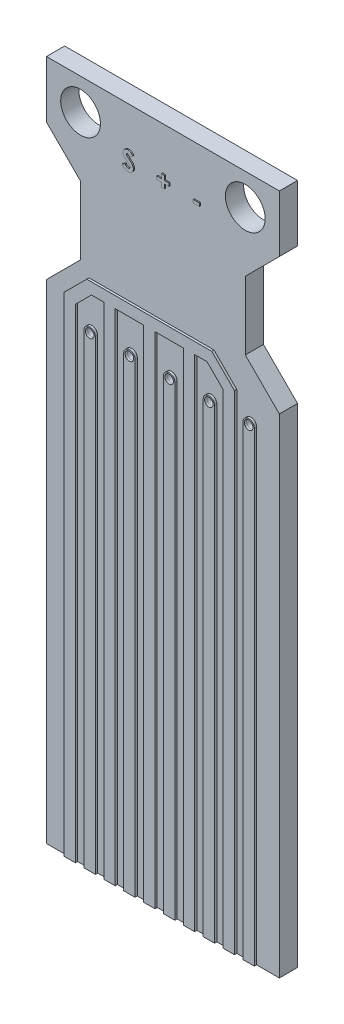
ISO-10303-21;
HEADER;
FILE_DESCRIPTION(('STEP AP214'),'2;1');
FILE_NAME('part.step','',(''),(''),'','','');
FILE_SCHEMA(('AUTOMOTIVE_DESIGN { 1 0 10303 214 1 1 1 1 }'));
ENDSEC;
DATA;
#1=APPLICATION_CONTEXT('core data for automotive mechanical design processes');
#2=APPLICATION_PROTOCOL_DEFINITION('international standard','automotive_design',2000,#1);
#3=PRODUCT_CONTEXT('',#1,'mechanical');
#4=PRODUCT('Part','Part','',(#3));
#5=PRODUCT_RELATED_PRODUCT_CATEGORY('part','',(#4));
#6=PRODUCT_DEFINITION_FORMATION('','',#4);
#7=PRODUCT_DEFINITION_CONTEXT('part definition',#1,'design');
#8=PRODUCT_DEFINITION('design','',#6,#7);
#9=PRODUCT_DEFINITION_SHAPE('','',#8);
#10=(LENGTH_UNIT() NAMED_UNIT(*) SI_UNIT(.MILLI.,.METRE.));
#11=(NAMED_UNIT(*) PLANE_ANGLE_UNIT() SI_UNIT($,.RADIAN.));
#12=(NAMED_UNIT(*) SI_UNIT($,.STERADIAN.) SOLID_ANGLE_UNIT());
#13=UNCERTAINTY_MEASURE_WITH_UNIT(LENGTH_MEASURE(1.E-05),#10,'distance_accuracy_value','');
#14=(GEOMETRIC_REPRESENTATION_CONTEXT(3) GLOBAL_UNCERTAINTY_ASSIGNED_CONTEXT((#13)) GLOBAL_UNIT_ASSIGNED_CONTEXT((#10,
#11,#12)) REPRESENTATION_CONTEXT('',''));
#15=CARTESIAN_POINT('',(0.,0.,0.));
#16=DIRECTION('',(0.,0.,1.));
#17=DIRECTION('',(1.,0.,0.));
#18=AXIS2_PLACEMENT_3D('',#15,#16,#17);
#19=CARTESIAN_POINT('',(0.,60.,1.6));
#20=DIRECTION('',(0.,0.,-1.));
#21=DIRECTION('',(-1.,0.,0.));
#22=AXIS2_PLACEMENT_3D('',#19,#20,#21);
#23=PLANE('',#22);
#24=DIRECTION('',(0.,1.,0.));
#25=VECTOR('',#24,1.);
#26=CARTESIAN_POINT('',(6.25,0.,1.6));
#27=LINE('',#26,#25);
#28=CARTESIAN_POINT('',(6.25,0.,1.6));
#29=VERTEX_POINT('',#28);
#30=CARTESIAN_POINT('',(6.25,44.,1.6));
#31=VERTEX_POINT('',#30);
#32=EDGE_CURVE('E1756',#29,#31,#27,.T.);
#33=ORIENTED_EDGE('',*,*,#32,.F.);
#34=DIRECTION('',(1.,0.,0.));
#35=VECTOR('',#34,1.);
#36=CARTESIAN_POINT('',(0.,0.,1.6));
#37=LINE('',#36,#35);
#38=CARTESIAN_POINT('',(7.00000000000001,0.,1.6));
#39=VERTEX_POINT('',#38);
#40=EDGE_CURVE('E1207',#29,#39,#37,.T.);
#41=ORIENTED_EDGE('',*,*,#40,.T.);
#42=DIRECTION('',(0.,-1.,0.));
#43=VECTOR('',#42,1.);
#44=CARTESIAN_POINT('',(7.,41.,1.6));
#45=LINE('',#44,#43);
#46=CARTESIAN_POINT('',(7.,41.,1.6));
#47=VERTEX_POINT('',#46);
#48=EDGE_CURVE('E1341',#47,#39,#45,.T.);
#49=ORIENTED_EDGE('',*,*,#48,.F.);
#50=CARTESIAN_POINT('',(7.5,41.,1.6));
#51=DIRECTION('',(0.,0.,1.));
#52=DIRECTION('',(-1.,0.,0.));
#53=AXIS2_PLACEMENT_3D('',#50,#51,#52);
#54=CIRCLE('',#53,0.5);
#55=CARTESIAN_POINT('',(8.,41.,1.6));
#56=VERTEX_POINT('',#55);
#57=EDGE_CURVE('E1338',#56,#47,#54,.T.);
#58=ORIENTED_EDGE('',*,*,#57,.F.);
#59=DIRECTION('',(0.,1.,0.));
#60=VECTOR('',#59,1.);
#61=CARTESIAN_POINT('',(8.,41.,1.6));
#62=LINE('',#61,#60);
#63=CARTESIAN_POINT('',(8.00000000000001,0.,1.6));
#64=VERTEX_POINT('',#63);
#65=EDGE_CURVE('E1343',#64,#56,#62,.T.);
#66=ORIENTED_EDGE('',*,*,#65,.F.);
#67=CARTESIAN_POINT('',(8.75,0.,1.6));
#68=VERTEX_POINT('',#67);
#69=EDGE_CURVE('E1189',#64,#68,#37,.T.);
#70=ORIENTED_EDGE('',*,*,#69,.T.);
#71=DIRECTION('',(0.,-1.,0.));
#72=VECTOR('',#71,1.);
#73=CARTESIAN_POINT('',(8.75,0.,1.6));
#74=LINE('',#73,#72);
#75=CARTESIAN_POINT('',(8.75,44.,1.6));
#76=VERTEX_POINT('',#75);
#77=EDGE_CURVE('E1764',#76,#68,#74,.T.);
#78=ORIENTED_EDGE('',*,*,#77,.F.);
#79=DIRECTION('',(1.,0.,0.));
#80=VECTOR('',#79,1.);
#81=CARTESIAN_POINT('',(8.75,44.,1.6));
#82=LINE('',#81,#80);
#83=EDGE_CURVE('E1759',#31,#76,#82,.T.);
#84=ORIENTED_EDGE('',*,*,#83,.F.);
#85=EDGE_LOOP('',(#33,#41,#49,#58,#66,#70,#78,#84));
#86=FACE_BOUND('',#85,.T.);
#87=ADVANCED_FACE('F27',(#86),#23,.F.);
#88=DIRECTION('',(0.,1.,0.));
#89=VECTOR('',#88,1.);
#90=CARTESIAN_POINT('',(9.75,0.,1.6));
#91=LINE('',#90,#89);
#92=CARTESIAN_POINT('',(9.75,0.,1.6));
#93=VERTEX_POINT('',#92);
#94=CARTESIAN_POINT('',(9.75,44.,1.6));
#95=VERTEX_POINT('',#94);
#96=EDGE_CURVE('E1723',#93,#95,#91,.T.);
#97=ORIENTED_EDGE('',*,*,#96,.F.);
#98=CARTESIAN_POINT('',(10.5,0.,1.6));
#99=VERTEX_POINT('',#98);
#100=EDGE_CURVE('E1206',#93,#99,#37,.T.);
#101=ORIENTED_EDGE('',*,*,#100,.T.);
#102=DIRECTION('',(0.,-1.,0.));
#103=VECTOR('',#102,1.);
#104=CARTESIAN_POINT('',(10.5,41.,1.6));
#105=LINE('',#104,#103);
#106=CARTESIAN_POINT('',(10.5,41.,1.6));
#107=VERTEX_POINT('',#106);
#108=EDGE_CURVE('E1303',#107,#99,#105,.T.);
#109=ORIENTED_EDGE('',*,*,#108,.F.);
#110=CARTESIAN_POINT('',(11.,41.,1.6));
#111=DIRECTION('',(0.,0.,1.));
#112=DIRECTION('',(-1.,0.,0.));
#113=AXIS2_PLACEMENT_3D('',#110,#111,#112);
#114=CIRCLE('',#113,0.5);
#115=CARTESIAN_POINT('',(11.5,41.,1.6));
#116=VERTEX_POINT('',#115);
#117=EDGE_CURVE('E1300',#116,#107,#114,.T.);
#118=ORIENTED_EDGE('',*,*,#117,.F.);
#119=DIRECTION('',(0.,1.,0.));
#120=VECTOR('',#119,1.);
#121=CARTESIAN_POINT('',(11.5,41.,1.6));
#122=LINE('',#121,#120);
#123=CARTESIAN_POINT('',(11.5,0.,1.6));
#124=VERTEX_POINT('',#123);
#125=EDGE_CURVE('E1305',#124,#116,#122,.T.);
#126=ORIENTED_EDGE('',*,*,#125,.F.);
#127=CARTESIAN_POINT('',(12.25,0.,1.6));
#128=VERTEX_POINT('',#127);
#129=EDGE_CURVE('E1193',#124,#128,#37,.T.);
#130=ORIENTED_EDGE('',*,*,#129,.T.);
#131=DIRECTION('',(0.,-1.,0.));
#132=VECTOR('',#131,1.);
#133=CARTESIAN_POINT('',(12.25,0.,1.6));
#134=LINE('',#133,#132);
#135=CARTESIAN_POINT('',(12.25,44.,1.6));
#136=VERTEX_POINT('',#135);
#137=EDGE_CURVE('E1716',#136,#128,#134,.T.);
#138=ORIENTED_EDGE('',*,*,#137,.F.);
#139=DIRECTION('',(1.,0.,0.));
#140=VECTOR('',#139,1.);
#141=CARTESIAN_POINT('',(12.25,44.,1.6));
#142=LINE('',#141,#140);
#143=EDGE_CURVE('E1719',#95,#136,#142,.T.);
#144=ORIENTED_EDGE('',*,*,#143,.F.);
#145=EDGE_LOOP('',(#97,#101,#109,#118,#126,#130,#138,#144));
#146=FACE_BOUND('',#145,.T.);
#147=ADVANCED_FACE('F1083',(#146),#23,.F.);
#148=DIRECTION('',(0.,1.,0.));
#149=VECTOR('',#148,1.);
#150=CARTESIAN_POINT('',(13.25,0.,1.6));
#151=LINE('',#150,#149);
#152=CARTESIAN_POINT('',(13.25,0.,1.6));
#153=VERTEX_POINT('',#152);
#154=CARTESIAN_POINT('',(13.25,44.,1.6));
#155=VERTEX_POINT('',#154);
#156=EDGE_CURVE('E1710',#153,#155,#151,.T.);
#157=ORIENTED_EDGE('',*,*,#156,.F.);
#158=CARTESIAN_POINT('',(14.,0.,1.6));
#159=VERTEX_POINT('',#158);
#160=EDGE_CURVE('E1204',#153,#159,#37,.T.);
#161=ORIENTED_EDGE('',*,*,#160,.T.);
#162=DIRECTION('',(0.,-1.,0.));
#163=VECTOR('',#162,1.);
#164=CARTESIAN_POINT('',(14.,41.,1.6));
#165=LINE('',#164,#163);
#166=CARTESIAN_POINT('',(14.,41.,1.6));
#167=VERTEX_POINT('',#166);
#168=EDGE_CURVE('E1265',#167,#159,#165,.T.);
#169=ORIENTED_EDGE('',*,*,#168,.F.);
#170=CARTESIAN_POINT('',(14.5,41.,1.6));
#171=DIRECTION('',(0.,0.,1.));
#172=DIRECTION('',(-1.,0.,0.));
#173=AXIS2_PLACEMENT_3D('',#170,#171,#172);
#174=CIRCLE('',#173,0.5);
#175=CARTESIAN_POINT('',(15.,41.,1.6));
#176=VERTEX_POINT('',#175);
#177=EDGE_CURVE('E1262',#176,#167,#174,.T.);
#178=ORIENTED_EDGE('',*,*,#177,.F.);
#179=DIRECTION('',(0.,1.,0.));
#180=VECTOR('',#179,1.);
#181=CARTESIAN_POINT('',(15.,41.,1.6));
#182=LINE('',#181,#180);
#183=CARTESIAN_POINT('',(15.,0.,1.6));
#184=VERTEX_POINT('',#183);
#185=EDGE_CURVE('E1267',#184,#176,#182,.T.);
#186=ORIENTED_EDGE('',*,*,#185,.F.);
#187=CARTESIAN_POINT('',(15.75,0.,1.6));
#188=VERTEX_POINT('',#187);
#189=EDGE_CURVE('E1196',#184,#188,#37,.T.);
#190=ORIENTED_EDGE('',*,*,#189,.T.);
#191=DIRECTION('',(0.,-1.,0.));
#192=VECTOR('',#191,1.);
#193=CARTESIAN_POINT('',(15.75,0.,1.6));
#194=LINE('',#193,#192);
#195=CARTESIAN_POINT('',(15.75,42.5857863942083,1.6));
#196=VERTEX_POINT('',#195);
#197=EDGE_CURVE('E1610',#196,#188,#194,.T.);
#198=ORIENTED_EDGE('',*,*,#197,.F.);
#199=DIRECTION('',(0.707106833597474,-0.707106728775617,0.));
#200=VECTOR('',#199,1.);
#201=CARTESIAN_POINT('',(15.75,42.5857863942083,1.6));
#202=LINE('',#201,#200);
#203=CARTESIAN_POINT('',(14.3357861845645,44.,1.6));
#204=VERTEX_POINT('',#203);
#205=EDGE_CURVE('E1729',#204,#196,#202,.T.);
#206=ORIENTED_EDGE('',*,*,#205,.F.);
#207=DIRECTION('',(1.,0.,0.));
#208=VECTOR('',#207,1.);
#209=CARTESIAN_POINT('',(14.3357861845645,44.,1.6));
#210=LINE('',#209,#208);
#211=EDGE_CURVE('E1721',#155,#204,#210,.T.);
#212=ORIENTED_EDGE('',*,*,#211,.F.);
#213=EDGE_LOOP('',(#157,#161,#169,#178,#186,#190,#198,#206,#212));
#214=FACE_BOUND('',#213,.T.);
#215=ADVANCED_FACE('F1699',(#214),#23,.F.);
#216=DIRECTION('',(-1.,0.,0.));
#217=VECTOR('',#216,1.);
#218=CARTESIAN_POINT('',(13.5641644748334,55.3895121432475,1.6));
#219=LINE('',#218,#217);
#220=CARTESIAN_POINT('',(13.5641644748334,55.3895121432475,1.6));
#221=VERTEX_POINT('',#220);
#222=CARTESIAN_POINT('',(13.0146452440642,55.3895121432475,1.6));
#223=VERTEX_POINT('',#222);
#224=EDGE_CURVE('E597',#221,#223,#219,.T.);
#225=ORIENTED_EDGE('',*,*,#224,.T.);
#226=DIRECTION('',(0.,1.,0.));
#227=VECTOR('',#226,1.);
#228=CARTESIAN_POINT('',(13.0146452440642,55.3895121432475,1.6));
#229=LINE('',#228,#227);
#230=CARTESIAN_POINT('',(13.0146452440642,55.6540954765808,1.6));
#231=VERTEX_POINT('',#230);
#232=EDGE_CURVE('E579',#223,#231,#229,.T.);
#233=ORIENTED_EDGE('',*,*,#232,.T.);
#234=DIRECTION('',(1.,0.,0.));
#235=VECTOR('',#234,1.);
#236=CARTESIAN_POINT('',(13.0146452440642,55.6540954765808,1.6));
#237=LINE('',#236,#235);
#238=CARTESIAN_POINT('',(13.5641644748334,55.6540954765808,1.6));
#239=VERTEX_POINT('',#238);
#240=EDGE_CURVE('E590',#231,#239,#237,.T.);
#241=ORIENTED_EDGE('',*,*,#240,.T.);
#242=DIRECTION('',(0.,-1.,0.));
#243=VECTOR('',#242,1.);
#244=CARTESIAN_POINT('',(13.5641644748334,55.6540954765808,1.6));
#245=LINE('',#244,#243);
#246=EDGE_CURVE('E45',#239,#221,#245,.T.);
#247=ORIENTED_EDGE('',*,*,#246,.T.);
#248=EDGE_LOOP('',(#225,#233,#241,#247));
#249=FACE_BOUND('',#248,.T.);
#250=DIRECTION('',(0.,1.,0.));
#251=VECTOR('',#250,1.);
#252=CARTESIAN_POINT('',(9.79894011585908,55.5726852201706,1.6));
#253=LINE('',#252,#251);
#254=CARTESIAN_POINT('',(9.79894011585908,55.5726852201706,1.6));
#255=VERTEX_POINT('',#254);
#256=CARTESIAN_POINT('',(9.79894011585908,55.8372685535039,1.6));
#257=VERTEX_POINT('',#256);
#258=EDGE_CURVE('E646',#255,#257,#253,.T.);
#259=ORIENTED_EDGE('',*,*,#258,.T.);
#260=DIRECTION('',(1.,0.,0.));
#261=VECTOR('',#260,1.);
#262=CARTESIAN_POINT('',(9.79894011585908,55.8372685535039,1.6));
#263=LINE('',#262,#261);
#264=CARTESIAN_POINT('',(10.2059913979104,55.8372685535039,1.6));
#265=VERTEX_POINT('',#264);
#266=EDGE_CURVE('E612',#257,#265,#263,.T.);
#267=ORIENTED_EDGE('',*,*,#266,.T.);
#268=DIRECTION('',(0.,1.,0.));
#269=VECTOR('',#268,1.);
#270=CARTESIAN_POINT('',(10.2059913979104,55.8372685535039,1.6));
#271=LINE('',#270,#269);
#272=CARTESIAN_POINT('',(10.2059913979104,56.2239672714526,1.6));
#273=VERTEX_POINT('',#272);
#274=EDGE_CURVE('E618',#265,#273,#271,.T.);
#275=ORIENTED_EDGE('',*,*,#274,.T.);
#276=DIRECTION('',(1.,0.,0.));
#277=VECTOR('',#276,1.);
#278=CARTESIAN_POINT('',(10.2059913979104,56.2239672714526,1.6));
#279=LINE('',#278,#277);
#280=CARTESIAN_POINT('',(10.4705747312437,56.2239672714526,1.6));
#281=VERTEX_POINT('',#280);
#282=EDGE_CURVE('E53',#273,#281,#279,.T.);
#283=ORIENTED_EDGE('',*,*,#282,.T.);
#284=DIRECTION('',(0.,-1.,0.));
#285=VECTOR('',#284,1.);
#286=CARTESIAN_POINT('',(10.4705747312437,56.2239672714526,1.6));
#287=LINE('',#286,#285);
#288=CARTESIAN_POINT('',(10.4705747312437,55.8372685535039,1.6));
#289=VERTEX_POINT('',#288);
#290=EDGE_CURVE('E622',#281,#289,#287,.T.);
#291=ORIENTED_EDGE('',*,*,#290,.T.);
#292=DIRECTION('',(1.,0.,0.));
#293=VECTOR('',#292,1.);
#294=CARTESIAN_POINT('',(10.4705747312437,55.8372685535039,1.6));
#295=LINE('',#294,#293);
#296=CARTESIAN_POINT('',(10.877626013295,55.8372685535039,1.6));
#297=VERTEX_POINT('',#296);
#298=EDGE_CURVE('E625',#289,#297,#295,.T.);
#299=ORIENTED_EDGE('',*,*,#298,.T.);
#300=DIRECTION('',(0.,-1.,0.));
#301=VECTOR('',#300,1.);
#302=CARTESIAN_POINT('',(10.877626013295,55.8372685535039,1.6));
#303=LINE('',#302,#301);
#304=CARTESIAN_POINT('',(10.877626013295,55.5726852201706,1.6));
#305=VERTEX_POINT('',#304);
#306=EDGE_CURVE('E628',#297,#305,#303,.T.);
#307=ORIENTED_EDGE('',*,*,#306,.T.);
#308=DIRECTION('',(-1.,0.,0.));
#309=VECTOR('',#308,1.);
#310=CARTESIAN_POINT('',(10.877626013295,55.5726852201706,1.6));
#311=LINE('',#310,#309);
#312=CARTESIAN_POINT('',(10.4705747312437,55.5726852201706,1.6));
#313=VERTEX_POINT('',#312);
#314=EDGE_CURVE('E631',#305,#313,#311,.T.);
#315=ORIENTED_EDGE('',*,*,#314,.T.);
#316=DIRECTION('',(0.,-1.,0.));
#317=VECTOR('',#316,1.);
#318=CARTESIAN_POINT('',(10.4705747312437,55.5726852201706,1.6));
#319=LINE('',#318,#317);
#320=CARTESIAN_POINT('',(10.4705747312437,55.1859865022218,1.6));
#321=VERTEX_POINT('',#320);
#322=EDGE_CURVE('E634',#313,#321,#319,.T.);
#323=ORIENTED_EDGE('',*,*,#322,.T.);
#324=DIRECTION('',(-1.,0.,0.));
#325=VECTOR('',#324,1.);
#326=CARTESIAN_POINT('',(10.4705747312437,55.1859865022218,1.6));
#327=LINE('',#326,#325);
#328=CARTESIAN_POINT('',(10.2059913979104,55.1859865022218,1.6));
#329=VERTEX_POINT('',#328);
#330=EDGE_CURVE('E637',#321,#329,#327,.T.);
#331=ORIENTED_EDGE('',*,*,#330,.T.);
#332=DIRECTION('',(0.,1.,0.));
#333=VECTOR('',#332,1.);
#334=CARTESIAN_POINT('',(10.2059913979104,55.1859865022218,1.6));
#335=LINE('',#334,#333);
#336=CARTESIAN_POINT('',(10.2059913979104,55.5726852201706,1.6));
#337=VERTEX_POINT('',#336);
#338=EDGE_CURVE('E640',#329,#337,#335,.T.);
#339=ORIENTED_EDGE('',*,*,#338,.T.);
#340=DIRECTION('',(-1.,0.,0.));
#341=VECTOR('',#340,1.);
#342=CARTESIAN_POINT('',(10.2059913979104,55.5726852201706,1.6));
#343=LINE('',#342,#341);
#344=EDGE_CURVE('E643',#337,#255,#343,.T.);
#345=ORIENTED_EDGE('',*,*,#344,.T.);
#346=EDGE_LOOP('',(#259,#267,#275,#283,#291,#299,#307,#315,#323,#331,#339,#345));
#347=FACE_BOUND('',#346,.T.);
#348=CARTESIAN_POINT('',(6.84781832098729,56.1673617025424,1.6));
#349=CARTESIAN_POINT('',(6.848162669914,56.1809530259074,1.6));
#350=CARTESIAN_POINT('',(6.84884107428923,56.2077293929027,1.6));
#351=CARTESIAN_POINT('',(6.8548925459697,56.2471001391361,1.6));
#352=CARTESIAN_POINT('',(6.86393670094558,56.2850896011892,1.6));
#353=CARTESIAN_POINT('',(6.8770714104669,56.3215591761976,1.6));
#354=CARTESIAN_POINT('',(6.89411867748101,56.3564631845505,1.6));
#355=CARTESIAN_POINT('',(6.91482192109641,56.3899724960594,1.6));
#356=CARTESIAN_POINT('',(6.93950262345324,56.4217786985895,1.6));
#357=CARTESIAN_POINT('',(6.96731610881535,56.4518607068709,1.6));
#358=CARTESIAN_POINT('',(6.99795944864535,56.4793522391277,1.6));
#359=CARTESIAN_POINT('',(7.03070575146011,56.5036162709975,1.6));
#360=CARTESIAN_POINT('',(7.06536967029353,56.5241100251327,1.6));
#361=CARTESIAN_POINT('',(7.10173914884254,56.5411110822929,1.6));
#362=CARTESIAN_POINT('',(7.14003955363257,56.554124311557,1.6));
#363=CARTESIAN_POINT('',(7.17998872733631,56.5633487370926,1.6));
#364=CARTESIAN_POINT('',(7.22164396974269,56.5688351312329,1.6));
#365=CARTESIAN_POINT('',(7.24997696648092,56.569580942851,1.6));
#366=CARTESIAN_POINT('',(7.26440986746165,56.5699608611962,1.6));
#367=B_SPLINE_CURVE_WITH_KNOTS('',3,(#348,#349,#350,#351,#352,#353,#354,#355,#356,#357,#358,
#359,#360,#361,#362,#363,#364,#365,#366),.UNSPECIFIED.,.F.,.F.,(4,1,1,1,1,1,1,1,1,1,1,1,1,1,1,1,
4),(0.,0.0631728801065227,0.124457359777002,0.184840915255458,0.244566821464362,
0.304319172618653,0.365199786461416,0.427420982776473,0.491261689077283,0.555499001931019,
0.618604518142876,0.680494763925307,0.742473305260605,0.804990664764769,0.868251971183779,
0.932887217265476,1.),.UNSPECIFIED.);
#368=CARTESIAN_POINT('',(6.84781832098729,56.1673617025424,1.6));
#369=VERTEX_POINT('',#368);
#370=CARTESIAN_POINT('',(7.26440986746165,56.5699608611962,1.6));
#371=VERTEX_POINT('',#370);
#372=EDGE_CURVE('E816',#369,#371,#367,.T.);
#373=ORIENTED_EDGE('',*,*,#372,.T.);
#374=CARTESIAN_POINT('',(7.26440986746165,56.5699608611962,1.6));
#375=CARTESIAN_POINT('',(7.28311419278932,56.5692766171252,1.6));
#376=CARTESIAN_POINT('',(7.32037519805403,56.5679135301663,1.6));
#377=CARTESIAN_POINT('',(7.37546666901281,56.5572546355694,1.6));
#378=CARTESIAN_POINT('',(7.42927771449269,56.5404924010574,1.6));
#379=CARTESIAN_POINT('',(7.47263966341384,56.5202706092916,1.6));
#380=CARTESIAN_POINT('',(7.50714195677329,56.5006817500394,1.6));
#381=CARTESIAN_POINT('',(7.53358474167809,56.4826467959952,1.6));
#382=CARTESIAN_POINT('',(7.5604916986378,56.4619867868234,1.6));
#383=CARTESIAN_POINT('',(7.58807981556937,56.438636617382,1.6));
#384=CARTESIAN_POINT('',(7.61583646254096,56.4121563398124,1.6));
#385=CARTESIAN_POINT('',(7.64455089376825,56.3831763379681,1.6));
#386=CARTESIAN_POINT('',(7.67383184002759,56.3514461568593,1.6));
#387=CARTESIAN_POINT('',(7.69285981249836,56.3287782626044,1.6));
#388=CARTESIAN_POINT('',(7.70262601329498,56.3171438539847,1.6));
#389=B_SPLINE_CURVE_WITH_KNOTS('',3,(#374,#375,#376,#377,#378,#379,#380,#381,#382,#383,#384,
#385,#386,#387,#388),.UNSPECIFIED.,.F.,.F.,(4,1,1,1,1,1,1,1,1,1,1,1,4),(0.,0.106910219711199,
0.212976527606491,0.319776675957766,0.428556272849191,0.485856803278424,0.54655868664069,
0.611431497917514,0.679820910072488,0.753158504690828,0.83075286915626,0.913133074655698,1.),.UNSPECIFIED.);
#390=CARTESIAN_POINT('',(7.70262601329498,56.3171438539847,1.6));
#391=VERTEX_POINT('',#390);
#392=EDGE_CURVE('E688',#371,#391,#389,.T.);
#393=ORIENTED_EDGE('',*,*,#392,.T.);
#394=DIRECTION('',(-0.737793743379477,-0.675026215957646,0.));
#395=VECTOR('',#394,1.);
#396=CARTESIAN_POINT('',(7.70262601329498,56.3171438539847,1.6));
#397=LINE('',#396,#395);
#398=CARTESIAN_POINT('',(7.48956010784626,56.1222044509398,1.6));
#399=VERTEX_POINT('',#398);
#400=EDGE_CURVE('E714',#391,#399,#397,.T.);
#401=ORIENTED_EDGE('',*,*,#400,.T.);
#402=CARTESIAN_POINT('',(7.48956010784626,56.1222044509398,1.6));
#403=CARTESIAN_POINT('',(7.48043327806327,56.1350787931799,1.6));
#404=CARTESIAN_POINT('',(7.46291103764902,56.1597957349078,1.6));
#405=CARTESIAN_POINT('',(7.43450931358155,56.1928923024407,1.6));
#406=CARTESIAN_POINT('',(7.40623583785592,56.221126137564,1.6));
#407=CARTESIAN_POINT('',(7.37782867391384,56.2443792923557,1.6));
#408=CARTESIAN_POINT('',(7.3490360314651,56.2625104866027,1.6));
#409=CARTESIAN_POINT('',(7.31990789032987,56.2753475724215,1.6));
#410=CARTESIAN_POINT('',(7.29060938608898,56.2835082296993,1.6));
#411=CARTESIAN_POINT('',(7.27092531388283,56.2845244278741,1.6));
#412=CARTESIAN_POINT('',(7.26122977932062,56.2850249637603,1.6));
#413=B_SPLINE_CURVE_WITH_KNOTS('',3,(#402,#403,#404,#405,#406,#407,#408,#409,#410,#411,#412),
.UNSPECIFIED.,.F.,.F.,(4,1,1,1,1,1,1,1,4),(0.,0.162420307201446,0.311824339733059,
0.448432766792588,0.573381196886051,0.689077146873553,0.797572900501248,0.900293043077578,1.),.UNSPECIFIED.);
#414=CARTESIAN_POINT('',(7.26122977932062,56.2850249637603,1.6));
#415=VERTEX_POINT('',#414);
#416=EDGE_CURVE('E720',#399,#415,#413,.T.);
#417=ORIENTED_EDGE('',*,*,#416,.T.);
#418=CARTESIAN_POINT('',(7.26122977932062,56.2850249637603,1.6));
#419=CARTESIAN_POINT('',(7.25218606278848,56.2847078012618,1.6));
#420=CARTESIAN_POINT('',(7.23472502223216,56.2840954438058,1.6));
#421=CARTESIAN_POINT('',(7.20983301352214,56.2780086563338,1.6));
#422=CARTESIAN_POINT('',(7.18773353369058,56.2675037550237,1.6));
#423=CARTESIAN_POINT('',(7.16844815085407,56.25376771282,1.6));
#424=CARTESIAN_POINT('',(7.15317128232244,56.2372189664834,1.6));
#425=CARTESIAN_POINT('',(7.14097388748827,56.2198635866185,1.6));
#426=CARTESIAN_POINT('',(7.13410572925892,56.2007071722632,1.6));
#427=CARTESIAN_POINT('',(7.13320174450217,56.1875497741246,1.6));
#428=CARTESIAN_POINT('',(7.13275421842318,56.1810360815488,1.6));
#429=B_SPLINE_CURVE_WITH_KNOTS('',3,(#418,#419,#420,#421,#422,#423,#424,#425,#426,#427,#428),
.UNSPECIFIED.,.F.,.F.,(4,1,1,1,1,1,1,1,4),(0.,0.148126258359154,0.285992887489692,
0.416634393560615,0.547379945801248,0.671582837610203,0.784400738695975,0.893265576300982,1.),.UNSPECIFIED.);
#430=CARTESIAN_POINT('',(7.13275421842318,56.1810360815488,1.6));
#431=VERTEX_POINT('',#430);
#432=EDGE_CURVE('E725',#415,#431,#429,.T.);
#433=ORIENTED_EDGE('',*,*,#432,.T.);
#434=CARTESIAN_POINT('',(7.13275421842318,56.1810360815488,1.6));
#435=CARTESIAN_POINT('',(7.1330346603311,56.1744284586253,1.6));
#436=CARTESIAN_POINT('',(7.13359943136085,56.1611216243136,1.6));
#437=CARTESIAN_POINT('',(7.13905435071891,56.1416188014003,1.6));
#438=CARTESIAN_POINT('',(7.14727647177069,56.122562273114,1.6));
#439=CARTESIAN_POINT('',(7.15513304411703,56.1109616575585,1.6));
#440=CARTESIAN_POINT('',(7.1591489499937,56.1050319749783,1.6));
#441=B_SPLINE_CURVE_WITH_KNOTS('',3,(#434,#435,#436,#437,#438,#439,#440),.UNSPECIFIED.,.F.,.F.,
(4,1,1,1,4),(0.,0.24188137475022,0.487115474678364,0.737837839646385,1.),.UNSPECIFIED.);
#442=CARTESIAN_POINT('',(7.1591489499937,56.1050319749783,1.6));
#443=VERTEX_POINT('',#442);
#444=EDGE_CURVE('E733',#431,#443,#441,.T.);
#445=ORIENTED_EDGE('',*,*,#444,.T.);
#446=CARTESIAN_POINT('',(7.1591489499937,56.1050319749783,1.6));
#447=CARTESIAN_POINT('',(7.16279984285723,56.1004228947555,1.6));
#448=CARTESIAN_POINT('',(7.1712037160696,56.0898134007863,1.6));
#449=CARTESIAN_POINT('',(7.1872281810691,56.0730096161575,1.6));
#450=CARTESIAN_POINT('',(7.20735154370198,56.0524235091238,1.6));
#451=CARTESIAN_POINT('',(7.23234819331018,56.0287629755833,1.6));
#452=CARTESIAN_POINT('',(7.26118045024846,56.0011770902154,1.6));
#453=CARTESIAN_POINT('',(7.29518472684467,55.9707502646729,1.6));
#454=CARTESIAN_POINT('',(7.33338223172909,55.9365402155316,1.6));
#455=CARTESIAN_POINT('',(7.36053213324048,55.9127175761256,1.6));
#456=CARTESIAN_POINT('',(7.37475892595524,55.9002342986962,1.6));
#457=B_SPLINE_CURVE_WITH_KNOTS('',3,(#446,#447,#448,#449,#450,#451,#452,#453,#454,#455,#456),
.UNSPECIFIED.,.F.,.F.,(4,1,1,1,1,1,1,1,4),(0.,0.0592341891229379,0.136349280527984,
0.233805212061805,0.349411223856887,0.483179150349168,0.635966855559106,0.809243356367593,1.),.UNSPECIFIED.);
#458=CARTESIAN_POINT('',(7.37475892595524,55.9002342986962,1.6));
#459=VERTEX_POINT('',#458);
#460=EDGE_CURVE('E741',#443,#459,#457,.T.);
#461=ORIENTED_EDGE('',*,*,#460,.T.);
#462=CARTESIAN_POINT('',(7.37475892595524,55.9002342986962,1.6));
#463=CARTESIAN_POINT('',(7.38811281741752,55.8886771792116,1.6));
#464=CARTESIAN_POINT('',(7.41345572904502,55.8667441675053,1.6));
#465=CARTESIAN_POINT('',(7.44951365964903,55.8356137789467,1.6));
#466=CARTESIAN_POINT('',(7.48120257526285,55.8076065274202,1.6));
#467=CARTESIAN_POINT('',(7.50898411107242,55.7831427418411,1.6));
#468=CARTESIAN_POINT('',(7.53243712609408,55.761965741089,1.6));
#469=CARTESIAN_POINT('',(7.55166021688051,55.7439742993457,1.6));
#470=CARTESIAN_POINT('',(7.56688816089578,55.7295186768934,1.6));
#471=CARTESIAN_POINT('',(7.57554435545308,55.7207874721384,1.6));
#472=CARTESIAN_POINT('',(7.57923859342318,55.7170612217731,1.6));
#473=B_SPLINE_CURVE_WITH_KNOTS('',3,(#462,#463,#464,#465,#466,#467,#468,#469,#470,#471,#472),
.UNSPECIFIED.,.F.,.F.,(4,1,1,1,1,1,1,1,4),(0.,0.192952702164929,0.366184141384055,
0.520457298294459,0.655012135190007,0.770624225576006,0.865677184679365,0.942674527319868,1.),.UNSPECIFIED.);
#474=CARTESIAN_POINT('',(7.57923859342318,55.7170612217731,1.6));
#475=VERTEX_POINT('',#474);
#476=EDGE_CURVE('E749',#459,#475,#473,.T.);
#477=ORIENTED_EDGE('',*,*,#476,.T.);
#478=CARTESIAN_POINT('',(7.57923859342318,55.7170612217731,1.6));
#479=CARTESIAN_POINT('',(7.59325376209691,55.7018938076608,1.6));
#480=CARTESIAN_POINT('',(7.62019583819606,55.672736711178,1.6));
#481=CARTESIAN_POINT('',(7.65521103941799,55.6275523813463,1.6));
#482=CARTESIAN_POINT('',(7.6840296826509,55.5834432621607,1.6));
#483=CARTESIAN_POINT('',(7.70632433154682,55.5395793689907,1.6));
#484=CARTESIAN_POINT('',(7.72316214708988,55.4953278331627,1.6));
#485=CARTESIAN_POINT('',(7.7350330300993,55.4496033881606,1.6));
#486=CARTESIAN_POINT('',(7.74214258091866,55.4019282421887,1.6));
#487=CARTESIAN_POINT('',(7.74293190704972,55.3693957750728,1.6));
#488=CARTESIAN_POINT('',(7.74333114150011,55.3529411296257,1.6));
#489=B_SPLINE_CURVE_WITH_KNOTS('',3,(#478,#479,#480,#481,#482,#483,#484,#485,#486,#487,#488),
.UNSPECIFIED.,.F.,.F.,(4,1,1,1,1,1,1,1,4),(0.,0.150833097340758,0.289954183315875,
0.417138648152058,0.535255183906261,0.648751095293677,0.762405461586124,0.879826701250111,1.),.UNSPECIFIED.);
#490=CARTESIAN_POINT('',(7.74333114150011,55.3529411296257,1.6));
#491=VERTEX_POINT('',#490);
#492=EDGE_CURVE('E757',#475,#491,#489,.T.);
#493=ORIENTED_EDGE('',*,*,#492,.T.);
#494=CARTESIAN_POINT('',(7.74333114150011,55.3529411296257,1.6));
#495=CARTESIAN_POINT('',(7.7430469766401,55.3369080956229,1.6));
#496=CARTESIAN_POINT('',(7.74248943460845,55.305450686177,1.6));
#497=CARTESIAN_POINT('',(7.73566061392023,55.2594174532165,1.6));
#498=CARTESIAN_POINT('',(7.72592311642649,55.2153616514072,1.6));
#499=CARTESIAN_POINT('',(7.71086723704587,55.1737626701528,1.6));
#500=CARTESIAN_POINT('',(7.69251722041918,55.1339376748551,1.6));
#501=CARTESIAN_POINT('',(7.66951282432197,55.0965070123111,1.6));
#502=CARTESIAN_POINT('',(7.64249731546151,55.0610918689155,1.6));
#503=CARTESIAN_POINT('',(7.61153339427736,55.0283253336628,1.6));
#504=CARTESIAN_POINT('',(7.57728362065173,54.998591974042,1.6));
#505=CARTESIAN_POINT('',(7.54054748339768,54.9721226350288,1.6));
#506=CARTESIAN_POINT('',(7.5009657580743,54.9502688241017,1.6));
#507=CARTESIAN_POINT('',(7.45887662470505,54.9322737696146,1.6));
#508=CARTESIAN_POINT('',(7.41430261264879,54.9184137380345,1.6));
#509=CARTESIAN_POINT('',(7.36729682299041,54.9081698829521,1.6));
#510=CARTESIAN_POINT('',(7.31778735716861,54.9020216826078,1.6));
#511=CARTESIAN_POINT('',(7.28393207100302,54.9013789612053,1.6));
#512=CARTESIAN_POINT('',(7.26663592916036,54.9010506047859,1.6));
#513=B_SPLINE_CURVE_WITH_KNOTS('',3,(#494,#495,#496,#497,#498,#499,#500,#501,#502,#503,#504,
#505,#506,#507,#508,#509,#510,#511,#512),.UNSPECIFIED.,.F.,.F.,(4,1,1,1,1,1,1,1,1,1,1,1,1,1,1,1,
4),(0.,0.0652008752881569,0.127926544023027,0.189046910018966,0.248543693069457,
0.307607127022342,0.367247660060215,0.426963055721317,0.48861712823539,0.550391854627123,
0.611330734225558,0.672556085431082,0.734024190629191,0.797340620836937,0.862249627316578,
0.929625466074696,1.),.UNSPECIFIED.);
#514=CARTESIAN_POINT('',(7.26663592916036,54.9010506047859,1.6));
#515=VERTEX_POINT('',#514);
#516=EDGE_CURVE('E765',#491,#515,#513,.T.);
#517=ORIENTED_EDGE('',*,*,#516,.T.);
#518=CARTESIAN_POINT('',(7.26663592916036,54.9010506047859,1.6));
#519=CARTESIAN_POINT('',(7.25305860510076,54.9012914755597,1.6));
#520=CARTESIAN_POINT('',(7.22616771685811,54.9017685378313,1.6));
#521=CARTESIAN_POINT('',(7.18653461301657,54.9056633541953,1.6));
#522=CARTESIAN_POINT('',(7.14826437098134,54.9119491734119,1.6));
#523=CARTESIAN_POINT('',(7.11140009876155,54.9209586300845,1.6));
#524=CARTESIAN_POINT('',(7.07577571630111,54.9323748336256,1.6));
#525=CARTESIAN_POINT('',(7.04138976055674,54.9463192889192,1.6));
#526=CARTESIAN_POINT('',(7.00847960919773,54.9630081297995,1.6));
#527=CARTESIAN_POINT('',(6.97679624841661,54.9820981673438,1.6));
#528=CARTESIAN_POINT('',(6.94649369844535,55.0042642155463,1.6));
#529=CARTESIAN_POINT('',(6.91718879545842,55.0290530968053,1.6));
#530=CARTESIAN_POINT('',(6.88917262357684,55.0568460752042,1.6));
#531=CARTESIAN_POINT('',(6.86231062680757,55.0875774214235,1.6));
#532=CARTESIAN_POINT('',(6.8367746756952,55.1213341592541,1.6));
#533=CARTESIAN_POINT('',(6.81172888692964,55.1576461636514,1.6));
#534=CARTESIAN_POINT('',(6.78828637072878,55.1971873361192,1.6));
#535=CARTESIAN_POINT('',(6.77380488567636,55.2249257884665,1.6));
#536=CARTESIAN_POINT('',(6.76640806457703,55.239093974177,1.6));
#537=B_SPLINE_CURVE_WITH_KNOTS('',3,(#518,#519,#520,#521,#522,#523,#524,#525,#526,#527,#528,
#529,#530,#531,#532,#533,#534,#535,#536),.UNSPECIFIED.,.F.,.F.,(4,1,1,1,1,1,1,1,1,1,1,1,1,1,1,1,
4),(0.,0.0635514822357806,0.125868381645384,0.186240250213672,0.244976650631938,
0.303357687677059,0.361230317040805,0.418489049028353,0.475936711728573,0.534203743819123,
0.594059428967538,0.655468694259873,0.718771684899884,0.784974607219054,0.853522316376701,
0.925182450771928,1.),.UNSPECIFIED.);
#538=CARTESIAN_POINT('',(6.76640806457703,55.239093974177,1.6));
#539=VERTEX_POINT('',#538);
#540=EDGE_CURVE('E773',#515,#539,#537,.T.);
#541=ORIENTED_EDGE('',*,*,#540,.T.);
#542=DIRECTION('',(0.857396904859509,0.514655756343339,0.));
#543=VECTOR('',#542,1.);
#544=CARTESIAN_POINT('',(6.76640806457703,55.239093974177,1.6));
#545=LINE('',#544,#543);
#546=CARTESIAN_POINT('',(7.01699901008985,55.3895121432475,1.6));
#547=VERTEX_POINT('',#546);
#548=EDGE_CURVE('E781',#539,#547,#545,.T.);
#549=ORIENTED_EDGE('',*,*,#548,.T.);
#550=CARTESIAN_POINT('',(7.01699901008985,55.3895121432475,1.6));
#551=CARTESIAN_POINT('',(7.02625132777,55.3734294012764,1.6));
#552=CARTESIAN_POINT('',(7.04398881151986,55.3425974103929,1.6));
#553=CARTESIAN_POINT('',(7.07404663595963,55.3011707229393,1.6));
#554=CARTESIAN_POINT('',(7.10483934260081,55.2656956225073,1.6));
#555=CARTESIAN_POINT('',(7.13707883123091,55.2367991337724,1.6));
#556=CARTESIAN_POINT('',(7.17037308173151,55.2140948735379,1.6));
#557=CARTESIAN_POINT('',(7.20488291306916,55.1978688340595,1.6));
#558=CARTESIAN_POINT('',(7.24063257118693,55.1878249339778,1.6));
#559=CARTESIAN_POINT('',(7.26498361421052,55.1865983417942,1.6));
#560=CARTESIAN_POINT('',(7.27713022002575,55.1859865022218,1.6));
#561=B_SPLINE_CURVE_WITH_KNOTS('',3,(#550,#551,#552,#553,#554,#555,#556,#557,#558,#559,#560),
.UNSPECIFIED.,.F.,.F.,(4,1,1,1,1,1,1,1,4),(0.,0.160457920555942,0.307611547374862,
0.442138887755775,0.566229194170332,0.681222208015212,0.789558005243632,0.895028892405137,1.),.UNSPECIFIED.);
#562=CARTESIAN_POINT('',(7.27713022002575,55.1859865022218,1.6));
#563=VERTEX_POINT('',#562);
#564=EDGE_CURVE('E787',#547,#563,#561,.T.);
#565=ORIENTED_EDGE('',*,*,#564,.T.);
#566=CARTESIAN_POINT('',(7.27713022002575,55.1859865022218,1.6));
#567=CARTESIAN_POINT('',(7.28948505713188,55.1864861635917,1.6));
#568=CARTESIAN_POINT('',(7.31345524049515,55.1874555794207,1.6));
#569=CARTESIAN_POINT('',(7.34766960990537,55.1964097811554,1.6));
#570=CARTESIAN_POINT('',(7.37903863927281,55.2104685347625,1.6));
#571=CARTESIAN_POINT('',(7.40615379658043,55.2305284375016,1.6));
#572=CARTESIAN_POINT('',(7.42911320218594,55.2536806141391,1.6));
#573=CARTESIAN_POINT('',(7.44605856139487,55.2794384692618,1.6));
#574=CARTESIAN_POINT('',(7.45670375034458,55.3073078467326,1.6));
#575=CARTESIAN_POINT('',(7.45782920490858,55.3266677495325,1.6));
#576=CARTESIAN_POINT('',(7.45839524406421,55.3364046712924,1.6));
#577=B_SPLINE_CURVE_WITH_KNOTS('',3,(#566,#567,#568,#569,#570,#571,#572,#573,#574,#575,#576),
.UNSPECIFIED.,.F.,.F.,(4,1,1,1,1,1,1,1,4),(0.,0.141985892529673,0.275473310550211,
0.404345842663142,0.535429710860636,0.661427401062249,0.777866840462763,0.888279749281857,1.),.UNSPECIFIED.);
#578=CARTESIAN_POINT('',(7.45839524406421,55.3364046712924,1.6));
#579=VERTEX_POINT('',#578);
#580=EDGE_CURVE('E792',#563,#579,#577,.T.);
#581=ORIENTED_EDGE('',*,*,#580,.T.);
#582=CARTESIAN_POINT('',(7.45839524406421,55.3364046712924,1.6));
#583=CARTESIAN_POINT('',(7.45787253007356,55.3454632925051,1.6));
#584=CARTESIAN_POINT('',(7.45681068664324,55.3638650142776,1.6));
#585=CARTESIAN_POINT('',(7.44898947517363,55.3912254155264,1.6));
#586=CARTESIAN_POINT('',(7.43676253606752,55.418573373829,1.6));
#587=CARTESIAN_POINT('',(7.42229720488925,55.4410049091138,1.6));
#588=CARTESIAN_POINT('',(7.40757691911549,55.459786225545,1.6));
#589=CARTESIAN_POINT('',(7.39350100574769,55.4760593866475,1.6));
#590=CARTESIAN_POINT('',(7.37636026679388,55.4940383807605,1.6));
#591=CARTESIAN_POINT('',(7.35619816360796,55.513745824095,1.6));
#592=CARTESIAN_POINT('',(7.3332810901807,55.5353552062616,1.6));
#593=CARTESIAN_POINT('',(7.30758974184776,55.5588644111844,1.6));
#594=CARTESIAN_POINT('',(7.27882992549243,55.5840663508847,1.6));
#595=CARTESIAN_POINT('',(7.25850243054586,55.6012336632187,1.6));
#596=CARTESIAN_POINT('',(7.24787340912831,55.6102102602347,1.6));
#597=B_SPLINE_CURVE_WITH_KNOTS('',3,(#582,#583,#584,#585,#586,#587,#588,#589,#590,#591,#592,
#593,#594,#595,#596),.UNSPECIFIED.,.F.,.F.,(4,1,1,1,1,1,1,1,1,1,1,1,4),(0.,0.0763466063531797,
0.155090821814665,0.238351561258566,0.328404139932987,0.379383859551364,0.43961764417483,
0.509831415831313,0.588874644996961,0.67743635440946,0.775546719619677,0.882635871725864,1.),.UNSPECIFIED.);
#598=CARTESIAN_POINT('',(7.24787340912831,55.6102102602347,1.6));
#599=VERTEX_POINT('',#598);
#600=EDGE_CURVE('E800',#579,#599,#597,.T.);
#601=ORIENTED_EDGE('',*,*,#600,.T.);
#602=CARTESIAN_POINT('',(7.24787340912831,55.6102102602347,1.6));
#603=CARTESIAN_POINT('',(7.22766721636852,55.6273066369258,1.6));
#604=CARTESIAN_POINT('',(7.18888541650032,55.6601197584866,1.6));
#605=CARTESIAN_POINT('',(7.13408181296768,55.7085837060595,1.6));
#606=CARTESIAN_POINT('',(7.08469885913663,55.7538777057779,1.6));
#607=CARTESIAN_POINT('',(7.04116307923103,55.7965616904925,1.6));
#608=CARTESIAN_POINT('',(7.00291976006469,55.8358473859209,1.6));
#609=CARTESIAN_POINT('',(6.97022790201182,55.8720538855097,1.6));
#610=CARTESIAN_POINT('',(6.94344663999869,55.9054604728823,1.6));
#611=CARTESIAN_POINT('',(6.91526513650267,55.9450283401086,1.6));
#612=CARTESIAN_POINT('',(6.88848707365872,55.9932445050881,1.6));
#613=CARTESIAN_POINT('',(6.86534322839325,56.0512541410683,1.6));
#614=CARTESIAN_POINT('',(6.8503284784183,56.1092564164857,1.6));
#615=CARTESIAN_POINT('',(6.84864628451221,56.1481959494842,1.6));
#616=CARTESIAN_POINT('',(6.84781832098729,56.1673617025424,1.6));
#617=B_SPLINE_CURVE_WITH_KNOTS('',3,(#602,#603,#604,#605,#606,#607,#608,#609,#610,#611,#612,
#613,#614,#615,#616),.UNSPECIFIED.,.F.,.F.,(4,1,1,1,1,1,1,1,1,1,1,1,4),(0.,0.112124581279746,
0.215201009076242,0.309902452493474,0.39595909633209,0.47344749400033,0.54214032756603,
0.602523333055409,0.654726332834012,0.747804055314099,0.835278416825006,0.918925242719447,1.),.UNSPECIFIED.);
#618=EDGE_CURVE('E808',#599,#369,#617,.T.);
#619=ORIENTED_EDGE('',*,*,#618,.T.);
#620=EDGE_LOOP('',(#373,#393,#401,#417,#433,#445,#461,#477,#493,#517,#541,#549,#565,#581,#601,#619));
#621=FACE_BOUND('',#620,.T.);
#622=CARTESIAN_POINT('',(3.,57.25,1.6));
#623=DIRECTION('',(0.,0.,1.));
#624=DIRECTION('',(-1.,0.,0.));
#625=AXIS2_PLACEMENT_3D('',#622,#623,#624);
#626=CIRCLE('',#625,1.75);
#627=CARTESIAN_POINT('',(1.25,57.25,1.6));
#628=VERTEX_POINT('',#627);
#629=EDGE_CURVE('E1435',#628,#628,#626,.T.);
#630=ORIENTED_EDGE('',*,*,#629,.F.);
#631=EDGE_LOOP('',(#630));
#632=FACE_BOUND('',#631,.T.);
#633=CARTESIAN_POINT('',(17.5,57.25,1.6));
#634=DIRECTION('',(0.,0.,1.));
#635=DIRECTION('',(1.,0.,0.));
#636=AXIS2_PLACEMENT_3D('',#633,#634,#635);
#637=CIRCLE('',#636,1.75);
#638=CARTESIAN_POINT('',(19.25,57.25,1.6));
#639=VERTEX_POINT('',#638);
#640=EDGE_CURVE('E1441',#639,#639,#637,.T.);
#641=ORIENTED_EDGE('',*,*,#640,.F.);
#642=EDGE_LOOP('',(#641));
#643=FACE_BOUND('',#642,.T.);
#644=DIRECTION('',(0.,1.,0.));
#645=VECTOR('',#644,1.);
#646=CARTESIAN_POINT('',(16.75,0.,1.6));
#647=LINE('',#646,#645);
#648=CARTESIAN_POINT('',(16.75,0.,1.6));
#649=VERTEX_POINT('',#648);
#650=CARTESIAN_POINT('',(16.75,43.,1.6));
#651=VERTEX_POINT('',#650);
#652=EDGE_CURVE('E1606',#649,#651,#647,.T.);
#653=ORIENTED_EDGE('',*,*,#652,.F.);
#654=CARTESIAN_POINT('',(17.5,0.,1.6));
#655=VERTEX_POINT('',#654);
#656=EDGE_CURVE('E1201',#649,#655,#37,.T.);
#657=ORIENTED_EDGE('',*,*,#656,.T.);
#658=DIRECTION('',(0.,-1.,0.));
#659=VECTOR('',#658,1.);
#660=CARTESIAN_POINT('',(17.5,41.,1.6));
#661=LINE('',#660,#659);
#662=CARTESIAN_POINT('',(17.5,41.,1.6));
#663=VERTEX_POINT('',#662);
#664=EDGE_CURVE('E1595',#663,#655,#661,.T.);
#665=ORIENTED_EDGE('',*,*,#664,.F.);
#666=CARTESIAN_POINT('',(18.,41.,1.6));
#667=DIRECTION('',(0.,0.,1.));
#668=DIRECTION('',(-1.,0.,0.));
#669=AXIS2_PLACEMENT_3D('',#666,#667,#668);
#670=CIRCLE('',#669,0.5);
#671=CARTESIAN_POINT('',(18.5,41.,1.6));
#672=VERTEX_POINT('',#671);
#673=EDGE_CURVE('E1592',#672,#663,#670,.T.);
#674=ORIENTED_EDGE('',*,*,#673,.F.);
#675=DIRECTION('',(0.,1.,0.));
#676=VECTOR('',#675,1.);
#677=CARTESIAN_POINT('',(18.5,41.,1.6));
#678=LINE('',#677,#676);
#679=CARTESIAN_POINT('',(18.5,0.,1.6));
#680=VERTEX_POINT('',#679);
#681=EDGE_CURVE('E1227',#680,#672,#678,.T.);
#682=ORIENTED_EDGE('',*,*,#681,.F.);
#683=CARTESIAN_POINT('',(20.5,0.,1.6));
#684=VERTEX_POINT('',#683);
#685=EDGE_CURVE('E1174',#680,#684,#37,.T.);
#686=ORIENTED_EDGE('',*,*,#685,.T.);
#687=DIRECTION('',(0.,1.,0.));
#688=VECTOR('',#687,1.);
#689=CARTESIAN_POINT('',(20.5,0.,1.6));
#690=LINE('',#689,#688);
#691=CARTESIAN_POINT('',(20.5,43.,1.6));
#692=VERTEX_POINT('',#691);
#693=EDGE_CURVE('E1145',#684,#692,#690,.T.);
#694=ORIENTED_EDGE('',*,*,#693,.T.);
#695=DIRECTION('',(-0.707106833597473,0.707106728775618,0.));
#696=VECTOR('',#695,1.);
#697=CARTESIAN_POINT('',(17.5,45.9999995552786,1.6));
#698=LINE('',#697,#696);
#699=CARTESIAN_POINT('',(17.5,45.9999995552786,1.6));
#700=VERTEX_POINT('',#699);
#701=EDGE_CURVE('E1483',#692,#700,#698,.T.);
#702=ORIENTED_EDGE('',*,*,#701,.T.);
#703=DIRECTION('',(0.,1.,0.));
#704=VECTOR('',#703,1.);
#705=CARTESIAN_POINT('',(17.5,51.9999995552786,1.6));
#706=LINE('',#705,#704);
#707=CARTESIAN_POINT('',(17.5,51.9999995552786,1.6));
#708=VERTEX_POINT('',#707);
#709=EDGE_CURVE('E1485',#700,#708,#706,.T.);
#710=ORIENTED_EDGE('',*,*,#709,.T.);
#711=DIRECTION('',(0.707106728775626,0.707106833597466,0.));
#712=VECTOR('',#711,1.);
#713=CARTESIAN_POINT('',(20.5,55.,1.6));
#714=LINE('',#713,#712);
#715=CARTESIAN_POINT('',(20.5,55.,1.6));
#716=VERTEX_POINT('',#715);
#717=EDGE_CURVE('E1486',#708,#716,#714,.T.);
#718=ORIENTED_EDGE('',*,*,#717,.T.);
#719=DIRECTION('',(0.,1.,0.));
#720=VECTOR('',#719,1.);
#721=CARTESIAN_POINT('',(20.5,55.,1.6));
#722=LINE('',#721,#720);
#723=CARTESIAN_POINT('',(20.5,60.,1.6));
#724=VERTEX_POINT('',#723);
#725=EDGE_CURVE('E1490',#716,#724,#722,.T.);
#726=ORIENTED_EDGE('',*,*,#725,.T.);
#727=DIRECTION('',(-1.,0.,0.));
#728=VECTOR('',#727,1.);
#729=CARTESIAN_POINT('',(0.,60.,1.6));
#730=LINE('',#729,#728);
#731=CARTESIAN_POINT('',(0.,60.,1.6));
#732=VERTEX_POINT('',#731);
#733=EDGE_CURVE('E1492',#724,#732,#730,.T.);
#734=ORIENTED_EDGE('',*,*,#733,.T.);
#735=DIRECTION('',(0.,-1.,0.));
#736=VECTOR('',#735,1.);
#737=CARTESIAN_POINT('',(0.,55.,1.6));
#738=LINE('',#737,#736);
#739=CARTESIAN_POINT('',(0.,55.,1.6));
#740=VERTEX_POINT('',#739);
#741=EDGE_CURVE('E1494',#732,#740,#738,.T.);
#742=ORIENTED_EDGE('',*,*,#741,.T.);
#743=DIRECTION('',(0.707106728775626,-0.707106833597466,0.));
#744=VECTOR('',#743,1.);
#745=CARTESIAN_POINT('',(0.,55.,1.6));
#746=LINE('',#745,#744);
#747=CARTESIAN_POINT('',(2.99999999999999,51.9999995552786,1.6));
#748=VERTEX_POINT('',#747);
#749=EDGE_CURVE('E1496',#740,#748,#746,.T.);
#750=ORIENTED_EDGE('',*,*,#749,.T.);
#751=DIRECTION('',(0.,-1.,0.));
#752=VECTOR('',#751,1.);
#753=CARTESIAN_POINT('',(2.99999999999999,51.9999995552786,1.6));
#754=LINE('',#753,#752);
#755=CARTESIAN_POINT('',(2.99999999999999,45.9999995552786,1.6));
#756=VERTEX_POINT('',#755);
#757=EDGE_CURVE('E1498',#748,#756,#754,.T.);
#758=ORIENTED_EDGE('',*,*,#757,.T.);
#759=DIRECTION('',(-0.707106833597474,-0.707106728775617,0.));
#760=VECTOR('',#759,1.);
#761=CARTESIAN_POINT('',(2.99999999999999,45.9999995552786,1.6));
#762=LINE('',#761,#760);
#763=CARTESIAN_POINT('',(0.,43.,1.6));
#764=VERTEX_POINT('',#763);
#765=EDGE_CURVE('E1454',#756,#764,#762,.T.);
#766=ORIENTED_EDGE('',*,*,#765,.T.);
#767=DIRECTION('',(0.,-1.,0.));
#768=VECTOR('',#767,1.);
#769=CARTESIAN_POINT('',(0.,0.,1.6));
#770=LINE('',#769,#768);
#771=CARTESIAN_POINT('',(0.,0.,1.6));
#772=VERTEX_POINT('',#771);
#773=EDGE_CURVE('E1172',#764,#772,#770,.T.);
#774=ORIENTED_EDGE('',*,*,#773,.T.);
#775=CARTESIAN_POINT('',(1.75,0.,1.6));
#776=VERTEX_POINT('',#775);
#777=EDGE_CURVE('E1186',#772,#776,#37,.T.);
#778=ORIENTED_EDGE('',*,*,#777,.T.);
#779=DIRECTION('',(0.,-1.,0.));
#780=VECTOR('',#779,1.);
#781=CARTESIAN_POINT('',(1.75,0.,1.6));
#782=LINE('',#781,#780);
#783=CARTESIAN_POINT('',(1.75,43.,1.6));
#784=VERTEX_POINT('',#783);
#785=EDGE_CURVE('E1515',#784,#776,#782,.T.);
#786=ORIENTED_EDGE('',*,*,#785,.F.);
#787=DIRECTION('',(-0.707106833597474,-0.707106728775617,0.));
#788=VECTOR('',#787,1.);
#789=CARTESIAN_POINT('',(3.75000029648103,45.,1.6));
#790=LINE('',#789,#788);
#791=CARTESIAN_POINT('',(3.75000029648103,45.,1.6));
#792=VERTEX_POINT('',#791);
#793=EDGE_CURVE('E1526',#792,#784,#790,.T.);
#794=ORIENTED_EDGE('',*,*,#793,.F.);
#795=DIRECTION('',(-1.,0.,0.));
#796=VECTOR('',#795,1.);
#797=CARTESIAN_POINT('',(3.75000029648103,45.,1.6));
#798=LINE('',#797,#796);
#799=CARTESIAN_POINT('',(14.749999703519,45.,1.6));
#800=VERTEX_POINT('',#799);
#801=EDGE_CURVE('E1734',#800,#792,#798,.T.);
#802=ORIENTED_EDGE('',*,*,#801,.F.);
#803=DIRECTION('',(-0.707106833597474,0.707106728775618,0.));
#804=VECTOR('',#803,1.);
#805=CARTESIAN_POINT('',(14.749999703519,45.,1.6));
#806=LINE('',#805,#804);
#807=EDGE_CURVE('E1608',#651,#800,#806,.T.);
#808=ORIENTED_EDGE('',*,*,#807,.F.);
#809=EDGE_LOOP('',(#653,#657,#665,#674,#682,#686,#694,#702,#710,#718,#726,#734,#742,#750,#758,
#766,#774,#778,#786,#794,#802,#808));
#810=FACE_BOUND('',#809,.T.);
#811=ADVANCED_FACE('F594',(#249,#347,#621,#632,#643,#810),#23,.F.);
#812=DIRECTION('',(0.,1.,0.));
#813=VECTOR('',#812,1.);
#814=CARTESIAN_POINT('',(2.75,0.,1.6));
#815=LINE('',#814,#813);
#816=CARTESIAN_POINT('',(2.75,0.,1.6));
#817=VERTEX_POINT('',#816);
#818=CARTESIAN_POINT('',(2.75,42.5857863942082,1.6));
#819=VERTEX_POINT('',#818);
#820=EDGE_CURVE('E1525',#817,#819,#815,.T.);
#821=ORIENTED_EDGE('',*,*,#820,.F.);
#822=CARTESIAN_POINT('',(3.50000000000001,0.,1.6));
#823=VERTEX_POINT('',#822);
#824=EDGE_CURVE('E31',#817,#823,#37,.T.);
#825=ORIENTED_EDGE('',*,*,#824,.T.);
#826=DIRECTION('',(0.,-1.,0.));
#827=VECTOR('',#826,1.);
#828=CARTESIAN_POINT('',(3.5,41.,1.6));
#829=LINE('',#828,#827);
#830=CARTESIAN_POINT('',(3.5,41.,1.6));
#831=VERTEX_POINT('',#830);
#832=EDGE_CURVE('E1379',#831,#823,#829,.T.);
#833=ORIENTED_EDGE('',*,*,#832,.F.);
#834=CARTESIAN_POINT('',(4.,41.,1.6));
#835=DIRECTION('',(0.,0.,1.));
#836=DIRECTION('',(-1.,0.,0.));
#837=AXIS2_PLACEMENT_3D('',#834,#835,#836);
#838=CIRCLE('',#837,0.5);
#839=CARTESIAN_POINT('',(4.5,41.,1.6));
#840=VERTEX_POINT('',#839);
#841=EDGE_CURVE('E1376',#840,#831,#838,.T.);
#842=ORIENTED_EDGE('',*,*,#841,.F.);
#843=DIRECTION('',(0.,1.,0.));
#844=VECTOR('',#843,1.);
#845=CARTESIAN_POINT('',(4.5,41.,1.6));
#846=LINE('',#845,#844);
#847=CARTESIAN_POINT('',(4.5,0.,1.6));
#848=VERTEX_POINT('',#847);
#849=EDGE_CURVE('E1386',#848,#840,#846,.T.);
#850=ORIENTED_EDGE('',*,*,#849,.F.);
#851=CARTESIAN_POINT('',(5.25,0.,1.6));
#852=VERTEX_POINT('',#851);
#853=EDGE_CURVE('E1181',#848,#852,#37,.T.);
#854=ORIENTED_EDGE('',*,*,#853,.T.);
#855=DIRECTION('',(0.,-1.,0.));
#856=VECTOR('',#855,1.);
#857=CARTESIAN_POINT('',(5.25,0.,1.6));
#858=LINE('',#857,#856);
#859=CARTESIAN_POINT('',(5.25,44.,1.6));
#860=VERTEX_POINT('',#859);
#861=EDGE_CURVE('E1667',#860,#852,#858,.T.);
#862=ORIENTED_EDGE('',*,*,#861,.F.);
#863=DIRECTION('',(1.,0.,0.));
#864=VECTOR('',#863,1.);
#865=CARTESIAN_POINT('',(5.25,44.,1.6));
#866=LINE('',#865,#864);
#867=CARTESIAN_POINT('',(4.16421381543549,44.,1.6));
#868=VERTEX_POINT('',#867);
#869=EDGE_CURVE('E1661',#868,#860,#866,.T.);
#870=ORIENTED_EDGE('',*,*,#869,.F.);
#871=DIRECTION('',(0.707106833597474,0.707106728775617,0.));
#872=VECTOR('',#871,1.);
#873=CARTESIAN_POINT('',(2.75,42.5857863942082,1.6));
#874=LINE('',#873,#872);
#875=EDGE_CURVE('E1655',#819,#868,#874,.T.);
#876=ORIENTED_EDGE('',*,*,#875,.F.);
#877=EDGE_LOOP('',(#821,#825,#833,#842,#850,#854,#862,#870,#876));
#878=FACE_BOUND('',#877,.T.);
#879=ADVANCED_FACE('F1079',(#878),#23,.F.);
#880=CARTESIAN_POINT('',(0.,60.,0.));
#881=DIRECTION('',(0.,0.,-1.));
#882=DIRECTION('',(-1.,0.,0.));
#883=AXIS2_PLACEMENT_3D('',#880,#881,#882);
#884=PLANE('',#883);
#885=CARTESIAN_POINT('',(14.5,41.,0.));
#886=DIRECTION('',(0.,0.,1.));
#887=DIRECTION('',(1.,0.,0.));
#888=AXIS2_PLACEMENT_3D('',#885,#886,#887);
#889=CIRCLE('',#888,0.399999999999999);
#890=CARTESIAN_POINT('',(14.9,41.,0.));
#891=VERTEX_POINT('',#890);
#892=EDGE_CURVE('E1418',#891,#891,#889,.T.);
#893=ORIENTED_EDGE('',*,*,#892,.T.);
#894=EDGE_LOOP('',(#893));
#895=FACE_BOUND('',#894,.T.);
#896=CARTESIAN_POINT('',(7.5,41.,0.));
#897=DIRECTION('',(0.,0.,1.));
#898=DIRECTION('',(1.,0.,0.));
#899=AXIS2_PLACEMENT_3D('',#896,#897,#898);
#900=CIRCLE('',#899,0.399999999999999);
#901=CARTESIAN_POINT('',(7.9,41.,0.));
#902=VERTEX_POINT('',#901);
#903=EDGE_CURVE('E1424',#902,#902,#900,.T.);
#904=ORIENTED_EDGE('',*,*,#903,.T.);
#905=EDGE_LOOP('',(#904));
#906=FACE_BOUND('',#905,.T.);
#907=CARTESIAN_POINT('',(3.,57.25,0.));
#908=DIRECTION('',(0.,0.,1.));
#909=DIRECTION('',(-1.,0.,0.));
#910=AXIS2_PLACEMENT_3D('',#907,#908,#909);
#911=CIRCLE('',#910,1.75);
#912=CARTESIAN_POINT('',(1.25,57.25,0.));
#913=VERTEX_POINT('',#912);
#914=EDGE_CURVE('E1430',#913,#913,#911,.T.);
#915=ORIENTED_EDGE('',*,*,#914,.T.);
#916=EDGE_LOOP('',(#915));
#917=FACE_BOUND('',#916,.T.);
#918=DIRECTION('',(0.,-1.,0.));
#919=VECTOR('',#918,1.);
#920=CARTESIAN_POINT('',(0.,0.,0.));
#921=LINE('',#920,#919);
#922=CARTESIAN_POINT('',(0.,43.,0.));
#923=VERTEX_POINT('',#922);
#924=CARTESIAN_POINT('',(0.,0.,0.));
#925=VERTEX_POINT('',#924);
#926=EDGE_CURVE('E1141',#923,#925,#921,.T.);
#927=ORIENTED_EDGE('',*,*,#926,.F.);
#928=DIRECTION('',(-0.707106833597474,-0.707106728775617,0.));
#929=VECTOR('',#928,1.);
#930=CARTESIAN_POINT('',(2.99999999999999,45.9999995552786,0.));
#931=LINE('',#930,#929);
#932=CARTESIAN_POINT('',(2.99999999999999,45.9999995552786,0.));
#933=VERTEX_POINT('',#932);
#934=EDGE_CURVE('E1170',#933,#923,#931,.T.);
#935=ORIENTED_EDGE('',*,*,#934,.F.);
#936=DIRECTION('',(0.,-1.,0.));
#937=VECTOR('',#936,1.);
#938=CARTESIAN_POINT('',(2.99999999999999,51.9999995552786,0.));
#939=LINE('',#938,#937);
#940=CARTESIAN_POINT('',(2.99999999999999,51.9999995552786,0.));
#941=VERTEX_POINT('',#940);
#942=EDGE_CURVE('E1168',#941,#933,#939,.T.);
#943=ORIENTED_EDGE('',*,*,#942,.F.);
#944=DIRECTION('',(0.707106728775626,-0.707106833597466,0.));
#945=VECTOR('',#944,1.);
#946=CARTESIAN_POINT('',(0.,55.,0.));
#947=LINE('',#946,#945);
#948=CARTESIAN_POINT('',(0.,55.,0.));
#949=VERTEX_POINT('',#948);
#950=EDGE_CURVE('E1166',#949,#941,#947,.T.);
#951=ORIENTED_EDGE('',*,*,#950,.F.);
#952=DIRECTION('',(0.,-1.,0.));
#953=VECTOR('',#952,1.);
#954=CARTESIAN_POINT('',(0.,55.,0.));
#955=LINE('',#954,#953);
#956=CARTESIAN_POINT('',(0.,60.,0.));
#957=VERTEX_POINT('',#956);
#958=EDGE_CURVE('E1164',#957,#949,#955,.T.);
#959=ORIENTED_EDGE('',*,*,#958,.F.);
#960=DIRECTION('',(-1.,0.,0.));
#961=VECTOR('',#960,1.);
#962=CARTESIAN_POINT('',(0.,60.,0.));
#963=LINE('',#962,#961);
#964=CARTESIAN_POINT('',(20.5,60.,0.));
#965=VERTEX_POINT('',#964);
#966=EDGE_CURVE('E1162',#965,#957,#963,.T.);
#967=ORIENTED_EDGE('',*,*,#966,.F.);
#968=DIRECTION('',(0.,1.,0.));
#969=VECTOR('',#968,1.);
#970=CARTESIAN_POINT('',(20.5,55.,0.));
#971=LINE('',#970,#969);
#972=CARTESIAN_POINT('',(20.5,55.,0.));
#973=VERTEX_POINT('',#972);
#974=EDGE_CURVE('E1160',#973,#965,#971,.T.);
#975=ORIENTED_EDGE('',*,*,#974,.F.);
#976=DIRECTION('',(0.707106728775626,0.707106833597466,0.));
#977=VECTOR('',#976,1.);
#978=CARTESIAN_POINT('',(20.5,55.,0.));
#979=LINE('',#978,#977);
#980=CARTESIAN_POINT('',(17.5,51.9999995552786,0.));
#981=VERTEX_POINT('',#980);
#982=EDGE_CURVE('E1158',#981,#973,#979,.T.);
#983=ORIENTED_EDGE('',*,*,#982,.F.);
#984=DIRECTION('',(0.,1.,0.));
#985=VECTOR('',#984,1.);
#986=CARTESIAN_POINT('',(17.5,51.9999995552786,0.));
#987=LINE('',#986,#985);
#988=CARTESIAN_POINT('',(17.5,45.9999995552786,0.));
#989=VERTEX_POINT('',#988);
#990=EDGE_CURVE('E1153',#989,#981,#987,.T.);
#991=ORIENTED_EDGE('',*,*,#990,.F.);
#992=DIRECTION('',(-0.707106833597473,0.707106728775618,0.));
#993=VECTOR('',#992,1.);
#994=CARTESIAN_POINT('',(17.5,45.9999995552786,0.));
#995=LINE('',#994,#993);
#996=CARTESIAN_POINT('',(20.5,43.,0.));
#997=VERTEX_POINT('',#996);
#998=EDGE_CURVE('E1151',#997,#989,#995,.T.);
#999=ORIENTED_EDGE('',*,*,#998,.F.);
#1000=DIRECTION('',(0.,1.,0.));
#1001=VECTOR('',#1000,1.);
#1002=CARTESIAN_POINT('',(20.5,0.,0.));
#1003=LINE('',#1002,#1001);
#1004=CARTESIAN_POINT('',(20.5,0.,0.));
#1005=VERTEX_POINT('',#1004);
#1006=EDGE_CURVE('E1140',#1005,#997,#1003,.T.);
#1007=ORIENTED_EDGE('',*,*,#1006,.F.);
#1008=DIRECTION('',(1.,0.,0.));
#1009=VECTOR('',#1008,1.);
#1010=CARTESIAN_POINT('',(0.,0.,0.));
#1011=LINE('',#1010,#1009);
#1012=EDGE_CURVE('E1132',#925,#1005,#1011,.T.);
#1013=ORIENTED_EDGE('',*,*,#1012,.F.);
#1014=EDGE_LOOP('',(#927,#935,#943,#951,#959,#967,#975,#983,#991,#999,#1007,#1013));
#1015=FACE_BOUND('',#1014,.T.);
#1016=CARTESIAN_POINT('',(17.5,57.25,0.));
#1017=DIRECTION('',(0.,0.,1.));
#1018=DIRECTION('',(1.,0.,0.));
#1019=AXIS2_PLACEMENT_3D('',#1016,#1017,#1018);
#1020=CIRCLE('',#1019,1.75);
#1021=CARTESIAN_POINT('',(19.25,57.25,0.));
#1022=VERTEX_POINT('',#1021);
#1023=EDGE_CURVE('E1438',#1022,#1022,#1020,.T.);
#1024=ORIENTED_EDGE('',*,*,#1023,.T.);
#1025=EDGE_LOOP('',(#1024));
#1026=FACE_BOUND('',#1025,.T.);
#1027=CARTESIAN_POINT('',(4.,41.,0.));
#1028=DIRECTION('',(0.,0.,1.));
#1029=DIRECTION('',(1.,0.,0.));
#1030=AXIS2_PLACEMENT_3D('',#1027,#1028,#1029);
#1031=CIRCLE('',#1030,0.399999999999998);
#1032=CARTESIAN_POINT('',(4.4,41.,0.));
#1033=VERTEX_POINT('',#1032);
#1034=EDGE_CURVE('E1427',#1033,#1033,#1031,.T.);
#1035=ORIENTED_EDGE('',*,*,#1034,.T.);
#1036=EDGE_LOOP('',(#1035));
#1037=FACE_BOUND('',#1036,.T.);
#1038=CARTESIAN_POINT('',(11.,41.,0.));
#1039=DIRECTION('',(0.,0.,1.));
#1040=DIRECTION('',(1.,0.,0.));
#1041=AXIS2_PLACEMENT_3D('',#1038,#1039,#1040);
#1042=CIRCLE('',#1041,0.400000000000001);
#1043=CARTESIAN_POINT('',(11.4,41.,0.));
#1044=VERTEX_POINT('',#1043);
#1045=EDGE_CURVE('E1421',#1044,#1044,#1042,.T.);
#1046=ORIENTED_EDGE('',*,*,#1045,.T.);
#1047=EDGE_LOOP('',(#1046));
#1048=FACE_BOUND('',#1047,.T.);
#1049=CARTESIAN_POINT('',(18.,41.,0.));
#1050=DIRECTION('',(0.,0.,1.));
#1051=DIRECTION('',(1.,0.,0.));
#1052=AXIS2_PLACEMENT_3D('',#1049,#1050,#1051);
#1053=CIRCLE('',#1052,0.399999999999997);
#1054=CARTESIAN_POINT('',(18.4,41.,0.));
#1055=VERTEX_POINT('',#1054);
#1056=EDGE_CURVE('E1415',#1055,#1055,#1053,.T.);
#1057=ORIENTED_EDGE('',*,*,#1056,.T.);
#1058=EDGE_LOOP('',(#1057));
#1059=FACE_BOUND('',#1058,.T.);
#1060=ADVANCED_FACE('F1076',(#895,#906,#917,#1015,#1026,#1037,#1048,#1059),#884,.T.);
#1061=CARTESIAN_POINT('',(0.,0.,1.6));
#1062=DIRECTION('',(1.,0.,0.));
#1063=DIRECTION('',(0.,1.,0.));
#1064=AXIS2_PLACEMENT_3D('',#1061,#1062,#1063);
#1065=PLANE('',#1064);
#1066=ORIENTED_EDGE('',*,*,#926,.T.);
#1067=DIRECTION('',(0.,0.,-1.));
#1068=VECTOR('',#1067,1.);
#1069=CARTESIAN_POINT('',(0.,0.,1.6));
#1070=LINE('',#1069,#1068);
#1071=EDGE_CURVE('E11',#772,#925,#1070,.T.);
#1072=ORIENTED_EDGE('',*,*,#1071,.F.);
#1073=ORIENTED_EDGE('',*,*,#773,.F.);
#1074=DIRECTION('',(0.,0.,-1.));
#1075=VECTOR('',#1074,1.);
#1076=CARTESIAN_POINT('',(0.,43.,1.6));
#1077=LINE('',#1076,#1075);
#1078=EDGE_CURVE('E1446',#764,#923,#1077,.T.);
#1079=ORIENTED_EDGE('',*,*,#1078,.T.);
#1080=EDGE_LOOP('',(#1066,#1072,#1073,#1079));
#1081=FACE_BOUND('',#1080,.T.);
#1082=ADVANCED_FACE('F29',(#1081),#1065,.F.);
#1083=CARTESIAN_POINT('',(0.,0.,1.6));
#1084=DIRECTION('',(0.,1.,0.));
#1085=DIRECTION('',(0.,0.,1.));
#1086=AXIS2_PLACEMENT_3D('',#1083,#1084,#1085);
#1087=PLANE('',#1086);
#1088=ORIENTED_EDGE('',*,*,#1012,.T.);
#1089=DIRECTION('',(0.,0.,-1.));
#1090=VECTOR('',#1089,1.);
#1091=CARTESIAN_POINT('',(20.5,0.,1.6));
#1092=LINE('',#1091,#1090);
#1093=EDGE_CURVE('E37',#684,#1005,#1092,.T.);
#1094=ORIENTED_EDGE('',*,*,#1093,.F.);
#1095=ORIENTED_EDGE('',*,*,#685,.F.);
#1096=DIRECTION('',(0.,0.,-1.));
#1097=VECTOR('',#1096,1.);
#1098=CARTESIAN_POINT('',(18.5,0.,1.8));
#1099=LINE('',#1098,#1097);
#1100=CARTESIAN_POINT('',(18.5,0.,1.8));
#1101=VERTEX_POINT('',#1100);
#1102=EDGE_CURVE('E1231',#1101,#680,#1099,.T.);
#1103=ORIENTED_EDGE('',*,*,#1102,.F.);
#1104=DIRECTION('',(1.,0.,0.));
#1105=VECTOR('',#1104,1.);
#1106=CARTESIAN_POINT('',(17.5,0.,1.8));
#1107=LINE('',#1106,#1105);
#1108=CARTESIAN_POINT('',(17.5,0.,1.8));
#1109=VERTEX_POINT('',#1108);
#1110=EDGE_CURVE('E1234',#1109,#1101,#1107,.T.);
#1111=ORIENTED_EDGE('',*,*,#1110,.F.);
#1112=DIRECTION('',(0.,0.,-1.));
#1113=VECTOR('',#1112,1.);
#1114=CARTESIAN_POINT('',(17.5,0.,1.8));
#1115=LINE('',#1114,#1113);
#1116=EDGE_CURVE('E1235',#1109,#655,#1115,.T.);
#1117=ORIENTED_EDGE('',*,*,#1116,.T.);
#1118=ORIENTED_EDGE('',*,*,#656,.F.);
#1119=DIRECTION('',(0.,0.,-1.));
#1120=VECTOR('',#1119,1.);
#1121=CARTESIAN_POINT('',(16.75,0.,1.8));
#1122=LINE('',#1121,#1120);
#1123=CARTESIAN_POINT('',(16.75,0.,1.8));
#1124=VERTEX_POINT('',#1123);
#1125=EDGE_CURVE('E1547',#1124,#649,#1122,.T.);
#1126=ORIENTED_EDGE('',*,*,#1125,.F.);
#1127=DIRECTION('',(1.,0.,0.));
#1128=VECTOR('',#1127,1.);
#1129=CARTESIAN_POINT('',(16.75,0.,1.8));
#1130=LINE('',#1129,#1128);
#1131=CARTESIAN_POINT('',(15.75,0.,1.8));
#1132=VERTEX_POINT('',#1131);
#1133=EDGE_CURVE('E1615',#1132,#1124,#1130,.T.);
#1134=ORIENTED_EDGE('',*,*,#1133,.F.);
#1135=DIRECTION('',(0.,0.,-1.));
#1136=VECTOR('',#1135,1.);
#1137=CARTESIAN_POINT('',(15.75,0.,1.8));
#1138=LINE('',#1137,#1136);
#1139=EDGE_CURVE('E1550',#1132,#188,#1138,.T.);
#1140=ORIENTED_EDGE('',*,*,#1139,.T.);
#1141=ORIENTED_EDGE('',*,*,#189,.F.);
#1142=DIRECTION('',(0.,0.,-1.));
#1143=VECTOR('',#1142,1.);
#1144=CARTESIAN_POINT('',(15.,0.,1.8));
#1145=LINE('',#1144,#1143);
#1146=CARTESIAN_POINT('',(15.,0.,1.8));
#1147=VERTEX_POINT('',#1146);
#1148=EDGE_CURVE('E1282',#1147,#184,#1145,.T.);
#1149=ORIENTED_EDGE('',*,*,#1148,.F.);
#1150=DIRECTION('',(1.,0.,0.));
#1151=VECTOR('',#1150,1.);
#1152=CARTESIAN_POINT('',(14.,0.,1.8));
#1153=LINE('',#1152,#1151);
#1154=CARTESIAN_POINT('',(14.,0.,1.8));
#1155=VERTEX_POINT('',#1154);
#1156=EDGE_CURVE('E1275',#1155,#1147,#1153,.T.);
#1157=ORIENTED_EDGE('',*,*,#1156,.F.);
#1158=DIRECTION('',(0.,0.,-1.));
#1159=VECTOR('',#1158,1.);
#1160=CARTESIAN_POINT('',(14.,0.,1.8));
#1161=LINE('',#1160,#1159);
#1162=EDGE_CURVE('E1285',#1155,#159,#1161,.T.);
#1163=ORIENTED_EDGE('',*,*,#1162,.T.);
#1164=ORIENTED_EDGE('',*,*,#160,.F.);
#1165=DIRECTION('',(0.,0.,-1.));
#1166=VECTOR('',#1165,1.);
#1167=CARTESIAN_POINT('',(13.25,0.,1.8));
#1168=LINE('',#1167,#1166);
#1169=CARTESIAN_POINT('',(13.25,0.,1.8));
#1170=VERTEX_POINT('',#1169);
#1171=EDGE_CURVE('E1562',#1170,#153,#1168,.T.);
#1172=ORIENTED_EDGE('',*,*,#1171,.F.);
#1173=DIRECTION('',(1.,0.,0.));
#1174=VECTOR('',#1173,1.);
#1175=CARTESIAN_POINT('',(13.25,0.,1.8));
#1176=LINE('',#1175,#1174);
#1177=CARTESIAN_POINT('',(12.25,0.,1.8));
#1178=VERTEX_POINT('',#1177);
#1179=EDGE_CURVE('E1685',#1178,#1170,#1176,.T.);
#1180=ORIENTED_EDGE('',*,*,#1179,.F.);
#1181=DIRECTION('',(0.,0.,-1.));
#1182=VECTOR('',#1181,1.);
#1183=CARTESIAN_POINT('',(12.25,0.,1.8));
#1184=LINE('',#1183,#1182);
#1185=EDGE_CURVE('E1565',#1178,#128,#1184,.T.);
#1186=ORIENTED_EDGE('',*,*,#1185,.T.);
#1187=ORIENTED_EDGE('',*,*,#129,.F.);
#1188=DIRECTION('',(0.,0.,-1.));
#1189=VECTOR('',#1188,1.);
#1190=CARTESIAN_POINT('',(11.5,0.,1.8));
#1191=LINE('',#1190,#1189);
#1192=CARTESIAN_POINT('',(11.5,0.,1.8));
#1193=VERTEX_POINT('',#1192);
#1194=EDGE_CURVE('E1320',#1193,#124,#1191,.T.);
#1195=ORIENTED_EDGE('',*,*,#1194,.F.);
#1196=DIRECTION('',(1.,0.,0.));
#1197=VECTOR('',#1196,1.);
#1198=CARTESIAN_POINT('',(10.5,0.,1.8));
#1199=LINE('',#1198,#1197);
#1200=CARTESIAN_POINT('',(10.5,0.,1.8));
#1201=VERTEX_POINT('',#1200);
#1202=EDGE_CURVE('E1313',#1201,#1193,#1199,.T.);
#1203=ORIENTED_EDGE('',*,*,#1202,.F.);
#1204=DIRECTION('',(0.,0.,-1.));
#1205=VECTOR('',#1204,1.);
#1206=CARTESIAN_POINT('',(10.5,0.,1.8));
#1207=LINE('',#1206,#1205);
#1208=EDGE_CURVE('E1323',#1201,#99,#1207,.T.);
#1209=ORIENTED_EDGE('',*,*,#1208,.T.);
#1210=ORIENTED_EDGE('',*,*,#100,.F.);
#1211=DIRECTION('',(0.,0.,-1.));
#1212=VECTOR('',#1211,1.);
#1213=CARTESIAN_POINT('',(9.75,0.,1.8));
#1214=LINE('',#1213,#1212);
#1215=CARTESIAN_POINT('',(9.75,0.,1.8));
#1216=VERTEX_POINT('',#1215);
#1217=EDGE_CURVE('E1574',#1216,#93,#1214,.T.);
#1218=ORIENTED_EDGE('',*,*,#1217,.F.);
#1219=DIRECTION('',(1.,0.,0.));
#1220=VECTOR('',#1219,1.);
#1221=CARTESIAN_POINT('',(9.75,0.,1.8));
#1222=LINE('',#1221,#1220);
#1223=CARTESIAN_POINT('',(8.75,0.,1.8));
#1224=VERTEX_POINT('',#1223);
#1225=EDGE_CURVE('E1677',#1224,#1216,#1222,.T.);
#1226=ORIENTED_EDGE('',*,*,#1225,.F.);
#1227=DIRECTION('',(0.,0.,-1.));
#1228=VECTOR('',#1227,1.);
#1229=CARTESIAN_POINT('',(8.75,0.,1.8));
#1230=LINE('',#1229,#1228);
#1231=EDGE_CURVE('E1577',#1224,#68,#1230,.T.);
#1232=ORIENTED_EDGE('',*,*,#1231,.T.);
#1233=ORIENTED_EDGE('',*,*,#69,.F.);
#1234=DIRECTION('',(0.,0.,-1.));
#1235=VECTOR('',#1234,1.);
#1236=CARTESIAN_POINT('',(8.00000000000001,0.,1.8));
#1237=LINE('',#1236,#1235);
#1238=CARTESIAN_POINT('',(8.00000000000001,0.,1.8));
#1239=VERTEX_POINT('',#1238);
#1240=EDGE_CURVE('E1358',#1239,#64,#1237,.T.);
#1241=ORIENTED_EDGE('',*,*,#1240,.F.);
#1242=DIRECTION('',(1.,0.,0.));
#1243=VECTOR('',#1242,1.);
#1244=CARTESIAN_POINT('',(7.00000000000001,0.,1.8));
#1245=LINE('',#1244,#1243);
#1246=CARTESIAN_POINT('',(7.00000000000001,0.,1.8));
#1247=VERTEX_POINT('',#1246);
#1248=EDGE_CURVE('E1351',#1247,#1239,#1245,.T.);
#1249=ORIENTED_EDGE('',*,*,#1248,.F.);
#1250=DIRECTION('',(0.,0.,-1.));
#1251=VECTOR('',#1250,1.);
#1252=CARTESIAN_POINT('',(7.00000000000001,0.,1.8));
#1253=LINE('',#1252,#1251);
#1254=EDGE_CURVE('E1361',#1247,#39,#1253,.T.);
#1255=ORIENTED_EDGE('',*,*,#1254,.T.);
#1256=ORIENTED_EDGE('',*,*,#40,.F.);
#1257=DIRECTION('',(0.,0.,-1.));
#1258=VECTOR('',#1257,1.);
#1259=CARTESIAN_POINT('',(6.25,0.,1.8));
#1260=LINE('',#1259,#1258);
#1261=CARTESIAN_POINT('',(6.25,0.,1.8));
#1262=VERTEX_POINT('',#1261);
#1263=EDGE_CURVE('E1639',#1262,#29,#1260,.T.);
#1264=ORIENTED_EDGE('',*,*,#1263,.F.);
#1265=DIRECTION('',(1.,0.,0.));
#1266=VECTOR('',#1265,1.);
#1267=CARTESIAN_POINT('',(6.25,0.,1.8));
#1268=LINE('',#1267,#1266);
#1269=CARTESIAN_POINT('',(5.25,0.,1.8));
#1270=VERTEX_POINT('',#1269);
#1271=EDGE_CURVE('E1637',#1270,#1262,#1268,.T.);
#1272=ORIENTED_EDGE('',*,*,#1271,.F.);
#1273=DIRECTION('',(0.,0.,-1.));
#1274=VECTOR('',#1273,1.);
#1275=CARTESIAN_POINT('',(5.25,0.,1.8));
#1276=LINE('',#1275,#1274);
#1277=EDGE_CURVE('E1642',#1270,#852,#1276,.T.);
#1278=ORIENTED_EDGE('',*,*,#1277,.T.);
#1279=ORIENTED_EDGE('',*,*,#853,.F.);
#1280=DIRECTION('',(0.,0.,-1.));
#1281=VECTOR('',#1280,1.);
#1282=CARTESIAN_POINT('',(4.50000000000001,0.,1.8));
#1283=LINE('',#1282,#1281);
#1284=CARTESIAN_POINT('',(4.50000000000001,0.,1.8));
#1285=VERTEX_POINT('',#1284);
#1286=EDGE_CURVE('E1391',#1285,#848,#1283,.T.);
#1287=ORIENTED_EDGE('',*,*,#1286,.F.);
#1288=DIRECTION('',(1.,0.,0.));
#1289=VECTOR('',#1288,1.);
#1290=CARTESIAN_POINT('',(3.50000000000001,0.,1.8));
#1291=LINE('',#1290,#1289);
#1292=CARTESIAN_POINT('',(3.50000000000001,0.,1.8));
#1293=VERTEX_POINT('',#1292);
#1294=EDGE_CURVE('E1408',#1293,#1285,#1291,.T.);
#1295=ORIENTED_EDGE('',*,*,#1294,.F.);
#1296=DIRECTION('',(0.,0.,-1.));
#1297=VECTOR('',#1296,1.);
#1298=CARTESIAN_POINT('',(3.50000000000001,0.,1.8));
#1299=LINE('',#1298,#1297);
#1300=EDGE_CURVE('E1387',#1293,#823,#1299,.T.);
#1301=ORIENTED_EDGE('',*,*,#1300,.T.);
#1302=ORIENTED_EDGE('',*,*,#824,.F.);
#1303=DIRECTION('',(0.,0.,-1.));
#1304=VECTOR('',#1303,1.);
#1305=CARTESIAN_POINT('',(2.75,0.,1.8));
#1306=LINE('',#1305,#1304);
#1307=CARTESIAN_POINT('',(2.75,0.,1.8));
#1308=VERTEX_POINT('',#1307);
#1309=EDGE_CURVE('E1530',#1308,#817,#1306,.T.);
#1310=ORIENTED_EDGE('',*,*,#1309,.F.);
#1311=DIRECTION('',(1.,0.,0.));
#1312=VECTOR('',#1311,1.);
#1313=CARTESIAN_POINT('',(2.75,0.,1.8));
#1314=LINE('',#1313,#1312);
#1315=CARTESIAN_POINT('',(1.75,0.,1.8));
#1316=VERTEX_POINT('',#1315);
#1317=EDGE_CURVE('E1529',#1316,#1308,#1314,.T.);
#1318=ORIENTED_EDGE('',*,*,#1317,.F.);
#1319=DIRECTION('',(0.,0.,-1.));
#1320=VECTOR('',#1319,1.);
#1321=CARTESIAN_POINT('',(1.75,0.,1.8));
#1322=LINE('',#1321,#1320);
#1323=EDGE_CURVE('E1521',#1316,#776,#1322,.T.);
#1324=ORIENTED_EDGE('',*,*,#1323,.T.);
#1325=ORIENTED_EDGE('',*,*,#777,.F.);
#1326=ORIENTED_EDGE('',*,*,#1071,.T.);
#1327=EDGE_LOOP('',(#1088,#1094,#1095,#1103,#1111,#1117,#1118,#1126,#1134,#1140,#1141,#1149,
#1157,#1163,#1164,#1172,#1180,#1186,#1187,#1195,#1203,#1209,#1210,#1218,#1226,#1232,#1233,#1241,
#1249,#1255,#1256,#1264,#1272,#1278,#1279,#1287,#1295,#1301,#1302,#1310,#1318,#1324,#1325,#1326));
#1328=FACE_BOUND('',#1327,.T.);
#1329=ADVANCED_FACE('F1122',(#1328),#1087,.F.);
#1330=CARTESIAN_POINT('',(20.5,0.,1.6));
#1331=DIRECTION('',(-1.,0.,0.));
#1332=DIRECTION('',(0.,-1.,0.));
#1333=AXIS2_PLACEMENT_3D('',#1330,#1331,#1332);
#1334=PLANE('',#1333);
#1335=ORIENTED_EDGE('',*,*,#1006,.T.);
#1336=DIRECTION('',(0.,0.,-1.));
#1337=VECTOR('',#1336,1.);
#1338=CARTESIAN_POINT('',(20.5,43.,1.6));
#1339=LINE('',#1338,#1337);
#1340=EDGE_CURVE('E1146',#692,#997,#1339,.T.);
#1341=ORIENTED_EDGE('',*,*,#1340,.F.);
#1342=ORIENTED_EDGE('',*,*,#693,.F.);
#1343=ORIENTED_EDGE('',*,*,#1093,.T.);
#1344=EDGE_LOOP('',(#1335,#1341,#1342,#1343));
#1345=FACE_BOUND('',#1344,.T.);
#1346=ADVANCED_FACE('F1119',(#1345),#1334,.F.);
#1347=CARTESIAN_POINT('',(17.5,45.9999995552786,1.6));
#1348=DIRECTION('',(-0.707106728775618,-0.707106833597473,0.));
#1349=DIRECTION('',(0.707106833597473,-0.707106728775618,0.));
#1350=AXIS2_PLACEMENT_3D('',#1347,#1348,#1349);
#1351=PLANE('',#1350);
#1352=ORIENTED_EDGE('',*,*,#998,.T.);
#1353=DIRECTION('',(0.,0.,-1.));
#1354=VECTOR('',#1353,1.);
#1355=CARTESIAN_POINT('',(17.5,45.9999995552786,1.6));
#1356=LINE('',#1355,#1354);
#1357=EDGE_CURVE('E1478',#700,#989,#1356,.T.);
#1358=ORIENTED_EDGE('',*,*,#1357,.F.);
#1359=ORIENTED_EDGE('',*,*,#701,.F.);
#1360=ORIENTED_EDGE('',*,*,#1340,.T.);
#1361=EDGE_LOOP('',(#1352,#1358,#1359,#1360));
#1362=FACE_BOUND('',#1361,.T.);
#1363=ADVANCED_FACE('F1115',(#1362),#1351,.F.);
#1364=CARTESIAN_POINT('',(17.5,51.9999995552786,1.6));
#1365=DIRECTION('',(-1.,0.,0.));
#1366=DIRECTION('',(0.,0.,1.));
#1367=AXIS2_PLACEMENT_3D('',#1364,#1365,#1366);
#1368=PLANE('',#1367);
#1369=ORIENTED_EDGE('',*,*,#990,.T.);
#1370=DIRECTION('',(0.,0.,-1.));
#1371=VECTOR('',#1370,1.);
#1372=CARTESIAN_POINT('',(17.5,51.9999995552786,1.6));
#1373=LINE('',#1372,#1371);
#1374=EDGE_CURVE('E1475',#708,#981,#1373,.T.);
#1375=ORIENTED_EDGE('',*,*,#1374,.F.);
#1376=ORIENTED_EDGE('',*,*,#709,.F.);
#1377=ORIENTED_EDGE('',*,*,#1357,.T.);
#1378=EDGE_LOOP('',(#1369,#1375,#1376,#1377));
#1379=FACE_BOUND('',#1378,.T.);
#1380=ADVANCED_FACE('F1111',(#1379),#1368,.F.);
#1381=CARTESIAN_POINT('',(20.5,55.,1.6));
#1382=DIRECTION('',(-0.707106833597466,0.707106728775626,0.));
#1383=DIRECTION('',(-0.707106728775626,-0.707106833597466,0.));
#1384=AXIS2_PLACEMENT_3D('',#1381,#1382,#1383);
#1385=PLANE('',#1384);
#1386=ORIENTED_EDGE('',*,*,#982,.T.);
#1387=DIRECTION('',(0.,0.,-1.));
#1388=VECTOR('',#1387,1.);
#1389=CARTESIAN_POINT('',(20.5,55.,1.6));
#1390=LINE('',#1389,#1388);
#1391=EDGE_CURVE('E1472',#716,#973,#1390,.T.);
#1392=ORIENTED_EDGE('',*,*,#1391,.F.);
#1393=ORIENTED_EDGE('',*,*,#717,.F.);
#1394=ORIENTED_EDGE('',*,*,#1374,.T.);
#1395=EDGE_LOOP('',(#1386,#1392,#1393,#1394));
#1396=FACE_BOUND('',#1395,.T.);
#1397=ADVANCED_FACE('F1107',(#1396),#1385,.F.);
#1398=CARTESIAN_POINT('',(20.5,55.,1.6));
#1399=DIRECTION('',(-1.,0.,0.));
#1400=DIRECTION('',(0.,0.,1.));
#1401=AXIS2_PLACEMENT_3D('',#1398,#1399,#1400);
#1402=PLANE('',#1401);
#1403=ORIENTED_EDGE('',*,*,#974,.T.);
#1404=DIRECTION('',(0.,0.,-1.));
#1405=VECTOR('',#1404,1.);
#1406=CARTESIAN_POINT('',(20.5,60.,1.6));
#1407=LINE('',#1406,#1405);
#1408=EDGE_CURVE('E1469',#724,#965,#1407,.T.);
#1409=ORIENTED_EDGE('',*,*,#1408,.F.);
#1410=ORIENTED_EDGE('',*,*,#725,.F.);
#1411=ORIENTED_EDGE('',*,*,#1391,.T.);
#1412=EDGE_LOOP('',(#1403,#1409,#1410,#1411));
#1413=FACE_BOUND('',#1412,.T.);
#1414=ADVANCED_FACE('F1103',(#1413),#1402,.F.);
#1415=CARTESIAN_POINT('',(0.,60.,1.6));
#1416=DIRECTION('',(0.,-1.,0.));
#1417=DIRECTION('',(0.,0.,-1.));
#1418=AXIS2_PLACEMENT_3D('',#1415,#1416,#1417);
#1419=PLANE('',#1418);
#1420=ORIENTED_EDGE('',*,*,#966,.T.);
#1421=DIRECTION('',(0.,0.,-1.));
#1422=VECTOR('',#1421,1.);
#1423=CARTESIAN_POINT('',(0.,60.,1.6));
#1424=LINE('',#1423,#1422);
#1425=EDGE_CURVE('E1466',#732,#957,#1424,.T.);
#1426=ORIENTED_EDGE('',*,*,#1425,.F.);
#1427=ORIENTED_EDGE('',*,*,#733,.F.);
#1428=ORIENTED_EDGE('',*,*,#1408,.T.);
#1429=EDGE_LOOP('',(#1420,#1426,#1427,#1428));
#1430=FACE_BOUND('',#1429,.T.);
#1431=ADVANCED_FACE('F1099',(#1430),#1419,.F.);
#1432=CARTESIAN_POINT('',(0.,55.,1.6));
#1433=DIRECTION('',(1.,0.,0.));
#1434=DIRECTION('',(0.,0.,-1.));
#1435=AXIS2_PLACEMENT_3D('',#1432,#1433,#1434);
#1436=PLANE('',#1435);
#1437=ORIENTED_EDGE('',*,*,#958,.T.);
#1438=DIRECTION('',(0.,0.,-1.));
#1439=VECTOR('',#1438,1.);
#1440=CARTESIAN_POINT('',(0.,55.,1.6));
#1441=LINE('',#1440,#1439);
#1442=EDGE_CURVE('E1459',#740,#949,#1441,.T.);
#1443=ORIENTED_EDGE('',*,*,#1442,.F.);
#1444=ORIENTED_EDGE('',*,*,#741,.F.);
#1445=ORIENTED_EDGE('',*,*,#1425,.T.);
#1446=EDGE_LOOP('',(#1437,#1443,#1444,#1445));
#1447=FACE_BOUND('',#1446,.T.);
#1448=ADVANCED_FACE('F1095',(#1447),#1436,.F.);
#1449=CARTESIAN_POINT('',(0.,55.,1.6));
#1450=DIRECTION('',(0.707106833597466,0.707106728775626,0.));
#1451=DIRECTION('',(-0.707106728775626,0.707106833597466,0.));
#1452=AXIS2_PLACEMENT_3D('',#1449,#1450,#1451);
#1453=PLANE('',#1452);
#1454=ORIENTED_EDGE('',*,*,#950,.T.);
#1455=DIRECTION('',(0.,0.,-1.));
#1456=VECTOR('',#1455,1.);
#1457=CARTESIAN_POINT('',(2.99999999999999,51.9999995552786,1.6));
#1458=LINE('',#1457,#1456);
#1459=EDGE_CURVE('E1456',#748,#941,#1458,.T.);
#1460=ORIENTED_EDGE('',*,*,#1459,.F.);
#1461=ORIENTED_EDGE('',*,*,#749,.F.);
#1462=ORIENTED_EDGE('',*,*,#1442,.T.);
#1463=EDGE_LOOP('',(#1454,#1460,#1461,#1462));
#1464=FACE_BOUND('',#1463,.T.);
#1465=ADVANCED_FACE('F1091',(#1464),#1453,.F.);
#1466=CARTESIAN_POINT('',(2.99999999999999,51.9999995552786,1.6));
#1467=DIRECTION('',(1.,0.,0.));
#1468=DIRECTION('',(0.,0.,-1.));
#1469=AXIS2_PLACEMENT_3D('',#1466,#1467,#1468);
#1470=PLANE('',#1469);
#1471=ORIENTED_EDGE('',*,*,#942,.T.);
#1472=DIRECTION('',(0.,0.,-1.));
#1473=VECTOR('',#1472,1.);
#1474=CARTESIAN_POINT('',(2.99999999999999,45.9999995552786,1.6));
#1475=LINE('',#1474,#1473);
#1476=EDGE_CURVE('E1453',#756,#933,#1475,.T.);
#1477=ORIENTED_EDGE('',*,*,#1476,.F.);
#1478=ORIENTED_EDGE('',*,*,#757,.F.);
#1479=ORIENTED_EDGE('',*,*,#1459,.T.);
#1480=EDGE_LOOP('',(#1471,#1477,#1478,#1479));
#1481=FACE_BOUND('',#1480,.T.);
#1482=ADVANCED_FACE('F1087',(#1481),#1470,.F.);
#1483=CARTESIAN_POINT('',(2.99999999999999,45.9999995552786,1.6));
#1484=DIRECTION('',(0.707106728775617,-0.707106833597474,0.));
#1485=DIRECTION('',(0.707106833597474,0.707106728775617,0.));
#1486=AXIS2_PLACEMENT_3D('',#1483,#1484,#1485);
#1487=PLANE('',#1486);
#1488=ORIENTED_EDGE('',*,*,#934,.T.);
#1489=ORIENTED_EDGE('',*,*,#1078,.F.);
#1490=ORIENTED_EDGE('',*,*,#765,.F.);
#1491=ORIENTED_EDGE('',*,*,#1476,.T.);
#1492=EDGE_LOOP('',(#1488,#1489,#1490,#1491));
#1493=FACE_BOUND('',#1492,.T.);
#1494=ADVANCED_FACE('F1074',(#1493),#1487,.F.);
#1495=CARTESIAN_POINT('',(17.5,57.25,1.6));
#1496=DIRECTION('',(0.,0.,-1.));
#1497=DIRECTION('',(-1.,0.,0.));
#1498=AXIS2_PLACEMENT_3D('',#1495,#1496,#1497);
#1499=CYLINDRICAL_SURFACE('',#1498,1.75);
#1500=ORIENTED_EDGE('',*,*,#640,.T.);
#1501=EDGE_LOOP('',(#1500));
#1502=FACE_BOUND('',#1501,.T.);
#1503=ORIENTED_EDGE('',*,*,#1023,.F.);
#1504=EDGE_LOOP('',(#1503));
#1505=FACE_BOUND('',#1504,.T.);
#1506=ADVANCED_FACE('F1070',(#1502,#1505),#1499,.F.);
#1507=CARTESIAN_POINT('',(3.,57.25,1.6));
#1508=DIRECTION('',(0.,0.,-1.));
#1509=DIRECTION('',(-1.,0.,0.));
#1510=AXIS2_PLACEMENT_3D('',#1507,#1508,#1509);
#1511=CYLINDRICAL_SURFACE('',#1510,1.75);
#1512=ORIENTED_EDGE('',*,*,#629,.T.);
#1513=EDGE_LOOP('',(#1512));
#1514=FACE_BOUND('',#1513,.T.);
#1515=ORIENTED_EDGE('',*,*,#914,.F.);
#1516=EDGE_LOOP('',(#1515));
#1517=FACE_BOUND('',#1516,.T.);
#1518=ADVANCED_FACE('F1066',(#1514,#1517),#1511,.F.);
#1519=CARTESIAN_POINT('',(4.,41.,1.6));
#1520=DIRECTION('',(0.,0.,-1.));
#1521=DIRECTION('',(-1.,0.,0.));
#1522=AXIS2_PLACEMENT_3D('',#1519,#1520,#1521);
#1523=CYLINDRICAL_SURFACE('',#1522,0.399999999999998);
#1524=CARTESIAN_POINT('',(4.,41.,1.6));
#1525=DIRECTION('',(0.,0.,1.));
#1526=DIRECTION('',(1.,0.,0.));
#1527=AXIS2_PLACEMENT_3D('',#1524,#1525,#1526);
#1528=CIRCLE('',#1527,0.399999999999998);
#1529=CARTESIAN_POINT('',(4.4,41.,1.6));
#1530=VERTEX_POINT('',#1529);
#1531=EDGE_CURVE('E1414',#1530,#1530,#1528,.T.);
#1532=ORIENTED_EDGE('',*,*,#1531,.T.);
#1533=EDGE_LOOP('',(#1532));
#1534=FACE_BOUND('',#1533,.T.);
#1535=ORIENTED_EDGE('',*,*,#1034,.F.);
#1536=EDGE_LOOP('',(#1535));
#1537=FACE_BOUND('',#1536,.T.);
#1538=ADVANCED_FACE('F1062',(#1534,#1537),#1523,.F.);
#1539=CARTESIAN_POINT('',(7.5,41.,1.6));
#1540=DIRECTION('',(0.,0.,-1.));
#1541=DIRECTION('',(-1.,0.,0.));
#1542=AXIS2_PLACEMENT_3D('',#1539,#1540,#1541);
#1543=CYLINDRICAL_SURFACE('',#1542,0.399999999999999);
#1544=CARTESIAN_POINT('',(7.5,41.,1.6));
#1545=DIRECTION('',(0.,0.,-1.));
#1546=DIRECTION('',(-1.,0.,0.));
#1547=AXIS2_PLACEMENT_3D('',#1544,#1545,#1546);
#1548=CIRCLE('',#1547,0.399999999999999);
#1549=CARTESIAN_POINT('',(7.1,41.,1.6));
#1550=VERTEX_POINT('',#1549);
#1551=EDGE_CURVE('E1367',#1550,#1550,#1548,.T.);
#1552=ORIENTED_EDGE('',*,*,#1551,.F.);
#1553=EDGE_LOOP('',(#1552));
#1554=FACE_BOUND('',#1553,.T.);
#1555=ORIENTED_EDGE('',*,*,#903,.F.);
#1556=EDGE_LOOP('',(#1555));
#1557=FACE_BOUND('',#1556,.T.);
#1558=ADVANCED_FACE('F1058',(#1554,#1557),#1543,.F.);
#1559=CARTESIAN_POINT('',(11.,41.,1.6));
#1560=DIRECTION('',(0.,0.,-1.));
#1561=DIRECTION('',(-1.,0.,0.));
#1562=AXIS2_PLACEMENT_3D('',#1559,#1560,#1561);
#1563=CYLINDRICAL_SURFACE('',#1562,0.400000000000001);
#1564=CARTESIAN_POINT('',(11.,41.,1.6));
#1565=DIRECTION('',(0.,0.,-1.));
#1566=DIRECTION('',(-1.,0.,0.));
#1567=AXIS2_PLACEMENT_3D('',#1564,#1565,#1566);
#1568=CIRCLE('',#1567,0.400000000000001);
#1569=CARTESIAN_POINT('',(10.6,41.,1.6));
#1570=VERTEX_POINT('',#1569);
#1571=EDGE_CURVE('E1329',#1570,#1570,#1568,.T.);
#1572=ORIENTED_EDGE('',*,*,#1571,.F.);
#1573=EDGE_LOOP('',(#1572));
#1574=FACE_BOUND('',#1573,.T.);
#1575=ORIENTED_EDGE('',*,*,#1045,.F.);
#1576=EDGE_LOOP('',(#1575));
#1577=FACE_BOUND('',#1576,.T.);
#1578=ADVANCED_FACE('F1054',(#1574,#1577),#1563,.F.);
#1579=CARTESIAN_POINT('',(14.5,41.,1.6));
#1580=DIRECTION('',(0.,0.,-1.));
#1581=DIRECTION('',(-1.,0.,0.));
#1582=AXIS2_PLACEMENT_3D('',#1579,#1580,#1581);
#1583=CYLINDRICAL_SURFACE('',#1582,0.399999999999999);
#1584=CARTESIAN_POINT('',(14.5,41.,1.6));
#1585=DIRECTION('',(0.,0.,-1.));
#1586=DIRECTION('',(-1.,0.,0.));
#1587=AXIS2_PLACEMENT_3D('',#1584,#1585,#1586);
#1588=CIRCLE('',#1587,0.399999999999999);
#1589=CARTESIAN_POINT('',(14.1,41.,1.6));
#1590=VERTEX_POINT('',#1589);
#1591=EDGE_CURVE('E1291',#1590,#1590,#1588,.T.);
#1592=ORIENTED_EDGE('',*,*,#1591,.F.);
#1593=EDGE_LOOP('',(#1592));
#1594=FACE_BOUND('',#1593,.T.);
#1595=ORIENTED_EDGE('',*,*,#892,.F.);
#1596=EDGE_LOOP('',(#1595));
#1597=FACE_BOUND('',#1596,.T.);
#1598=ADVANCED_FACE('F1050',(#1594,#1597),#1583,.F.);
#1599=CARTESIAN_POINT('',(18.,41.,1.6));
#1600=DIRECTION('',(0.,0.,-1.));
#1601=DIRECTION('',(-1.,0.,0.));
#1602=AXIS2_PLACEMENT_3D('',#1599,#1600,#1601);
#1603=CYLINDRICAL_SURFACE('',#1602,0.399999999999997);
#1604=CARTESIAN_POINT('',(18.,41.,1.6));
#1605=DIRECTION('',(0.,0.,-1.));
#1606=DIRECTION('',(-1.,0.,0.));
#1607=AXIS2_PLACEMENT_3D('',#1604,#1605,#1606);
#1608=CIRCLE('',#1607,0.399999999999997);
#1609=CARTESIAN_POINT('',(17.6,41.,1.6));
#1610=VERTEX_POINT('',#1609);
#1611=EDGE_CURVE('E1253',#1610,#1610,#1608,.T.);
#1612=ORIENTED_EDGE('',*,*,#1611,.F.);
#1613=EDGE_LOOP('',(#1612));
#1614=FACE_BOUND('',#1613,.T.);
#1615=ORIENTED_EDGE('',*,*,#1056,.F.);
#1616=EDGE_LOOP('',(#1615));
#1617=FACE_BOUND('',#1616,.T.);
#1618=ADVANCED_FACE('F1032',(#1614,#1617),#1603,.F.);
#1619=CARTESIAN_POINT('',(4.,41.,1.6));
#1620=DIRECTION('',(0.,0.,-1.));
#1621=DIRECTION('',(-1.,0.,0.));
#1622=AXIS2_PLACEMENT_3D('',#1619,#1620,#1621);
#1623=PLANE('',#1622);
#1624=CARTESIAN_POINT('',(4.,41.,1.6));
#1625=DIRECTION('',(0.,0.,1.));
#1626=DIRECTION('',(1.,0.,0.));
#1627=AXIS2_PLACEMENT_3D('',#1624,#1625,#1626);
#1628=CIRCLE('',#1627,0.380865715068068);
#1629=CARTESIAN_POINT('',(4.38086571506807,41.,1.6));
#1630=VERTEX_POINT('',#1629);
#1631=EDGE_CURVE('E1370',#1630,#1630,#1628,.T.);
#1632=ORIENTED_EDGE('',*,*,#1631,.T.);
#1633=EDGE_LOOP('',(#1632));
#1634=FACE_BOUND('',#1633,.T.);
#1635=ORIENTED_EDGE('',*,*,#1531,.F.);
#1636=EDGE_LOOP('',(#1635));
#1637=FACE_BOUND('',#1636,.T.);
#1638=ADVANCED_FACE('F1028',(#1634,#1637),#1623,.T.);
#1639=CARTESIAN_POINT('',(4.,41.,1.8));
#1640=DIRECTION('',(0.,0.,-1.));
#1641=DIRECTION('',(-1.,0.,0.));
#1642=AXIS2_PLACEMENT_3D('',#1639,#1640,#1641);
#1643=PLANE('',#1642);
#1644=CARTESIAN_POINT('',(4.,41.,1.8));
#1645=DIRECTION('',(0.,0.,1.));
#1646=DIRECTION('',(-1.,0.,0.));
#1647=AXIS2_PLACEMENT_3D('',#1644,#1645,#1646);
#1648=CIRCLE('',#1647,0.5);
#1649=CARTESIAN_POINT('',(4.5,41.,1.8));
#1650=VERTEX_POINT('',#1649);
#1651=CARTESIAN_POINT('',(3.5,41.,1.8));
#1652=VERTEX_POINT('',#1651);
#1653=EDGE_CURVE('E1382',#1650,#1652,#1648,.T.);
#1654=ORIENTED_EDGE('',*,*,#1653,.T.);
#1655=DIRECTION('',(0.,-1.,0.));
#1656=VECTOR('',#1655,1.);
#1657=CARTESIAN_POINT('',(3.5,41.,1.8));
#1658=LINE('',#1657,#1656);
#1659=EDGE_CURVE('E1743',#1652,#1293,#1658,.T.);
#1660=ORIENTED_EDGE('',*,*,#1659,.T.);
#1661=ORIENTED_EDGE('',*,*,#1294,.T.);
#1662=DIRECTION('',(0.,1.,0.));
#1663=VECTOR('',#1662,1.);
#1664=CARTESIAN_POINT('',(4.5,41.,1.8));
#1665=LINE('',#1664,#1663);
#1666=EDGE_CURVE('E1404',#1285,#1650,#1665,.T.);
#1667=ORIENTED_EDGE('',*,*,#1666,.T.);
#1668=EDGE_LOOP('',(#1654,#1660,#1661,#1667));
#1669=FACE_BOUND('',#1668,.T.);
#1670=CARTESIAN_POINT('',(4.,41.,1.8));
#1671=DIRECTION('',(0.,0.,1.));
#1672=DIRECTION('',(1.,0.,0.));
#1673=AXIS2_PLACEMENT_3D('',#1670,#1671,#1672);
#1674=CIRCLE('',#1673,0.380865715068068);
#1675=CARTESIAN_POINT('',(4.38086571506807,41.,1.8));
#1676=VERTEX_POINT('',#1675);
#1677=EDGE_CURVE('E1373',#1676,#1676,#1674,.T.);
#1678=ORIENTED_EDGE('',*,*,#1677,.F.);
#1679=EDGE_LOOP('',(#1678));
#1680=FACE_BOUND('',#1679,.T.);
#1681=ADVANCED_FACE('F1031',(#1669,#1680),#1643,.F.);
#1682=CARTESIAN_POINT('',(4.,41.,1.8));
#1683=DIRECTION('',(0.,0.,-1.));
#1684=DIRECTION('',(-1.,0.,0.));
#1685=AXIS2_PLACEMENT_3D('',#1682,#1683,#1684);
#1686=CYLINDRICAL_SURFACE('',#1685,0.5);
#1687=ORIENTED_EDGE('',*,*,#841,.T.);
#1688=DIRECTION('',(0.,0.,-1.));
#1689=VECTOR('',#1688,1.);
#1690=CARTESIAN_POINT('',(3.5,41.,1.8));
#1691=LINE('',#1690,#1689);
#1692=EDGE_CURVE('E1390',#1652,#831,#1691,.T.);
#1693=ORIENTED_EDGE('',*,*,#1692,.F.);
#1694=ORIENTED_EDGE('',*,*,#1653,.F.);
#1695=DIRECTION('',(0.,0.,-1.));
#1696=VECTOR('',#1695,1.);
#1697=CARTESIAN_POINT('',(4.5,41.,1.8));
#1698=LINE('',#1697,#1696);
#1699=EDGE_CURVE('E1399',#1650,#840,#1698,.T.);
#1700=ORIENTED_EDGE('',*,*,#1699,.T.);
#1701=EDGE_LOOP('',(#1687,#1693,#1694,#1700));
#1702=FACE_BOUND('',#1701,.T.);
#1703=ADVANCED_FACE('F1036',(#1702),#1686,.T.);
#1704=CARTESIAN_POINT('',(3.5,41.,1.8));
#1705=DIRECTION('',(1.,0.,0.));
#1706=DIRECTION('',(0.,1.,0.));
#1707=AXIS2_PLACEMENT_3D('',#1704,#1705,#1706);
#1708=PLANE('',#1707);
#1709=ORIENTED_EDGE('',*,*,#832,.T.);
#1710=ORIENTED_EDGE('',*,*,#1300,.F.);
#1711=ORIENTED_EDGE('',*,*,#1659,.F.);
#1712=ORIENTED_EDGE('',*,*,#1692,.T.);
#1713=EDGE_LOOP('',(#1709,#1710,#1711,#1712));
#1714=FACE_BOUND('',#1713,.T.);
#1715=ADVANCED_FACE('F1040',(#1714),#1708,.F.);
#1716=CARTESIAN_POINT('',(4.5,41.,1.8));
#1717=DIRECTION('',(-1.,0.,0.));
#1718=DIRECTION('',(0.,-1.,0.));
#1719=AXIS2_PLACEMENT_3D('',#1716,#1717,#1718);
#1720=PLANE('',#1719);
#1721=ORIENTED_EDGE('',*,*,#849,.T.);
#1722=ORIENTED_EDGE('',*,*,#1699,.F.);
#1723=ORIENTED_EDGE('',*,*,#1666,.F.);
#1724=ORIENTED_EDGE('',*,*,#1286,.T.);
#1725=EDGE_LOOP('',(#1721,#1722,#1723,#1724));
#1726=FACE_BOUND('',#1725,.T.);
#1727=ADVANCED_FACE('F1026',(#1726),#1720,.F.);
#1728=CARTESIAN_POINT('',(4.,41.,1.8));
#1729=DIRECTION('',(0.,0.,-1.));
#1730=DIRECTION('',(-1.,0.,0.));
#1731=AXIS2_PLACEMENT_3D('',#1728,#1729,#1730);
#1732=CYLINDRICAL_SURFACE('',#1731,0.380865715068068);
#1733=ORIENTED_EDGE('',*,*,#1677,.T.);
#1734=EDGE_LOOP('',(#1733));
#1735=FACE_BOUND('',#1734,.T.);
#1736=ORIENTED_EDGE('',*,*,#1631,.F.);
#1737=EDGE_LOOP('',(#1736));
#1738=FACE_BOUND('',#1737,.T.);
#1739=ADVANCED_FACE('F1012',(#1735,#1738),#1732,.F.);
#1740=CARTESIAN_POINT('',(7.5,41.,1.8));
#1741=DIRECTION('',(0.,0.,-1.));
#1742=DIRECTION('',(-1.,0.,0.));
#1743=AXIS2_PLACEMENT_3D('',#1740,#1741,#1742);
#1744=PLANE('',#1743);
#1745=CARTESIAN_POINT('',(7.5,41.,1.8));
#1746=DIRECTION('',(0.,0.,1.));
#1747=DIRECTION('',(-1.,0.,0.));
#1748=AXIS2_PLACEMENT_3D('',#1745,#1746,#1747);
#1749=CIRCLE('',#1748,0.5);
#1750=CARTESIAN_POINT('',(8.,41.,1.8));
#1751=VERTEX_POINT('',#1750);
#1752=CARTESIAN_POINT('',(7.,41.,1.8));
#1753=VERTEX_POINT('',#1752);
#1754=EDGE_CURVE('E1346',#1751,#1753,#1749,.T.);
#1755=ORIENTED_EDGE('',*,*,#1754,.T.);
#1756=DIRECTION('',(0.,-1.,0.));
#1757=VECTOR('',#1756,1.);
#1758=CARTESIAN_POINT('',(7.,41.,1.8));
#1759=LINE('',#1758,#1757);
#1760=EDGE_CURVE('E1349',#1753,#1247,#1759,.T.);
#1761=ORIENTED_EDGE('',*,*,#1760,.T.);
#1762=ORIENTED_EDGE('',*,*,#1248,.T.);
#1763=DIRECTION('',(0.,1.,0.));
#1764=VECTOR('',#1763,1.);
#1765=CARTESIAN_POINT('',(8.,41.,1.8));
#1766=LINE('',#1765,#1764);
#1767=EDGE_CURVE('E1353',#1239,#1751,#1766,.T.);
#1768=ORIENTED_EDGE('',*,*,#1767,.T.);
#1769=EDGE_LOOP('',(#1755,#1761,#1762,#1768));
#1770=FACE_BOUND('',#1769,.T.);
#1771=CARTESIAN_POINT('',(7.5,41.,1.8));
#1772=DIRECTION('',(0.,0.,1.));
#1773=DIRECTION('',(1.,0.,0.));
#1774=AXIS2_PLACEMENT_3D('',#1771,#1772,#1773);
#1775=CIRCLE('',#1774,0.380865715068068);
#1776=CARTESIAN_POINT('',(7.88086571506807,41.,1.8));
#1777=VERTEX_POINT('',#1776);
#1778=EDGE_CURVE('E1335',#1777,#1777,#1775,.T.);
#1779=ORIENTED_EDGE('',*,*,#1778,.F.);
#1780=EDGE_LOOP('',(#1779));
#1781=FACE_BOUND('',#1780,.T.);
#1782=ADVANCED_FACE('F1008',(#1770,#1781),#1744,.F.);
#1783=CARTESIAN_POINT('',(7.5,41.,1.6));
#1784=DIRECTION('',(0.,0.,-1.));
#1785=DIRECTION('',(-1.,0.,0.));
#1786=AXIS2_PLACEMENT_3D('',#1783,#1784,#1785);
#1787=PLANE('',#1786);
#1788=ORIENTED_EDGE('',*,*,#1551,.T.);
#1789=EDGE_LOOP('',(#1788));
#1790=FACE_BOUND('',#1789,.T.);
#1791=CARTESIAN_POINT('',(7.5,41.,1.6));
#1792=DIRECTION('',(0.,0.,1.));
#1793=DIRECTION('',(1.,0.,0.));
#1794=AXIS2_PLACEMENT_3D('',#1791,#1792,#1793);
#1795=CIRCLE('',#1794,0.380865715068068);
#1796=CARTESIAN_POINT('',(7.88086571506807,41.,1.6));
#1797=VERTEX_POINT('',#1796);
#1798=EDGE_CURVE('E1332',#1797,#1797,#1795,.T.);
#1799=ORIENTED_EDGE('',*,*,#1798,.T.);
#1800=EDGE_LOOP('',(#1799));
#1801=FACE_BOUND('',#1800,.T.);
#1802=ADVANCED_FACE('F1004',(#1790,#1801),#1787,.T.);
#1803=CARTESIAN_POINT('',(7.5,41.,1.8));
#1804=DIRECTION('',(0.,0.,-1.));
#1805=DIRECTION('',(-1.,0.,0.));
#1806=AXIS2_PLACEMENT_3D('',#1803,#1804,#1805);
#1807=CYLINDRICAL_SURFACE('',#1806,0.5);
#1808=ORIENTED_EDGE('',*,*,#57,.T.);
#1809=DIRECTION('',(0.,0.,-1.));
#1810=VECTOR('',#1809,1.);
#1811=CARTESIAN_POINT('',(7.,41.,1.8));
#1812=LINE('',#1811,#1810);
#1813=EDGE_CURVE('E1364',#1753,#47,#1812,.T.);
#1814=ORIENTED_EDGE('',*,*,#1813,.F.);
#1815=ORIENTED_EDGE('',*,*,#1754,.F.);
#1816=DIRECTION('',(0.,0.,-1.));
#1817=VECTOR('',#1816,1.);
#1818=CARTESIAN_POINT('',(8.,41.,1.8));
#1819=LINE('',#1818,#1817);
#1820=EDGE_CURVE('E1355',#1751,#56,#1819,.T.);
#1821=ORIENTED_EDGE('',*,*,#1820,.T.);
#1822=EDGE_LOOP('',(#1808,#1814,#1815,#1821));
#1823=FACE_BOUND('',#1822,.T.);
#1824=ADVANCED_FACE('F1007',(#1823),#1807,.T.);
#1825=CARTESIAN_POINT('',(7.,41.,1.8));
#1826=DIRECTION('',(1.,0.,0.));
#1827=DIRECTION('',(0.,1.,0.));
#1828=AXIS2_PLACEMENT_3D('',#1825,#1826,#1827);
#1829=PLANE('',#1828);
#1830=ORIENTED_EDGE('',*,*,#48,.T.);
#1831=ORIENTED_EDGE('',*,*,#1254,.F.);
#1832=ORIENTED_EDGE('',*,*,#1760,.F.);
#1833=ORIENTED_EDGE('',*,*,#1813,.T.);
#1834=EDGE_LOOP('',(#1830,#1831,#1832,#1833));
#1835=FACE_BOUND('',#1834,.T.);
#1836=ADVANCED_FACE('F1016',(#1835),#1829,.F.);
#1837=CARTESIAN_POINT('',(8.,41.,1.8));
#1838=DIRECTION('',(-1.,0.,0.));
#1839=DIRECTION('',(0.,-1.,0.));
#1840=AXIS2_PLACEMENT_3D('',#1837,#1838,#1839);
#1841=PLANE('',#1840);
#1842=ORIENTED_EDGE('',*,*,#65,.T.);
#1843=ORIENTED_EDGE('',*,*,#1820,.F.);
#1844=ORIENTED_EDGE('',*,*,#1767,.F.);
#1845=ORIENTED_EDGE('',*,*,#1240,.T.);
#1846=EDGE_LOOP('',(#1842,#1843,#1844,#1845));
#1847=FACE_BOUND('',#1846,.T.);
#1848=ADVANCED_FACE('F1002',(#1847),#1841,.F.);
#1849=CARTESIAN_POINT('',(7.5,41.,1.8));
#1850=DIRECTION('',(0.,0.,-1.));
#1851=DIRECTION('',(-1.,0.,0.));
#1852=AXIS2_PLACEMENT_3D('',#1849,#1850,#1851);
#1853=CYLINDRICAL_SURFACE('',#1852,0.380865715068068);
#1854=ORIENTED_EDGE('',*,*,#1778,.T.);
#1855=EDGE_LOOP('',(#1854));
#1856=FACE_BOUND('',#1855,.T.);
#1857=ORIENTED_EDGE('',*,*,#1798,.F.);
#1858=EDGE_LOOP('',(#1857));
#1859=FACE_BOUND('',#1858,.T.);
#1860=ADVANCED_FACE('F988',(#1856,#1859),#1853,.F.);
#1861=CARTESIAN_POINT('',(11.,41.,1.8));
#1862=DIRECTION('',(0.,0.,-1.));
#1863=DIRECTION('',(-1.,0.,0.));
#1864=AXIS2_PLACEMENT_3D('',#1861,#1862,#1863);
#1865=PLANE('',#1864);
#1866=CARTESIAN_POINT('',(11.,41.,1.8));
#1867=DIRECTION('',(0.,0.,1.));
#1868=DIRECTION('',(-1.,0.,0.));
#1869=AXIS2_PLACEMENT_3D('',#1866,#1867,#1868);
#1870=CIRCLE('',#1869,0.5);
#1871=CARTESIAN_POINT('',(11.5,41.,1.8));
#1872=VERTEX_POINT('',#1871);
#1873=CARTESIAN_POINT('',(10.5,41.,1.8));
#1874=VERTEX_POINT('',#1873);
#1875=EDGE_CURVE('E1308',#1872,#1874,#1870,.T.);
#1876=ORIENTED_EDGE('',*,*,#1875,.T.);
#1877=DIRECTION('',(0.,-1.,0.));
#1878=VECTOR('',#1877,1.);
#1879=CARTESIAN_POINT('',(10.5,41.,1.8));
#1880=LINE('',#1879,#1878);
#1881=EDGE_CURVE('E1311',#1874,#1201,#1880,.T.);
#1882=ORIENTED_EDGE('',*,*,#1881,.T.);
#1883=ORIENTED_EDGE('',*,*,#1202,.T.);
#1884=DIRECTION('',(0.,1.,0.));
#1885=VECTOR('',#1884,1.);
#1886=CARTESIAN_POINT('',(11.5,41.,1.8));
#1887=LINE('',#1886,#1885);
#1888=EDGE_CURVE('E1315',#1193,#1872,#1887,.T.);
#1889=ORIENTED_EDGE('',*,*,#1888,.T.);
#1890=EDGE_LOOP('',(#1876,#1882,#1883,#1889));
#1891=FACE_BOUND('',#1890,.T.);
#1892=CARTESIAN_POINT('',(11.,41.,1.8));
#1893=DIRECTION('',(0.,0.,1.));
#1894=DIRECTION('',(1.,0.,0.));
#1895=AXIS2_PLACEMENT_3D('',#1892,#1893,#1894);
#1896=CIRCLE('',#1895,0.380865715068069);
#1897=CARTESIAN_POINT('',(11.3808657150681,41.,1.8));
#1898=VERTEX_POINT('',#1897);
#1899=EDGE_CURVE('E1297',#1898,#1898,#1896,.T.);
#1900=ORIENTED_EDGE('',*,*,#1899,.F.);
#1901=EDGE_LOOP('',(#1900));
#1902=FACE_BOUND('',#1901,.T.);
#1903=ADVANCED_FACE('F984',(#1891,#1902),#1865,.F.);
#1904=CARTESIAN_POINT('',(11.,41.,1.6));
#1905=DIRECTION('',(0.,0.,-1.));
#1906=DIRECTION('',(-1.,0.,0.));
#1907=AXIS2_PLACEMENT_3D('',#1904,#1905,#1906);
#1908=PLANE('',#1907);
#1909=ORIENTED_EDGE('',*,*,#1571,.T.);
#1910=EDGE_LOOP('',(#1909));
#1911=FACE_BOUND('',#1910,.T.);
#1912=CARTESIAN_POINT('',(11.,41.,1.6));
#1913=DIRECTION('',(0.,0.,1.));
#1914=DIRECTION('',(1.,0.,0.));
#1915=AXIS2_PLACEMENT_3D('',#1912,#1913,#1914);
#1916=CIRCLE('',#1915,0.380865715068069);
#1917=CARTESIAN_POINT('',(11.3808657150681,41.,1.6));
#1918=VERTEX_POINT('',#1917);
#1919=EDGE_CURVE('E1294',#1918,#1918,#1916,.T.);
#1920=ORIENTED_EDGE('',*,*,#1919,.T.);
#1921=EDGE_LOOP('',(#1920));
#1922=FACE_BOUND('',#1921,.T.);
#1923=ADVANCED_FACE('F980',(#1911,#1922),#1908,.T.);
#1924=CARTESIAN_POINT('',(11.,41.,1.8));
#1925=DIRECTION('',(0.,0.,-1.));
#1926=DIRECTION('',(-1.,0.,0.));
#1927=AXIS2_PLACEMENT_3D('',#1924,#1925,#1926);
#1928=CYLINDRICAL_SURFACE('',#1927,0.5);
#1929=ORIENTED_EDGE('',*,*,#117,.T.);
#1930=DIRECTION('',(0.,0.,-1.));
#1931=VECTOR('',#1930,1.);
#1932=CARTESIAN_POINT('',(10.5,41.,1.8));
#1933=LINE('',#1932,#1931);
#1934=EDGE_CURVE('E1326',#1874,#107,#1933,.T.);
#1935=ORIENTED_EDGE('',*,*,#1934,.F.);
#1936=ORIENTED_EDGE('',*,*,#1875,.F.);
#1937=DIRECTION('',(0.,0.,-1.));
#1938=VECTOR('',#1937,1.);
#1939=CARTESIAN_POINT('',(11.5,41.,1.8));
#1940=LINE('',#1939,#1938);
#1941=EDGE_CURVE('E1317',#1872,#116,#1940,.T.);
#1942=ORIENTED_EDGE('',*,*,#1941,.T.);
#1943=EDGE_LOOP('',(#1929,#1935,#1936,#1942));
#1944=FACE_BOUND('',#1943,.T.);
#1945=ADVANCED_FACE('F983',(#1944),#1928,.T.);
#1946=CARTESIAN_POINT('',(10.5,41.,1.8));
#1947=DIRECTION('',(1.,0.,0.));
#1948=DIRECTION('',(0.,1.,0.));
#1949=AXIS2_PLACEMENT_3D('',#1946,#1947,#1948);
#1950=PLANE('',#1949);
#1951=ORIENTED_EDGE('',*,*,#108,.T.);
#1952=ORIENTED_EDGE('',*,*,#1208,.F.);
#1953=ORIENTED_EDGE('',*,*,#1881,.F.);
#1954=ORIENTED_EDGE('',*,*,#1934,.T.);
#1955=EDGE_LOOP('',(#1951,#1952,#1953,#1954));
#1956=FACE_BOUND('',#1955,.T.);
#1957=ADVANCED_FACE('F992',(#1956),#1950,.F.);
#1958=CARTESIAN_POINT('',(11.5,41.,1.8));
#1959=DIRECTION('',(-1.,0.,0.));
#1960=DIRECTION('',(0.,-1.,0.));
#1961=AXIS2_PLACEMENT_3D('',#1958,#1959,#1960);
#1962=PLANE('',#1961);
#1963=ORIENTED_EDGE('',*,*,#125,.T.);
#1964=ORIENTED_EDGE('',*,*,#1941,.F.);
#1965=ORIENTED_EDGE('',*,*,#1888,.F.);
#1966=ORIENTED_EDGE('',*,*,#1194,.T.);
#1967=EDGE_LOOP('',(#1963,#1964,#1965,#1966));
#1968=FACE_BOUND('',#1967,.T.);
#1969=ADVANCED_FACE('F978',(#1968),#1962,.F.);
#1970=CARTESIAN_POINT('',(11.,41.,1.8));
#1971=DIRECTION('',(0.,0.,-1.));
#1972=DIRECTION('',(-1.,0.,0.));
#1973=AXIS2_PLACEMENT_3D('',#1970,#1971,#1972);
#1974=CYLINDRICAL_SURFACE('',#1973,0.380865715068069);
#1975=ORIENTED_EDGE('',*,*,#1899,.T.);
#1976=EDGE_LOOP('',(#1975));
#1977=FACE_BOUND('',#1976,.T.);
#1978=ORIENTED_EDGE('',*,*,#1919,.F.);
#1979=EDGE_LOOP('',(#1978));
#1980=FACE_BOUND('',#1979,.T.);
#1981=ADVANCED_FACE('F964',(#1977,#1980),#1974,.F.);
#1982=CARTESIAN_POINT('',(14.5,41.,1.8));
#1983=DIRECTION('',(0.,0.,-1.));
#1984=DIRECTION('',(-1.,0.,0.));
#1985=AXIS2_PLACEMENT_3D('',#1982,#1983,#1984);
#1986=PLANE('',#1985);
#1987=CARTESIAN_POINT('',(14.5,41.,1.8));
#1988=DIRECTION('',(0.,0.,1.));
#1989=DIRECTION('',(-1.,0.,0.));
#1990=AXIS2_PLACEMENT_3D('',#1987,#1988,#1989);
#1991=CIRCLE('',#1990,0.5);
#1992=CARTESIAN_POINT('',(15.,41.,1.8));
#1993=VERTEX_POINT('',#1992);
#1994=CARTESIAN_POINT('',(14.,41.,1.8));
#1995=VERTEX_POINT('',#1994);
#1996=EDGE_CURVE('E1270',#1993,#1995,#1991,.T.);
#1997=ORIENTED_EDGE('',*,*,#1996,.T.);
#1998=DIRECTION('',(0.,-1.,0.));
#1999=VECTOR('',#1998,1.);
#2000=CARTESIAN_POINT('',(14.,41.,1.8));
#2001=LINE('',#2000,#1999);
#2002=EDGE_CURVE('E1273',#1995,#1155,#2001,.T.);
#2003=ORIENTED_EDGE('',*,*,#2002,.T.);
#2004=ORIENTED_EDGE('',*,*,#1156,.T.);
#2005=DIRECTION('',(0.,1.,0.));
#2006=VECTOR('',#2005,1.);
#2007=CARTESIAN_POINT('',(15.,41.,1.8));
#2008=LINE('',#2007,#2006);
#2009=EDGE_CURVE('E1277',#1147,#1993,#2008,.T.);
#2010=ORIENTED_EDGE('',*,*,#2009,.T.);
#2011=EDGE_LOOP('',(#1997,#2003,#2004,#2010));
#2012=FACE_BOUND('',#2011,.T.);
#2013=CARTESIAN_POINT('',(14.5,41.,1.8));
#2014=DIRECTION('',(0.,0.,1.));
#2015=DIRECTION('',(1.,0.,0.));
#2016=AXIS2_PLACEMENT_3D('',#2013,#2014,#2015);
#2017=CIRCLE('',#2016,0.380865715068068);
#2018=CARTESIAN_POINT('',(14.8808657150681,41.,1.8));
#2019=VERTEX_POINT('',#2018);
#2020=EDGE_CURVE('E1259',#2019,#2019,#2017,.T.);
#2021=ORIENTED_EDGE('',*,*,#2020,.F.);
#2022=EDGE_LOOP('',(#2021));
#2023=FACE_BOUND('',#2022,.T.);
#2024=ADVANCED_FACE('F960',(#2012,#2023),#1986,.F.);
#2025=CARTESIAN_POINT('',(14.5,41.,1.6));
#2026=DIRECTION('',(0.,0.,-1.));
#2027=DIRECTION('',(-1.,0.,0.));
#2028=AXIS2_PLACEMENT_3D('',#2025,#2026,#2027);
#2029=PLANE('',#2028);
#2030=ORIENTED_EDGE('',*,*,#1591,.T.);
#2031=EDGE_LOOP('',(#2030));
#2032=FACE_BOUND('',#2031,.T.);
#2033=CARTESIAN_POINT('',(14.5,41.,1.6));
#2034=DIRECTION('',(0.,0.,1.));
#2035=DIRECTION('',(1.,0.,0.));
#2036=AXIS2_PLACEMENT_3D('',#2033,#2034,#2035);
#2037=CIRCLE('',#2036,0.380865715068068);
#2038=CARTESIAN_POINT('',(14.8808657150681,41.,1.6));
#2039=VERTEX_POINT('',#2038);
#2040=EDGE_CURVE('E1256',#2039,#2039,#2037,.T.);
#2041=ORIENTED_EDGE('',*,*,#2040,.T.);
#2042=EDGE_LOOP('',(#2041));
#2043=FACE_BOUND('',#2042,.T.);
#2044=ADVANCED_FACE('F956',(#2032,#2043),#2029,.T.);
#2045=CARTESIAN_POINT('',(14.5,41.,1.8));
#2046=DIRECTION('',(0.,0.,-1.));
#2047=DIRECTION('',(-1.,0.,0.));
#2048=AXIS2_PLACEMENT_3D('',#2045,#2046,#2047);
#2049=CYLINDRICAL_SURFACE('',#2048,0.5);
#2050=ORIENTED_EDGE('',*,*,#177,.T.);
#2051=DIRECTION('',(0.,0.,-1.));
#2052=VECTOR('',#2051,1.);
#2053=CARTESIAN_POINT('',(14.,41.,1.8));
#2054=LINE('',#2053,#2052);
#2055=EDGE_CURVE('E1288',#1995,#167,#2054,.T.);
#2056=ORIENTED_EDGE('',*,*,#2055,.F.);
#2057=ORIENTED_EDGE('',*,*,#1996,.F.);
#2058=DIRECTION('',(0.,0.,-1.));
#2059=VECTOR('',#2058,1.);
#2060=CARTESIAN_POINT('',(15.,41.,1.8));
#2061=LINE('',#2060,#2059);
#2062=EDGE_CURVE('E1279',#1993,#176,#2061,.T.);
#2063=ORIENTED_EDGE('',*,*,#2062,.T.);
#2064=EDGE_LOOP('',(#2050,#2056,#2057,#2063));
#2065=FACE_BOUND('',#2064,.T.);
#2066=ADVANCED_FACE('F959',(#2065),#2049,.T.);
#2067=CARTESIAN_POINT('',(14.,41.,1.8));
#2068=DIRECTION('',(1.,0.,0.));
#2069=DIRECTION('',(0.,1.,0.));
#2070=AXIS2_PLACEMENT_3D('',#2067,#2068,#2069);
#2071=PLANE('',#2070);
#2072=ORIENTED_EDGE('',*,*,#168,.T.);
#2073=ORIENTED_EDGE('',*,*,#1162,.F.);
#2074=ORIENTED_EDGE('',*,*,#2002,.F.);
#2075=ORIENTED_EDGE('',*,*,#2055,.T.);
#2076=EDGE_LOOP('',(#2072,#2073,#2074,#2075));
#2077=FACE_BOUND('',#2076,.T.);
#2078=ADVANCED_FACE('F968',(#2077),#2071,.F.);
#2079=CARTESIAN_POINT('',(15.,41.,1.8));
#2080=DIRECTION('',(-1.,0.,0.));
#2081=DIRECTION('',(0.,-1.,0.));
#2082=AXIS2_PLACEMENT_3D('',#2079,#2080,#2081);
#2083=PLANE('',#2082);
#2084=ORIENTED_EDGE('',*,*,#185,.T.);
#2085=ORIENTED_EDGE('',*,*,#2062,.F.);
#2086=ORIENTED_EDGE('',*,*,#2009,.F.);
#2087=ORIENTED_EDGE('',*,*,#1148,.T.);
#2088=EDGE_LOOP('',(#2084,#2085,#2086,#2087));
#2089=FACE_BOUND('',#2088,.T.);
#2090=ADVANCED_FACE('F954',(#2089),#2083,.F.);
#2091=CARTESIAN_POINT('',(14.5,41.,1.8));
#2092=DIRECTION('',(0.,0.,-1.));
#2093=DIRECTION('',(-1.,0.,0.));
#2094=AXIS2_PLACEMENT_3D('',#2091,#2092,#2093);
#2095=CYLINDRICAL_SURFACE('',#2094,0.380865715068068);
#2096=ORIENTED_EDGE('',*,*,#2020,.T.);
#2097=EDGE_LOOP('',(#2096));
#2098=FACE_BOUND('',#2097,.T.);
#2099=ORIENTED_EDGE('',*,*,#2040,.F.);
#2100=EDGE_LOOP('',(#2099));
#2101=FACE_BOUND('',#2100,.T.);
#2102=ADVANCED_FACE('F940',(#2098,#2101),#2095,.F.);
#2103=CARTESIAN_POINT('',(18.,41.,1.8));
#2104=DIRECTION('',(0.,0.,-1.));
#2105=DIRECTION('',(-1.,0.,0.));
#2106=AXIS2_PLACEMENT_3D('',#2103,#2104,#2105);
#2107=PLANE('',#2106);
#2108=CARTESIAN_POINT('',(18.,41.,1.8));
#2109=DIRECTION('',(0.,0.,1.));
#2110=DIRECTION('',(-1.,0.,0.));
#2111=AXIS2_PLACEMENT_3D('',#2108,#2109,#2110);
#2112=CIRCLE('',#2111,0.5);
#2113=CARTESIAN_POINT('',(18.5,41.,1.8));
#2114=VERTEX_POINT('',#2113);
#2115=CARTESIAN_POINT('',(17.5,41.,1.8));
#2116=VERTEX_POINT('',#2115);
#2117=EDGE_CURVE('E1598',#2114,#2116,#2112,.T.);
#2118=ORIENTED_EDGE('',*,*,#2117,.T.);
#2119=DIRECTION('',(0.,-1.,0.));
#2120=VECTOR('',#2119,1.);
#2121=CARTESIAN_POINT('',(17.5,41.,1.8));
#2122=LINE('',#2121,#2120);
#2123=EDGE_CURVE('E1245',#2116,#1109,#2122,.T.);
#2124=ORIENTED_EDGE('',*,*,#2123,.T.);
#2125=ORIENTED_EDGE('',*,*,#1110,.T.);
#2126=DIRECTION('',(0.,1.,0.));
#2127=VECTOR('',#2126,1.);
#2128=CARTESIAN_POINT('',(18.5,41.,1.8));
#2129=LINE('',#2128,#2127);
#2130=EDGE_CURVE('E1239',#1101,#2114,#2129,.T.);
#2131=ORIENTED_EDGE('',*,*,#2130,.T.);
#2132=EDGE_LOOP('',(#2118,#2124,#2125,#2131));
#2133=FACE_BOUND('',#2132,.T.);
#2134=CARTESIAN_POINT('',(18.,41.,1.8));
#2135=DIRECTION('',(0.,0.,1.));
#2136=DIRECTION('',(1.,0.,0.));
#2137=AXIS2_PLACEMENT_3D('',#2134,#2135,#2136);
#2138=CIRCLE('',#2137,0.380865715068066);
#2139=CARTESIAN_POINT('',(18.3808657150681,41.,1.8));
#2140=VERTEX_POINT('',#2139);
#2141=EDGE_CURVE('E1589',#2140,#2140,#2138,.T.);
#2142=ORIENTED_EDGE('',*,*,#2141,.F.);
#2143=EDGE_LOOP('',(#2142));
#2144=FACE_BOUND('',#2143,.T.);
#2145=ADVANCED_FACE('F936',(#2133,#2144),#2107,.F.);
#2146=CARTESIAN_POINT('',(18.,41.,1.6));
#2147=DIRECTION('',(0.,0.,-1.));
#2148=DIRECTION('',(-1.,0.,0.));
#2149=AXIS2_PLACEMENT_3D('',#2146,#2147,#2148);
#2150=PLANE('',#2149);
#2151=ORIENTED_EDGE('',*,*,#1611,.T.);
#2152=EDGE_LOOP('',(#2151));
#2153=FACE_BOUND('',#2152,.T.);
#2154=CARTESIAN_POINT('',(18.,41.,1.6));
#2155=DIRECTION('',(0.,0.,1.));
#2156=DIRECTION('',(1.,0.,0.));
#2157=AXIS2_PLACEMENT_3D('',#2154,#2155,#2156);
#2158=CIRCLE('',#2157,0.380865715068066);
#2159=CARTESIAN_POINT('',(18.3808657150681,41.,1.6));
#2160=VERTEX_POINT('',#2159);
#2161=EDGE_CURVE('E1586',#2160,#2160,#2158,.T.);
#2162=ORIENTED_EDGE('',*,*,#2161,.T.);
#2163=EDGE_LOOP('',(#2162));
#2164=FACE_BOUND('',#2163,.T.);
#2165=ADVANCED_FACE('F932',(#2153,#2164),#2150,.T.);
#2166=CARTESIAN_POINT('',(18.,41.,1.8));
#2167=DIRECTION('',(0.,0.,-1.));
#2168=DIRECTION('',(-1.,0.,0.));
#2169=AXIS2_PLACEMENT_3D('',#2166,#2167,#2168);
#2170=CYLINDRICAL_SURFACE('',#2169,0.5);
#2171=ORIENTED_EDGE('',*,*,#673,.T.);
#2172=DIRECTION('',(0.,0.,-1.));
#2173=VECTOR('',#2172,1.);
#2174=CARTESIAN_POINT('',(17.5,41.,1.8));
#2175=LINE('',#2174,#2173);
#2176=EDGE_CURVE('E1250',#2116,#663,#2175,.T.);
#2177=ORIENTED_EDGE('',*,*,#2176,.F.);
#2178=ORIENTED_EDGE('',*,*,#2117,.F.);
#2179=DIRECTION('',(0.,0.,-1.));
#2180=VECTOR('',#2179,1.);
#2181=CARTESIAN_POINT('',(18.5,41.,1.8));
#2182=LINE('',#2181,#2180);
#2183=EDGE_CURVE('E1236',#2114,#672,#2182,.T.);
#2184=ORIENTED_EDGE('',*,*,#2183,.T.);
#2185=EDGE_LOOP('',(#2171,#2177,#2178,#2184));
#2186=FACE_BOUND('',#2185,.T.);
#2187=ADVANCED_FACE('F935',(#2186),#2170,.T.);
#2188=CARTESIAN_POINT('',(17.5,41.,1.8));
#2189=DIRECTION('',(1.,0.,0.));
#2190=DIRECTION('',(0.,1.,0.));
#2191=AXIS2_PLACEMENT_3D('',#2188,#2189,#2190);
#2192=PLANE('',#2191);
#2193=ORIENTED_EDGE('',*,*,#664,.T.);
#2194=ORIENTED_EDGE('',*,*,#1116,.F.);
#2195=ORIENTED_EDGE('',*,*,#2123,.F.);
#2196=ORIENTED_EDGE('',*,*,#2176,.T.);
#2197=EDGE_LOOP('',(#2193,#2194,#2195,#2196));
#2198=FACE_BOUND('',#2197,.T.);
#2199=ADVANCED_FACE('F944',(#2198),#2192,.F.);
#2200=CARTESIAN_POINT('',(18.5,41.,1.8));
#2201=DIRECTION('',(-1.,0.,0.));
#2202=DIRECTION('',(0.,-1.,0.));
#2203=AXIS2_PLACEMENT_3D('',#2200,#2201,#2202);
#2204=PLANE('',#2203);
#2205=ORIENTED_EDGE('',*,*,#681,.T.);
#2206=ORIENTED_EDGE('',*,*,#2183,.F.);
#2207=ORIENTED_EDGE('',*,*,#2130,.F.);
#2208=ORIENTED_EDGE('',*,*,#1102,.T.);
#2209=EDGE_LOOP('',(#2205,#2206,#2207,#2208));
#2210=FACE_BOUND('',#2209,.T.);
#2211=ADVANCED_FACE('F930',(#2210),#2204,.F.);
#2212=CARTESIAN_POINT('',(18.,41.,1.8));
#2213=DIRECTION('',(0.,0.,-1.));
#2214=DIRECTION('',(-1.,0.,0.));
#2215=AXIS2_PLACEMENT_3D('',#2212,#2213,#2214);
#2216=CYLINDRICAL_SURFACE('',#2215,0.380865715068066);
#2217=ORIENTED_EDGE('',*,*,#2141,.T.);
#2218=EDGE_LOOP('',(#2217));
#2219=FACE_BOUND('',#2218,.T.);
#2220=ORIENTED_EDGE('',*,*,#2161,.F.);
#2221=EDGE_LOOP('',(#2220));
#2222=FACE_BOUND('',#2221,.T.);
#2223=ADVANCED_FACE('F926',(#2219,#2222),#2216,.F.);
#2224=CARTESIAN_POINT('',(6.25,0.,1.8));
#2225=DIRECTION('',(-1.,0.,0.));
#2226=DIRECTION('',(0.,0.,1.));
#2227=AXIS2_PLACEMENT_3D('',#2224,#2225,#2226);
#2228=PLANE('',#2227);
#2229=ORIENTED_EDGE('',*,*,#32,.T.);
#2230=DIRECTION('',(0.,0.,-1.));
#2231=VECTOR('',#2230,1.);
#2232=CARTESIAN_POINT('',(6.25,44.,1.8));
#2233=LINE('',#2232,#2231);
#2234=CARTESIAN_POINT('',(6.25,44.,1.8));
#2235=VERTEX_POINT('',#2234);
#2236=EDGE_CURVE('E1583',#2235,#31,#2233,.T.);
#2237=ORIENTED_EDGE('',*,*,#2236,.F.);
#2238=DIRECTION('',(0.,1.,0.));
#2239=VECTOR('',#2238,1.);
#2240=CARTESIAN_POINT('',(6.25,0.,1.8));
#2241=LINE('',#2240,#2239);
#2242=EDGE_CURVE('E1670',#1262,#2235,#2241,.T.);
#2243=ORIENTED_EDGE('',*,*,#2242,.F.);
#2244=ORIENTED_EDGE('',*,*,#1263,.T.);
#2245=EDGE_LOOP('',(#2229,#2237,#2243,#2244));
#2246=FACE_BOUND('',#2245,.T.);
#2247=ADVANCED_FACE('F922',(#2246),#2228,.F.);
#2248=CARTESIAN_POINT('',(8.75,44.,1.8));
#2249=DIRECTION('',(0.,1.,0.));
#2250=DIRECTION('',(0.,0.,1.));
#2251=AXIS2_PLACEMENT_3D('',#2248,#2249,#2250);
#2252=PLANE('',#2251);
#2253=ORIENTED_EDGE('',*,*,#83,.T.);
#2254=DIRECTION('',(0.,0.,-1.));
#2255=VECTOR('',#2254,1.);
#2256=CARTESIAN_POINT('',(8.75,44.,1.8));
#2257=LINE('',#2256,#2255);
#2258=CARTESIAN_POINT('',(8.75,44.,1.8));
#2259=VERTEX_POINT('',#2258);
#2260=EDGE_CURVE('E1580',#2259,#76,#2257,.T.);
#2261=ORIENTED_EDGE('',*,*,#2260,.F.);
#2262=DIRECTION('',(1.,0.,0.));
#2263=VECTOR('',#2262,1.);
#2264=CARTESIAN_POINT('',(8.75,44.,1.8));
#2265=LINE('',#2264,#2263);
#2266=EDGE_CURVE('E1673',#2235,#2259,#2265,.T.);
#2267=ORIENTED_EDGE('',*,*,#2266,.F.);
#2268=ORIENTED_EDGE('',*,*,#2236,.T.);
#2269=EDGE_LOOP('',(#2253,#2261,#2267,#2268));
#2270=FACE_BOUND('',#2269,.T.);
#2271=ADVANCED_FACE('F918',(#2270),#2252,.F.);
#2272=CARTESIAN_POINT('',(8.75,0.,1.8));
#2273=DIRECTION('',(1.,0.,0.));
#2274=DIRECTION('',(0.,0.,-1.));
#2275=AXIS2_PLACEMENT_3D('',#2272,#2273,#2274);
#2276=PLANE('',#2275);
#2277=ORIENTED_EDGE('',*,*,#77,.T.);
#2278=ORIENTED_EDGE('',*,*,#1231,.F.);
#2279=DIRECTION('',(0.,-1.,0.));
#2280=VECTOR('',#2279,1.);
#2281=CARTESIAN_POINT('',(8.75,0.,1.8));
#2282=LINE('',#2281,#2280);
#2283=EDGE_CURVE('E1675',#2259,#1224,#2282,.T.);
#2284=ORIENTED_EDGE('',*,*,#2283,.F.);
#2285=ORIENTED_EDGE('',*,*,#2260,.T.);
#2286=EDGE_LOOP('',(#2277,#2278,#2284,#2285));
#2287=FACE_BOUND('',#2286,.T.);
#2288=ADVANCED_FACE('F914',(#2287),#2276,.F.);
#2289=CARTESIAN_POINT('',(9.75,0.,1.8));
#2290=DIRECTION('',(-1.,0.,0.));
#2291=DIRECTION('',(0.,0.,1.));
#2292=AXIS2_PLACEMENT_3D('',#2289,#2290,#2291);
#2293=PLANE('',#2292);
#2294=ORIENTED_EDGE('',*,*,#96,.T.);
#2295=DIRECTION('',(0.,0.,-1.));
#2296=VECTOR('',#2295,1.);
#2297=CARTESIAN_POINT('',(9.75,44.,1.8));
#2298=LINE('',#2297,#2296);
#2299=CARTESIAN_POINT('',(9.75,44.,1.8));
#2300=VERTEX_POINT('',#2299);
#2301=EDGE_CURVE('E1571',#2300,#95,#2298,.T.);
#2302=ORIENTED_EDGE('',*,*,#2301,.F.);
#2303=DIRECTION('',(0.,1.,0.));
#2304=VECTOR('',#2303,1.);
#2305=CARTESIAN_POINT('',(9.75,0.,1.8));
#2306=LINE('',#2305,#2304);
#2307=EDGE_CURVE('E1679',#1216,#2300,#2306,.T.);
#2308=ORIENTED_EDGE('',*,*,#2307,.F.);
#2309=ORIENTED_EDGE('',*,*,#1217,.T.);
#2310=EDGE_LOOP('',(#2294,#2302,#2308,#2309));
#2311=FACE_BOUND('',#2310,.T.);
#2312=ADVANCED_FACE('F910',(#2311),#2293,.F.);
#2313=CARTESIAN_POINT('',(12.25,44.,1.8));
#2314=DIRECTION('',(0.,1.,0.));
#2315=DIRECTION('',(-1.,0.,0.));
#2316=AXIS2_PLACEMENT_3D('',#2313,#2314,#2315);
#2317=PLANE('',#2316);
#2318=ORIENTED_EDGE('',*,*,#143,.T.);
#2319=DIRECTION('',(0.,0.,-1.));
#2320=VECTOR('',#2319,1.);
#2321=CARTESIAN_POINT('',(12.25,44.,1.8));
#2322=LINE('',#2321,#2320);
#2323=CARTESIAN_POINT('',(12.25,44.,1.8));
#2324=VERTEX_POINT('',#2323);
#2325=EDGE_CURVE('E1568',#2324,#136,#2322,.T.);
#2326=ORIENTED_EDGE('',*,*,#2325,.F.);
#2327=DIRECTION('',(1.,0.,0.));
#2328=VECTOR('',#2327,1.);
#2329=CARTESIAN_POINT('',(12.25,44.,1.8));
#2330=LINE('',#2329,#2328);
#2331=EDGE_CURVE('E1681',#2300,#2324,#2330,.T.);
#2332=ORIENTED_EDGE('',*,*,#2331,.F.);
#2333=ORIENTED_EDGE('',*,*,#2301,.T.);
#2334=EDGE_LOOP('',(#2318,#2326,#2332,#2333));
#2335=FACE_BOUND('',#2334,.T.);
#2336=ADVANCED_FACE('F906',(#2335),#2317,.F.);
#2337=CARTESIAN_POINT('',(12.25,0.,1.8));
#2338=DIRECTION('',(1.,0.,0.));
#2339=DIRECTION('',(0.,0.,-1.));
#2340=AXIS2_PLACEMENT_3D('',#2337,#2338,#2339);
#2341=PLANE('',#2340);
#2342=ORIENTED_EDGE('',*,*,#137,.T.);
#2343=ORIENTED_EDGE('',*,*,#1185,.F.);
#2344=DIRECTION('',(0.,-1.,0.));
#2345=VECTOR('',#2344,1.);
#2346=CARTESIAN_POINT('',(12.25,0.,1.8));
#2347=LINE('',#2346,#2345);
#2348=EDGE_CURVE('E1683',#2324,#1178,#2347,.T.);
#2349=ORIENTED_EDGE('',*,*,#2348,.F.);
#2350=ORIENTED_EDGE('',*,*,#2325,.T.);
#2351=EDGE_LOOP('',(#2342,#2343,#2349,#2350));
#2352=FACE_BOUND('',#2351,.T.);
#2353=ADVANCED_FACE('F902',(#2352),#2341,.F.);
#2354=CARTESIAN_POINT('',(13.25,0.,1.8));
#2355=DIRECTION('',(-1.,0.,0.));
#2356=DIRECTION('',(0.,0.,1.));
#2357=AXIS2_PLACEMENT_3D('',#2354,#2355,#2356);
#2358=PLANE('',#2357);
#2359=ORIENTED_EDGE('',*,*,#156,.T.);
#2360=DIRECTION('',(0.,0.,-1.));
#2361=VECTOR('',#2360,1.);
#2362=CARTESIAN_POINT('',(13.25,44.,1.8));
#2363=LINE('',#2362,#2361);
#2364=CARTESIAN_POINT('',(13.25,44.,1.8));
#2365=VERTEX_POINT('',#2364);
#2366=EDGE_CURVE('E1559',#2365,#155,#2363,.T.);
#2367=ORIENTED_EDGE('',*,*,#2366,.F.);
#2368=DIRECTION('',(0.,1.,0.));
#2369=VECTOR('',#2368,1.);
#2370=CARTESIAN_POINT('',(13.25,0.,1.8));
#2371=LINE('',#2370,#2369);
#2372=EDGE_CURVE('E1687',#1170,#2365,#2371,.T.);
#2373=ORIENTED_EDGE('',*,*,#2372,.F.);
#2374=ORIENTED_EDGE('',*,*,#1171,.T.);
#2375=EDGE_LOOP('',(#2359,#2367,#2373,#2374));
#2376=FACE_BOUND('',#2375,.T.);
#2377=ADVANCED_FACE('F898',(#2376),#2358,.F.);
#2378=CARTESIAN_POINT('',(14.3357861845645,44.,1.8));
#2379=DIRECTION('',(0.,1.,0.));
#2380=DIRECTION('',(0.,0.,1.));
#2381=AXIS2_PLACEMENT_3D('',#2378,#2379,#2380);
#2382=PLANE('',#2381);
#2383=ORIENTED_EDGE('',*,*,#211,.T.);
#2384=DIRECTION('',(0.,0.,-1.));
#2385=VECTOR('',#2384,1.);
#2386=CARTESIAN_POINT('',(14.3357861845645,44.,1.8));
#2387=LINE('',#2386,#2385);
#2388=CARTESIAN_POINT('',(14.3357861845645,44.,1.8));
#2389=VERTEX_POINT('',#2388);
#2390=EDGE_CURVE('E1556',#2389,#204,#2387,.T.);
#2391=ORIENTED_EDGE('',*,*,#2390,.F.);
#2392=DIRECTION('',(1.,0.,0.));
#2393=VECTOR('',#2392,1.);
#2394=CARTESIAN_POINT('',(14.3357861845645,44.,1.8));
#2395=LINE('',#2394,#2393);
#2396=EDGE_CURVE('E1689',#2365,#2389,#2395,.T.);
#2397=ORIENTED_EDGE('',*,*,#2396,.F.);
#2398=ORIENTED_EDGE('',*,*,#2366,.T.);
#2399=EDGE_LOOP('',(#2383,#2391,#2397,#2398));
#2400=FACE_BOUND('',#2399,.T.);
#2401=ADVANCED_FACE('F894',(#2400),#2382,.F.);
#2402=CARTESIAN_POINT('',(15.75,42.5857863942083,1.8));
#2403=DIRECTION('',(0.707106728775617,0.707106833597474,0.));
#2404=DIRECTION('',(-0.707106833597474,0.707106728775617,0.));
#2405=AXIS2_PLACEMENT_3D('',#2402,#2403,#2404);
#2406=PLANE('',#2405);
#2407=ORIENTED_EDGE('',*,*,#205,.T.);
#2408=DIRECTION('',(0.,0.,-1.));
#2409=VECTOR('',#2408,1.);
#2410=CARTESIAN_POINT('',(15.75,42.5857863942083,1.8));
#2411=LINE('',#2410,#2409);
#2412=CARTESIAN_POINT('',(15.75,42.5857863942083,1.8));
#2413=VERTEX_POINT('',#2412);
#2414=EDGE_CURVE('E1553',#2413,#196,#2411,.T.);
#2415=ORIENTED_EDGE('',*,*,#2414,.F.);
#2416=DIRECTION('',(0.707106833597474,-0.707106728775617,0.));
#2417=VECTOR('',#2416,1.);
#2418=CARTESIAN_POINT('',(15.75,42.5857863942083,1.8));
#2419=LINE('',#2418,#2417);
#2420=EDGE_CURVE('E1691',#2389,#2413,#2419,.T.);
#2421=ORIENTED_EDGE('',*,*,#2420,.F.);
#2422=ORIENTED_EDGE('',*,*,#2390,.T.);
#2423=EDGE_LOOP('',(#2407,#2415,#2421,#2422));
#2424=FACE_BOUND('',#2423,.T.);
#2425=ADVANCED_FACE('F890',(#2424),#2406,.F.);
#2426=CARTESIAN_POINT('',(15.75,0.,1.8));
#2427=DIRECTION('',(1.,0.,0.));
#2428=DIRECTION('',(0.,0.,-1.));
#2429=AXIS2_PLACEMENT_3D('',#2426,#2427,#2428);
#2430=PLANE('',#2429);
#2431=ORIENTED_EDGE('',*,*,#197,.T.);
#2432=ORIENTED_EDGE('',*,*,#1139,.F.);
#2433=DIRECTION('',(0.,-1.,0.));
#2434=VECTOR('',#2433,1.);
#2435=CARTESIAN_POINT('',(15.75,0.,1.8));
#2436=LINE('',#2435,#2434);
#2437=EDGE_CURVE('E1619',#2413,#1132,#2436,.T.);
#2438=ORIENTED_EDGE('',*,*,#2437,.F.);
#2439=ORIENTED_EDGE('',*,*,#2414,.T.);
#2440=EDGE_LOOP('',(#2431,#2432,#2438,#2439));
#2441=FACE_BOUND('',#2440,.T.);
#2442=ADVANCED_FACE('F886',(#2441),#2430,.F.);
#2443=CARTESIAN_POINT('',(16.75,0.,1.8));
#2444=DIRECTION('',(-1.,0.,0.));
#2445=DIRECTION('',(0.,0.,1.));
#2446=AXIS2_PLACEMENT_3D('',#2443,#2444,#2445);
#2447=PLANE('',#2446);
#2448=ORIENTED_EDGE('',*,*,#652,.T.);
#2449=DIRECTION('',(0.,0.,-1.));
#2450=VECTOR('',#2449,1.);
#2451=CARTESIAN_POINT('',(16.75,43.,1.8));
#2452=LINE('',#2451,#2450);
#2453=CARTESIAN_POINT('',(16.75,43.,1.8));
#2454=VERTEX_POINT('',#2453);
#2455=EDGE_CURVE('E1544',#2454,#651,#2452,.T.);
#2456=ORIENTED_EDGE('',*,*,#2455,.F.);
#2457=DIRECTION('',(0.,1.,0.));
#2458=VECTOR('',#2457,1.);
#2459=CARTESIAN_POINT('',(16.75,0.,1.8));
#2460=LINE('',#2459,#2458);
#2461=EDGE_CURVE('E1612',#1124,#2454,#2460,.T.);
#2462=ORIENTED_EDGE('',*,*,#2461,.F.);
#2463=ORIENTED_EDGE('',*,*,#1125,.T.);
#2464=EDGE_LOOP('',(#2448,#2456,#2462,#2463));
#2465=FACE_BOUND('',#2464,.T.);
#2466=ADVANCED_FACE('F882',(#2465),#2447,.F.);
#2467=CARTESIAN_POINT('',(14.749999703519,45.,1.8));
#2468=DIRECTION('',(-0.707106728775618,-0.707106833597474,0.));
#2469=DIRECTION('',(0.707106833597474,-0.707106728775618,0.));
#2470=AXIS2_PLACEMENT_3D('',#2467,#2468,#2469);
#2471=PLANE('',#2470);
#2472=ORIENTED_EDGE('',*,*,#807,.T.);
#2473=DIRECTION('',(0.,0.,-1.));
#2474=VECTOR('',#2473,1.);
#2475=CARTESIAN_POINT('',(14.749999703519,45.,1.8));
#2476=LINE('',#2475,#2474);
#2477=CARTESIAN_POINT('',(14.749999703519,45.,1.8));
#2478=VERTEX_POINT('',#2477);
#2479=EDGE_CURVE('E1541',#2478,#800,#2476,.T.);
#2480=ORIENTED_EDGE('',*,*,#2479,.F.);
#2481=DIRECTION('',(-0.707106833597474,0.707106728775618,0.));
#2482=VECTOR('',#2481,1.);
#2483=CARTESIAN_POINT('',(14.749999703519,45.,1.8));
#2484=LINE('',#2483,#2482);
#2485=EDGE_CURVE('E1614',#2454,#2478,#2484,.T.);
#2486=ORIENTED_EDGE('',*,*,#2485,.F.);
#2487=ORIENTED_EDGE('',*,*,#2455,.T.);
#2488=EDGE_LOOP('',(#2472,#2480,#2486,#2487));
#2489=FACE_BOUND('',#2488,.T.);
#2490=ADVANCED_FACE('F878',(#2489),#2471,.F.);
#2491=CARTESIAN_POINT('',(3.75000029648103,45.,1.8));
#2492=DIRECTION('',(0.,-1.,0.));
#2493=DIRECTION('',(0.,0.,-1.));
#2494=AXIS2_PLACEMENT_3D('',#2491,#2492,#2493);
#2495=PLANE('',#2494);
#2496=ORIENTED_EDGE('',*,*,#801,.T.);
#2497=DIRECTION('',(0.,0.,-1.));
#2498=VECTOR('',#2497,1.);
#2499=CARTESIAN_POINT('',(3.75000029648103,45.,1.8));
#2500=LINE('',#2499,#2498);
#2501=CARTESIAN_POINT('',(3.75000029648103,45.,1.8));
#2502=VERTEX_POINT('',#2501);
#2503=EDGE_CURVE('E1532',#2502,#792,#2500,.T.);
#2504=ORIENTED_EDGE('',*,*,#2503,.F.);
#2505=DIRECTION('',(-1.,0.,0.));
#2506=VECTOR('',#2505,1.);
#2507=CARTESIAN_POINT('',(3.75000029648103,45.,1.8));
#2508=LINE('',#2507,#2506);
#2509=EDGE_CURVE('E1617',#2478,#2502,#2508,.T.);
#2510=ORIENTED_EDGE('',*,*,#2509,.F.);
#2511=ORIENTED_EDGE('',*,*,#2479,.T.);
#2512=EDGE_LOOP('',(#2496,#2504,#2510,#2511));
#2513=FACE_BOUND('',#2512,.T.);
#2514=ADVANCED_FACE('F874',(#2513),#2495,.F.);
#2515=CARTESIAN_POINT('',(3.75000029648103,45.,1.8));
#2516=DIRECTION('',(0.707106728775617,-0.707106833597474,0.));
#2517=DIRECTION('',(0.707106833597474,0.707106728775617,0.));
#2518=AXIS2_PLACEMENT_3D('',#2515,#2516,#2517);
#2519=PLANE('',#2518);
#2520=ORIENTED_EDGE('',*,*,#793,.T.);
#2521=DIRECTION('',(0.,0.,-1.));
#2522=VECTOR('',#2521,1.);
#2523=CARTESIAN_POINT('',(1.75,43.,1.8));
#2524=LINE('',#2523,#2522);
#2525=CARTESIAN_POINT('',(1.75,43.,1.8));
#2526=VERTEX_POINT('',#2525);
#2527=EDGE_CURVE('E1524',#2526,#784,#2524,.T.);
#2528=ORIENTED_EDGE('',*,*,#2527,.F.);
#2529=DIRECTION('',(-0.707106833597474,-0.707106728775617,0.));
#2530=VECTOR('',#2529,1.);
#2531=CARTESIAN_POINT('',(3.75000029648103,45.,1.8));
#2532=LINE('',#2531,#2530);
#2533=EDGE_CURVE('E1624',#2502,#2526,#2532,.T.);
#2534=ORIENTED_EDGE('',*,*,#2533,.F.);
#2535=ORIENTED_EDGE('',*,*,#2503,.T.);
#2536=EDGE_LOOP('',(#2520,#2528,#2534,#2535));
#2537=FACE_BOUND('',#2536,.T.);
#2538=ADVANCED_FACE('F870',(#2537),#2519,.F.);
#2539=CARTESIAN_POINT('',(1.75,0.,1.8));
#2540=DIRECTION('',(1.,0.,0.));
#2541=DIRECTION('',(0.,0.,-1.));
#2542=AXIS2_PLACEMENT_3D('',#2539,#2540,#2541);
#2543=PLANE('',#2542);
#2544=ORIENTED_EDGE('',*,*,#785,.T.);
#2545=ORIENTED_EDGE('',*,*,#1323,.F.);
#2546=DIRECTION('',(0.,-1.,0.));
#2547=VECTOR('',#2546,1.);
#2548=CARTESIAN_POINT('',(1.75,0.,1.8));
#2549=LINE('',#2548,#2547);
#2550=EDGE_CURVE('E1626',#2526,#1316,#2549,.T.);
#2551=ORIENTED_EDGE('',*,*,#2550,.F.);
#2552=ORIENTED_EDGE('',*,*,#2527,.T.);
#2553=EDGE_LOOP('',(#2544,#2545,#2551,#2552));
#2554=FACE_BOUND('',#2553,.T.);
#2555=ADVANCED_FACE('F866',(#2554),#2543,.F.);
#2556=CARTESIAN_POINT('',(2.75,0.,1.8));
#2557=DIRECTION('',(-1.,0.,0.));
#2558=DIRECTION('',(0.,-1.,0.));
#2559=AXIS2_PLACEMENT_3D('',#2556,#2557,#2558);
#2560=PLANE('',#2559);
#2561=ORIENTED_EDGE('',*,*,#820,.T.);
#2562=DIRECTION('',(0.,0.,-1.));
#2563=VECTOR('',#2562,1.);
#2564=CARTESIAN_POINT('',(2.75,42.5857863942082,1.8));
#2565=LINE('',#2564,#2563);
#2566=CARTESIAN_POINT('',(2.75,42.5857863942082,1.8));
#2567=VERTEX_POINT('',#2566);
#2568=EDGE_CURVE('E1535',#2567,#819,#2565,.T.);
#2569=ORIENTED_EDGE('',*,*,#2568,.F.);
#2570=DIRECTION('',(0.,1.,0.));
#2571=VECTOR('',#2570,1.);
#2572=CARTESIAN_POINT('',(2.75,0.,1.8));
#2573=LINE('',#2572,#2571);
#2574=EDGE_CURVE('E1629',#1308,#2567,#2573,.T.);
#2575=ORIENTED_EDGE('',*,*,#2574,.F.);
#2576=ORIENTED_EDGE('',*,*,#1309,.T.);
#2577=EDGE_LOOP('',(#2561,#2569,#2575,#2576));
#2578=FACE_BOUND('',#2577,.T.);
#2579=ADVANCED_FACE('F862',(#2578),#2560,.F.);
#2580=CARTESIAN_POINT('',(2.75,42.5857863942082,1.8));
#2581=DIRECTION('',(-0.707106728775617,0.707106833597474,0.));
#2582=DIRECTION('',(-0.707106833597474,-0.707106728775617,0.));
#2583=AXIS2_PLACEMENT_3D('',#2580,#2581,#2582);
#2584=PLANE('',#2583);
#2585=ORIENTED_EDGE('',*,*,#875,.T.);
#2586=DIRECTION('',(0.,0.,-1.));
#2587=VECTOR('',#2586,1.);
#2588=CARTESIAN_POINT('',(4.16421381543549,44.,1.8));
#2589=LINE('',#2588,#2587);
#2590=CARTESIAN_POINT('',(4.16421381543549,44.,1.8));
#2591=VERTEX_POINT('',#2590);
#2592=EDGE_CURVE('E1648',#2591,#868,#2589,.T.);
#2593=ORIENTED_EDGE('',*,*,#2592,.F.);
#2594=DIRECTION('',(0.707106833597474,0.707106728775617,0.));
#2595=VECTOR('',#2594,1.);
#2596=CARTESIAN_POINT('',(2.75,42.5857863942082,1.8));
#2597=LINE('',#2596,#2595);
#2598=EDGE_CURVE('E1631',#2567,#2591,#2597,.T.);
#2599=ORIENTED_EDGE('',*,*,#2598,.F.);
#2600=ORIENTED_EDGE('',*,*,#2568,.T.);
#2601=EDGE_LOOP('',(#2585,#2593,#2599,#2600));
#2602=FACE_BOUND('',#2601,.T.);
#2603=ADVANCED_FACE('F858',(#2602),#2584,.F.);
#2604=CARTESIAN_POINT('',(5.25,44.,1.8));
#2605=DIRECTION('',(0.,1.,0.));
#2606=DIRECTION('',(0.,0.,1.));
#2607=AXIS2_PLACEMENT_3D('',#2604,#2605,#2606);
#2608=PLANE('',#2607);
#2609=ORIENTED_EDGE('',*,*,#869,.T.);
#2610=DIRECTION('',(0.,0.,-1.));
#2611=VECTOR('',#2610,1.);
#2612=CARTESIAN_POINT('',(5.25,44.,1.8));
#2613=LINE('',#2612,#2611);
#2614=CARTESIAN_POINT('',(5.25,44.,1.8));
#2615=VERTEX_POINT('',#2614);
#2616=EDGE_CURVE('E1645',#2615,#860,#2613,.T.);
#2617=ORIENTED_EDGE('',*,*,#2616,.F.);
#2618=DIRECTION('',(1.,0.,0.));
#2619=VECTOR('',#2618,1.);
#2620=CARTESIAN_POINT('',(5.25,44.,1.8));
#2621=LINE('',#2620,#2619);
#2622=EDGE_CURVE('E1633',#2591,#2615,#2621,.T.);
#2623=ORIENTED_EDGE('',*,*,#2622,.F.);
#2624=ORIENTED_EDGE('',*,*,#2592,.T.);
#2625=EDGE_LOOP('',(#2609,#2617,#2623,#2624));
#2626=FACE_BOUND('',#2625,.T.);
#2627=ADVANCED_FACE('F854',(#2626),#2608,.F.);
#2628=CARTESIAN_POINT('',(5.25,0.,1.8));
#2629=DIRECTION('',(1.,0.,0.));
#2630=DIRECTION('',(0.,0.,-1.));
#2631=AXIS2_PLACEMENT_3D('',#2628,#2629,#2630);
#2632=PLANE('',#2631);
#2633=ORIENTED_EDGE('',*,*,#861,.T.);
#2634=ORIENTED_EDGE('',*,*,#1277,.F.);
#2635=DIRECTION('',(0.,-1.,0.));
#2636=VECTOR('',#2635,1.);
#2637=CARTESIAN_POINT('',(5.25,0.,1.8));
#2638=LINE('',#2637,#2636);
#2639=EDGE_CURVE('E1635',#2615,#1270,#2638,.T.);
#2640=ORIENTED_EDGE('',*,*,#2639,.F.);
#2641=ORIENTED_EDGE('',*,*,#2616,.T.);
#2642=EDGE_LOOP('',(#2633,#2634,#2640,#2641));
#2643=FACE_BOUND('',#2642,.T.);
#2644=ADVANCED_FACE('F850',(#2643),#2632,.F.);
#2645=CARTESIAN_POINT('',(6.25,44.,1.8));
#2646=DIRECTION('',(0.,0.,1.));
#2647=DIRECTION('',(1.,0.,0.));
#2648=AXIS2_PLACEMENT_3D('',#2645,#2646,#2647);
#2649=PLANE('',#2648);
#2650=ORIENTED_EDGE('',*,*,#2242,.T.);
#2651=ORIENTED_EDGE('',*,*,#2266,.T.);
#2652=ORIENTED_EDGE('',*,*,#2283,.T.);
#2653=ORIENTED_EDGE('',*,*,#1225,.T.);
#2654=ORIENTED_EDGE('',*,*,#2307,.T.);
#2655=ORIENTED_EDGE('',*,*,#2331,.T.);
#2656=ORIENTED_EDGE('',*,*,#2348,.T.);
#2657=ORIENTED_EDGE('',*,*,#1179,.T.);
#2658=ORIENTED_EDGE('',*,*,#2372,.T.);
#2659=ORIENTED_EDGE('',*,*,#2396,.T.);
#2660=ORIENTED_EDGE('',*,*,#2420,.T.);
#2661=ORIENTED_EDGE('',*,*,#2437,.T.);
#2662=ORIENTED_EDGE('',*,*,#1133,.T.);
#2663=ORIENTED_EDGE('',*,*,#2461,.T.);
#2664=ORIENTED_EDGE('',*,*,#2485,.T.);
#2665=ORIENTED_EDGE('',*,*,#2509,.T.);
#2666=ORIENTED_EDGE('',*,*,#2533,.T.);
#2667=ORIENTED_EDGE('',*,*,#2550,.T.);
#2668=ORIENTED_EDGE('',*,*,#1317,.T.);
#2669=ORIENTED_EDGE('',*,*,#2574,.T.);
#2670=ORIENTED_EDGE('',*,*,#2598,.T.);
#2671=ORIENTED_EDGE('',*,*,#2622,.T.);
#2672=ORIENTED_EDGE('',*,*,#2639,.T.);
#2673=ORIENTED_EDGE('',*,*,#1271,.T.);
#2674=EDGE_LOOP('',(#2650,#2651,#2652,#2653,#2654,#2655,#2656,#2657,#2658,#2659,#2660,#2661,
#2662,#2663,#2664,#2665,#2666,#2667,#2668,#2669,#2670,#2671,#2672,#2673));
#2675=FACE_BOUND('',#2674,.T.);
#2676=ADVANCED_FACE('F844',(#2675),#2649,.T.);
#2677=CARTESIAN_POINT('',(7.26440986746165,56.5699608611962,1.7));
#2678=CARTESIAN_POINT('',(7.28311419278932,56.5692766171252,1.7));
#2679=CARTESIAN_POINT('',(7.32037519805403,56.5679135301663,1.7));
#2680=CARTESIAN_POINT('',(7.37546666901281,56.5572546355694,1.7));
#2681=CARTESIAN_POINT('',(7.42927771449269,56.5404924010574,1.7));
#2682=CARTESIAN_POINT('',(7.47263966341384,56.5202706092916,1.7));
#2683=CARTESIAN_POINT('',(7.50714195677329,56.5006817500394,1.7));
#2684=CARTESIAN_POINT('',(7.53358474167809,56.4826467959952,1.7));
#2685=CARTESIAN_POINT('',(7.5604916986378,56.4619867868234,1.7));
#2686=CARTESIAN_POINT('',(7.58807981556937,56.438636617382,1.7));
#2687=CARTESIAN_POINT('',(7.61583646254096,56.4121563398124,1.7));
#2688=CARTESIAN_POINT('',(7.64455089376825,56.3831763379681,1.7));
#2689=CARTESIAN_POINT('',(7.67383184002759,56.3514461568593,1.7));
#2690=CARTESIAN_POINT('',(7.69285981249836,56.3287782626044,1.7));
#2691=CARTESIAN_POINT('',(7.70262601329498,56.3171438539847,1.7));
#2692=B_SPLINE_CURVE_WITH_KNOTS('',3,(#2677,#2678,#2679,#2680,#2681,#2682,#2683,#2684,#2685,
#2686,#2687,#2688,#2689,#2690,#2691),.UNSPECIFIED.,.F.,.F.,(4,1,1,1,1,1,1,1,1,1,1,1,4),(0.,
0.106910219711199,0.212976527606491,0.319776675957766,0.428556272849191,0.485856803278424,
0.54655868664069,0.611431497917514,0.679820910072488,0.753158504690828,0.83075286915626,
0.913133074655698,1.),.UNSPECIFIED.);
#2693=DIRECTION('',(0.,0.,-1.));
#2694=VECTOR('',#2693,1.);
#2695=SURFACE_OF_LINEAR_EXTRUSION('',#2692,#2694);
#2696=ORIENTED_EDGE('',*,*,#392,.F.);
#2697=DIRECTION('',(0.,0.,-1.));
#2698=VECTOR('',#2697,1.);
#2699=CARTESIAN_POINT('',(7.26440986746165,56.5699608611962,1.7));
#2700=LINE('',#2699,#2698);
#2701=CARTESIAN_POINT('',(7.26440986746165,56.5699608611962,1.7));
#2702=VERTEX_POINT('',#2701);
#2703=EDGE_CURVE('E1773',#2702,#371,#2700,.T.);
#2704=ORIENTED_EDGE('',*,*,#2703,.F.);
#2705=CARTESIAN_POINT('',(7.70262601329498,56.3171438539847,1.7));
#2706=VERTEX_POINT('',#2705);
#2707=EDGE_CURVE('E824',#2702,#2706,#2692,.T.);
#2708=ORIENTED_EDGE('',*,*,#2707,.T.);
#2709=DIRECTION('',(0.,0.,-1.));
#2710=VECTOR('',#2709,1.);
#2711=CARTESIAN_POINT('',(7.70262601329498,56.3171438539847,1.7));
#2712=LINE('',#2711,#2710);
#2713=EDGE_CURVE('E1774',#2706,#391,#2712,.T.);
#2714=ORIENTED_EDGE('',*,*,#2713,.T.);
#2715=EDGE_LOOP('',(#2696,#2704,#2708,#2714));
#2716=FACE_BOUND('',#2715,.T.);
#2717=ADVANCED_FACE('F839',(#2716),#2695,.T.);
#2718=CARTESIAN_POINT('',(6.84781832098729,56.1673617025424,1.7));
#2719=CARTESIAN_POINT('',(6.848162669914,56.1809530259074,1.7));
#2720=CARTESIAN_POINT('',(6.84884107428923,56.2077293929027,1.7));
#2721=CARTESIAN_POINT('',(6.8548925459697,56.2471001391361,1.7));
#2722=CARTESIAN_POINT('',(6.86393670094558,56.2850896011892,1.7));
#2723=CARTESIAN_POINT('',(6.8770714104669,56.3215591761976,1.7));
#2724=CARTESIAN_POINT('',(6.89411867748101,56.3564631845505,1.7));
#2725=CARTESIAN_POINT('',(6.91482192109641,56.3899724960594,1.7));
#2726=CARTESIAN_POINT('',(6.93950262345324,56.4217786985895,1.7));
#2727=CARTESIAN_POINT('',(6.96731610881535,56.4518607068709,1.7));
#2728=CARTESIAN_POINT('',(6.99795944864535,56.4793522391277,1.7));
#2729=CARTESIAN_POINT('',(7.03070575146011,56.5036162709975,1.7));
#2730=CARTESIAN_POINT('',(7.06536967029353,56.5241100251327,1.7));
#2731=CARTESIAN_POINT('',(7.10173914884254,56.5411110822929,1.7));
#2732=CARTESIAN_POINT('',(7.14003955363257,56.554124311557,1.7));
#2733=CARTESIAN_POINT('',(7.17998872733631,56.5633487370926,1.7));
#2734=CARTESIAN_POINT('',(7.22164396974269,56.5688351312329,1.7));
#2735=CARTESIAN_POINT('',(7.24997696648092,56.569580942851,1.7));
#2736=CARTESIAN_POINT('',(7.26440986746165,56.5699608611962,1.7));
#2737=B_SPLINE_CURVE_WITH_KNOTS('',3,(#2718,#2719,#2720,#2721,#2722,#2723,#2724,#2725,#2726,
#2727,#2728,#2729,#2730,#2731,#2732,#2733,#2734,#2735,#2736),.UNSPECIFIED.,.F.,.F.,(4,1,1,1,1,1,
1,1,1,1,1,1,1,1,1,1,4),(0.,0.0631728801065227,0.124457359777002,0.184840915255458,
0.244566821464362,0.304319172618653,0.365199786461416,0.427420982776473,0.491261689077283,
0.555499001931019,0.618604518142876,0.680494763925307,0.742473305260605,0.804990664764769,
0.868251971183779,0.932887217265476,1.),.UNSPECIFIED.);
#2738=DIRECTION('',(0.,0.,-1.));
#2739=VECTOR('',#2738,1.);
#2740=SURFACE_OF_LINEAR_EXTRUSION('',#2737,#2739);
#2741=ORIENTED_EDGE('',*,*,#372,.F.);
#2742=DIRECTION('',(0.,0.,-1.));
#2743=VECTOR('',#2742,1.);
#2744=CARTESIAN_POINT('',(6.84781832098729,56.1673617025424,1.7));
#2745=LINE('',#2744,#2743);
#2746=CARTESIAN_POINT('',(6.84781832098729,56.1673617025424,1.7));
#2747=VERTEX_POINT('',#2746);
#2748=EDGE_CURVE('E1804',#2747,#369,#2745,.T.);
#2749=ORIENTED_EDGE('',*,*,#2748,.F.);
#2750=EDGE_CURVE('E1777',#2747,#2702,#2737,.T.);
#2751=ORIENTED_EDGE('',*,*,#2750,.T.);
#2752=ORIENTED_EDGE('',*,*,#2703,.T.);
#2753=EDGE_LOOP('',(#2741,#2749,#2751,#2752));
#2754=FACE_BOUND('',#2753,.T.);
#2755=ADVANCED_FACE('F843',(#2754),#2740,.T.);
#2756=CARTESIAN_POINT('',(7.24787340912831,55.6102102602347,1.7));
#2757=CARTESIAN_POINT('',(7.22766721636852,55.6273066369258,1.7));
#2758=CARTESIAN_POINT('',(7.18888541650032,55.6601197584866,1.7));
#2759=CARTESIAN_POINT('',(7.13408181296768,55.7085837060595,1.7));
#2760=CARTESIAN_POINT('',(7.08469885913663,55.7538777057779,1.7));
#2761=CARTESIAN_POINT('',(7.04116307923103,55.7965616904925,1.7));
#2762=CARTESIAN_POINT('',(7.00291976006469,55.8358473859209,1.7));
#2763=CARTESIAN_POINT('',(6.97022790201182,55.8720538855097,1.7));
#2764=CARTESIAN_POINT('',(6.94344663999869,55.9054604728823,1.7));
#2765=CARTESIAN_POINT('',(6.91526513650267,55.9450283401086,1.7));
#2766=CARTESIAN_POINT('',(6.88848707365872,55.9932445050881,1.7));
#2767=CARTESIAN_POINT('',(6.86534322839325,56.0512541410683,1.7));
#2768=CARTESIAN_POINT('',(6.8503284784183,56.1092564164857,1.7));
#2769=CARTESIAN_POINT('',(6.84864628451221,56.1481959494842,1.7));
#2770=CARTESIAN_POINT('',(6.84781832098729,56.1673617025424,1.7));
#2771=B_SPLINE_CURVE_WITH_KNOTS('',3,(#2756,#2757,#2758,#2759,#2760,#2761,#2762,#2763,#2764,
#2765,#2766,#2767,#2768,#2769,#2770),.UNSPECIFIED.,.F.,.F.,(4,1,1,1,1,1,1,1,1,1,1,1,4),(0.,
0.112124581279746,0.215201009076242,0.309902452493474,0.39595909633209,0.47344749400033,
0.54214032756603,0.602523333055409,0.654726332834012,0.747804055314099,0.835278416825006,
0.918925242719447,1.),.UNSPECIFIED.);
#2772=DIRECTION('',(0.,0.,-1.));
#2773=VECTOR('',#2772,1.);
#2774=SURFACE_OF_LINEAR_EXTRUSION('',#2771,#2773);
#2775=ORIENTED_EDGE('',*,*,#618,.F.);
#2776=DIRECTION('',(0.,0.,-1.));
#2777=VECTOR('',#2776,1.);
#2778=CARTESIAN_POINT('',(7.24787340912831,55.6102102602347,1.7));
#2779=LINE('',#2778,#2777);
#2780=CARTESIAN_POINT('',(7.24787340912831,55.6102102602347,1.7));
#2781=VERTEX_POINT('',#2780);
#2782=EDGE_CURVE('E1802',#2781,#599,#2779,.T.);
#2783=ORIENTED_EDGE('',*,*,#2782,.F.);
#2784=EDGE_CURVE('E1812',#2781,#2747,#2771,.T.);
#2785=ORIENTED_EDGE('',*,*,#2784,.T.);
#2786=ORIENTED_EDGE('',*,*,#2748,.T.);
#2787=EDGE_LOOP('',(#2775,#2783,#2785,#2786));
#2788=FACE_BOUND('',#2787,.T.);
#2789=ADVANCED_FACE('F1824',(#2788),#2774,.T.);
#2790=CARTESIAN_POINT('',(7.45839524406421,55.3364046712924,1.7));
#2791=CARTESIAN_POINT('',(7.45787253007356,55.3454632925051,1.7));
#2792=CARTESIAN_POINT('',(7.45681068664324,55.3638650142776,1.7));
#2793=CARTESIAN_POINT('',(7.44898947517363,55.3912254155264,1.7));
#2794=CARTESIAN_POINT('',(7.43676253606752,55.418573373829,1.7));
#2795=CARTESIAN_POINT('',(7.42229720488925,55.4410049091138,1.7));
#2796=CARTESIAN_POINT('',(7.40757691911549,55.459786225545,1.7));
#2797=CARTESIAN_POINT('',(7.39350100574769,55.4760593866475,1.7));
#2798=CARTESIAN_POINT('',(7.37636026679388,55.4940383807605,1.7));
#2799=CARTESIAN_POINT('',(7.35619816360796,55.513745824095,1.7));
#2800=CARTESIAN_POINT('',(7.3332810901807,55.5353552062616,1.7));
#2801=CARTESIAN_POINT('',(7.30758974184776,55.5588644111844,1.7));
#2802=CARTESIAN_POINT('',(7.27882992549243,55.5840663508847,1.7));
#2803=CARTESIAN_POINT('',(7.25850243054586,55.6012336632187,1.7));
#2804=CARTESIAN_POINT('',(7.24787340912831,55.6102102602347,1.7));
#2805=B_SPLINE_CURVE_WITH_KNOTS('',3,(#2790,#2791,#2792,#2793,#2794,#2795,#2796,#2797,#2798,
#2799,#2800,#2801,#2802,#2803,#2804),.UNSPECIFIED.,.F.,.F.,(4,1,1,1,1,1,1,1,1,1,1,1,4),(0.,
0.0763466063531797,0.155090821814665,0.238351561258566,0.328404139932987,0.379383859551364,
0.43961764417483,0.509831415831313,0.588874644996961,0.67743635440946,0.775546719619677,
0.882635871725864,1.),.UNSPECIFIED.);
#2806=DIRECTION('',(0.,0.,-1.));
#2807=VECTOR('',#2806,1.);
#2808=SURFACE_OF_LINEAR_EXTRUSION('',#2805,#2807);
#2809=ORIENTED_EDGE('',*,*,#600,.F.);
#2810=DIRECTION('',(0.,0.,-1.));
#2811=VECTOR('',#2810,1.);
#2812=CARTESIAN_POINT('',(7.45839524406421,55.3364046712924,1.7));
#2813=LINE('',#2812,#2811);
#2814=CARTESIAN_POINT('',(7.45839524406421,55.3364046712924,1.7));
#2815=VERTEX_POINT('',#2814);
#2816=EDGE_CURVE('E1800',#2815,#579,#2813,.T.);
#2817=ORIENTED_EDGE('',*,*,#2816,.F.);
#2818=EDGE_CURVE('E1838',#2815,#2781,#2805,.T.);
#2819=ORIENTED_EDGE('',*,*,#2818,.T.);
#2820=ORIENTED_EDGE('',*,*,#2782,.T.);
#2821=EDGE_LOOP('',(#2809,#2817,#2819,#2820));
#2822=FACE_BOUND('',#2821,.T.);
#2823=ADVANCED_FACE('F1830',(#2822),#2808,.T.);
#2824=CARTESIAN_POINT('',(7.27713022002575,55.1859865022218,1.7));
#2825=CARTESIAN_POINT('',(7.28948505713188,55.1864861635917,1.7));
#2826=CARTESIAN_POINT('',(7.31345524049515,55.1874555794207,1.7));
#2827=CARTESIAN_POINT('',(7.34766960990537,55.1964097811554,1.7));
#2828=CARTESIAN_POINT('',(7.37903863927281,55.2104685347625,1.7));
#2829=CARTESIAN_POINT('',(7.40615379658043,55.2305284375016,1.7));
#2830=CARTESIAN_POINT('',(7.42911320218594,55.2536806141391,1.7));
#2831=CARTESIAN_POINT('',(7.44605856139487,55.2794384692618,1.7));
#2832=CARTESIAN_POINT('',(7.45670375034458,55.3073078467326,1.7));
#2833=CARTESIAN_POINT('',(7.45782920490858,55.3266677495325,1.7));
#2834=CARTESIAN_POINT('',(7.45839524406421,55.3364046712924,1.7));
#2835=B_SPLINE_CURVE_WITH_KNOTS('',3,(#2824,#2825,#2826,#2827,#2828,#2829,#2830,#2831,#2832,
#2833,#2834),.UNSPECIFIED.,.F.,.F.,(4,1,1,1,1,1,1,1,4),(0.,0.141985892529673,0.275473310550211,
0.404345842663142,0.535429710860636,0.661427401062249,0.777866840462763,0.888279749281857,1.),.UNSPECIFIED.);
#2836=DIRECTION('',(0.,0.,-1.));
#2837=VECTOR('',#2836,1.);
#2838=SURFACE_OF_LINEAR_EXTRUSION('',#2835,#2837);
#2839=ORIENTED_EDGE('',*,*,#580,.F.);
#2840=DIRECTION('',(0.,0.,-1.));
#2841=VECTOR('',#2840,1.);
#2842=CARTESIAN_POINT('',(7.27713022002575,55.1859865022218,1.7));
#2843=LINE('',#2842,#2841);
#2844=CARTESIAN_POINT('',(7.27713022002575,55.1859865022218,1.7));
#2845=VERTEX_POINT('',#2844);
#2846=EDGE_CURVE('E1798',#2845,#563,#2843,.T.);
#2847=ORIENTED_EDGE('',*,*,#2846,.F.);
#2848=EDGE_CURVE('E1843',#2845,#2815,#2835,.T.);
#2849=ORIENTED_EDGE('',*,*,#2848,.T.);
#2850=ORIENTED_EDGE('',*,*,#2816,.T.);
#2851=EDGE_LOOP('',(#2839,#2847,#2849,#2850));
#2852=FACE_BOUND('',#2851,.T.);
#2853=ADVANCED_FACE('F1834',(#2852),#2838,.T.);
#2854=CARTESIAN_POINT('',(7.01699901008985,55.3895121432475,1.7));
#2855=CARTESIAN_POINT('',(7.02625132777,55.3734294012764,1.7));
#2856=CARTESIAN_POINT('',(7.04398881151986,55.3425974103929,1.7));
#2857=CARTESIAN_POINT('',(7.07404663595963,55.3011707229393,1.7));
#2858=CARTESIAN_POINT('',(7.10483934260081,55.2656956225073,1.7));
#2859=CARTESIAN_POINT('',(7.13707883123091,55.2367991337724,1.7));
#2860=CARTESIAN_POINT('',(7.17037308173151,55.2140948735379,1.7));
#2861=CARTESIAN_POINT('',(7.20488291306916,55.1978688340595,1.7));
#2862=CARTESIAN_POINT('',(7.24063257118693,55.1878249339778,1.7));
#2863=CARTESIAN_POINT('',(7.26498361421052,55.1865983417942,1.7));
#2864=CARTESIAN_POINT('',(7.27713022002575,55.1859865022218,1.7));
#2865=B_SPLINE_CURVE_WITH_KNOTS('',3,(#2854,#2855,#2856,#2857,#2858,#2859,#2860,#2861,#2862,
#2863,#2864),.UNSPECIFIED.,.F.,.F.,(4,1,1,1,1,1,1,1,4),(0.,0.160457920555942,0.307611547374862,
0.442138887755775,0.566229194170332,0.681222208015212,0.789558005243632,0.895028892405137,1.),.UNSPECIFIED.);
#2866=DIRECTION('',(0.,0.,-1.));
#2867=VECTOR('',#2866,1.);
#2868=SURFACE_OF_LINEAR_EXTRUSION('',#2865,#2867);
#2869=ORIENTED_EDGE('',*,*,#564,.F.);
#2870=DIRECTION('',(0.,0.,-1.));
#2871=VECTOR('',#2870,1.);
#2872=CARTESIAN_POINT('',(7.01699901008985,55.3895121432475,1.7));
#2873=LINE('',#2872,#2871);
#2874=CARTESIAN_POINT('',(7.01699901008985,55.3895121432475,1.7));
#2875=VERTEX_POINT('',#2874);
#2876=EDGE_CURVE('E1796',#2875,#547,#2873,.T.);
#2877=ORIENTED_EDGE('',*,*,#2876,.F.);
#2878=EDGE_CURVE('E1852',#2875,#2845,#2865,.T.);
#2879=ORIENTED_EDGE('',*,*,#2878,.T.);
#2880=ORIENTED_EDGE('',*,*,#2846,.T.);
#2881=EDGE_LOOP('',(#2869,#2877,#2879,#2880));
#2882=FACE_BOUND('',#2881,.T.);
#2883=ADVANCED_FACE('F1866',(#2882),#2868,.T.);
#2884=CARTESIAN_POINT('',(6.76640806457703,55.239093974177,1.7));
#2885=DIRECTION('',(-0.514655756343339,0.857396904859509,0.));
#2886=DIRECTION('',(-0.857396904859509,-0.514655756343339,0.));
#2887=AXIS2_PLACEMENT_3D('',#2884,#2885,#2886);
#2888=PLANE('',#2887);
#2889=ORIENTED_EDGE('',*,*,#548,.F.);
#2890=DIRECTION('',(0.,0.,-1.));
#2891=VECTOR('',#2890,1.);
#2892=CARTESIAN_POINT('',(6.76640806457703,55.239093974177,1.7));
#2893=LINE('',#2892,#2891);
#2894=CARTESIAN_POINT('',(6.76640806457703,55.239093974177,1.7));
#2895=VERTEX_POINT('',#2894);
#2896=EDGE_CURVE('E1794',#2895,#539,#2893,.T.);
#2897=ORIENTED_EDGE('',*,*,#2896,.F.);
#2898=DIRECTION('',(0.857396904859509,0.514655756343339,0.));
#2899=VECTOR('',#2898,1.);
#2900=CARTESIAN_POINT('',(6.76640806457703,55.239093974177,1.7));
#2901=LINE('',#2900,#2899);
#2902=EDGE_CURVE('E1861',#2895,#2875,#2901,.T.);
#2903=ORIENTED_EDGE('',*,*,#2902,.T.);
#2904=ORIENTED_EDGE('',*,*,#2876,.T.);
#2905=EDGE_LOOP('',(#2889,#2897,#2903,#2904));
#2906=FACE_BOUND('',#2905,.T.);
#2907=ADVANCED_FACE('F1869',(#2906),#2888,.T.);
#2908=CARTESIAN_POINT('',(7.26663592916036,54.9010506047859,1.7));
#2909=CARTESIAN_POINT('',(7.25305860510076,54.9012914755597,1.7));
#2910=CARTESIAN_POINT('',(7.22616771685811,54.9017685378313,1.7));
#2911=CARTESIAN_POINT('',(7.18653461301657,54.9056633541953,1.7));
#2912=CARTESIAN_POINT('',(7.14826437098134,54.9119491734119,1.7));
#2913=CARTESIAN_POINT('',(7.11140009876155,54.9209586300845,1.7));
#2914=CARTESIAN_POINT('',(7.07577571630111,54.9323748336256,1.7));
#2915=CARTESIAN_POINT('',(7.04138976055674,54.9463192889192,1.7));
#2916=CARTESIAN_POINT('',(7.00847960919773,54.9630081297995,1.7));
#2917=CARTESIAN_POINT('',(6.97679624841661,54.9820981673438,1.7));
#2918=CARTESIAN_POINT('',(6.94649369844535,55.0042642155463,1.7));
#2919=CARTESIAN_POINT('',(6.91718879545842,55.0290530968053,1.7));
#2920=CARTESIAN_POINT('',(6.88917262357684,55.0568460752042,1.7));
#2921=CARTESIAN_POINT('',(6.86231062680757,55.0875774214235,1.7));
#2922=CARTESIAN_POINT('',(6.8367746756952,55.1213341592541,1.7));
#2923=CARTESIAN_POINT('',(6.81172888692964,55.1576461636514,1.7));
#2924=CARTESIAN_POINT('',(6.78828637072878,55.1971873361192,1.7));
#2925=CARTESIAN_POINT('',(6.77380488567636,55.2249257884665,1.7));
#2926=CARTESIAN_POINT('',(6.76640806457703,55.239093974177,1.7));
#2927=B_SPLINE_CURVE_WITH_KNOTS('',3,(#2908,#2909,#2910,#2911,#2912,#2913,#2914,#2915,#2916,
#2917,#2918,#2919,#2920,#2921,#2922,#2923,#2924,#2925,#2926),.UNSPECIFIED.,.F.,.F.,(4,1,1,1,1,1,
1,1,1,1,1,1,1,1,1,1,4),(0.,0.0635514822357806,0.125868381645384,0.186240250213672,
0.244976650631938,0.303357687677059,0.361230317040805,0.418489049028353,0.475936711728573,
0.534203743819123,0.594059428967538,0.655468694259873,0.718771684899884,0.784974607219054,
0.853522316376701,0.925182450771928,1.),.UNSPECIFIED.);
#2928=DIRECTION('',(0.,0.,-1.));
#2929=VECTOR('',#2928,1.);
#2930=SURFACE_OF_LINEAR_EXTRUSION('',#2927,#2929);
#2931=ORIENTED_EDGE('',*,*,#540,.F.);
#2932=DIRECTION('',(0.,0.,-1.));
#2933=VECTOR('',#2932,1.);
#2934=CARTESIAN_POINT('',(7.26663592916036,54.9010506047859,1.7));
#2935=LINE('',#2934,#2933);
#2936=CARTESIAN_POINT('',(7.26663592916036,54.9010506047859,1.7));
#2937=VERTEX_POINT('',#2936);
#2938=EDGE_CURVE('E1792',#2937,#515,#2935,.T.);
#2939=ORIENTED_EDGE('',*,*,#2938,.F.);
#2940=EDGE_CURVE('E1881',#2937,#2895,#2927,.T.);
#2941=ORIENTED_EDGE('',*,*,#2940,.T.);
#2942=ORIENTED_EDGE('',*,*,#2896,.T.);
#2943=EDGE_LOOP('',(#2931,#2939,#2941,#2942));
#2944=FACE_BOUND('',#2943,.T.);
#2945=ADVANCED_FACE('F1873',(#2944),#2930,.T.);
#2946=CARTESIAN_POINT('',(7.74333114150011,55.3529411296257,1.7));
#2947=CARTESIAN_POINT('',(7.7430469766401,55.3369080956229,1.7));
#2948=CARTESIAN_POINT('',(7.74248943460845,55.305450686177,1.7));
#2949=CARTESIAN_POINT('',(7.73566061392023,55.2594174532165,1.7));
#2950=CARTESIAN_POINT('',(7.72592311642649,55.2153616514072,1.7));
#2951=CARTESIAN_POINT('',(7.71086723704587,55.1737626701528,1.7));
#2952=CARTESIAN_POINT('',(7.69251722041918,55.1339376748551,1.7));
#2953=CARTESIAN_POINT('',(7.66951282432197,55.0965070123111,1.7));
#2954=CARTESIAN_POINT('',(7.64249731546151,55.0610918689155,1.7));
#2955=CARTESIAN_POINT('',(7.61153339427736,55.0283253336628,1.7));
#2956=CARTESIAN_POINT('',(7.57728362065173,54.998591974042,1.7));
#2957=CARTESIAN_POINT('',(7.54054748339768,54.9721226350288,1.7));
#2958=CARTESIAN_POINT('',(7.5009657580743,54.9502688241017,1.7));
#2959=CARTESIAN_POINT('',(7.45887662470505,54.9322737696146,1.7));
#2960=CARTESIAN_POINT('',(7.41430261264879,54.9184137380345,1.7));
#2961=CARTESIAN_POINT('',(7.36729682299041,54.9081698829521,1.7));
#2962=CARTESIAN_POINT('',(7.31778735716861,54.9020216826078,1.7));
#2963=CARTESIAN_POINT('',(7.28393207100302,54.9013789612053,1.7));
#2964=CARTESIAN_POINT('',(7.26663592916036,54.9010506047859,1.7));
#2965=B_SPLINE_CURVE_WITH_KNOTS('',3,(#2946,#2947,#2948,#2949,#2950,#2951,#2952,#2953,#2954,
#2955,#2956,#2957,#2958,#2959,#2960,#2961,#2962,#2963,#2964),.UNSPECIFIED.,.F.,.F.,(4,1,1,1,1,1,
1,1,1,1,1,1,1,1,1,1,4),(0.,0.0652008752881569,0.127926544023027,0.189046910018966,
0.248543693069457,0.307607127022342,0.367247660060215,0.426963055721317,0.48861712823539,
0.550391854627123,0.611330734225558,0.672556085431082,0.734024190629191,0.797340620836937,
0.862249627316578,0.929625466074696,1.),.UNSPECIFIED.);
#2966=DIRECTION('',(0.,0.,-1.));
#2967=VECTOR('',#2966,1.);
#2968=SURFACE_OF_LINEAR_EXTRUSION('',#2965,#2967);
#2969=ORIENTED_EDGE('',*,*,#516,.F.);
#2970=DIRECTION('',(0.,0.,-1.));
#2971=VECTOR('',#2970,1.);
#2972=CARTESIAN_POINT('',(7.74333114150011,55.3529411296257,1.7));
#2973=LINE('',#2972,#2971);
#2974=CARTESIAN_POINT('',(7.74333114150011,55.3529411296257,1.7));
#2975=VERTEX_POINT('',#2974);
#2976=EDGE_CURVE('E1790',#2975,#491,#2973,.T.);
#2977=ORIENTED_EDGE('',*,*,#2976,.F.);
#2978=EDGE_CURVE('E1886',#2975,#2937,#2965,.T.);
#2979=ORIENTED_EDGE('',*,*,#2978,.T.);
#2980=ORIENTED_EDGE('',*,*,#2938,.T.);
#2981=EDGE_LOOP('',(#2969,#2977,#2979,#2980));
#2982=FACE_BOUND('',#2981,.T.);
#2983=ADVANCED_FACE('F1877',(#2982),#2968,.T.);
#2984=CARTESIAN_POINT('',(7.57923859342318,55.7170612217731,1.7));
#2985=CARTESIAN_POINT('',(7.59325376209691,55.7018938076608,1.7));
#2986=CARTESIAN_POINT('',(7.62019583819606,55.672736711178,1.7));
#2987=CARTESIAN_POINT('',(7.65521103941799,55.6275523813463,1.7));
#2988=CARTESIAN_POINT('',(7.6840296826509,55.5834432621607,1.7));
#2989=CARTESIAN_POINT('',(7.70632433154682,55.5395793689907,1.7));
#2990=CARTESIAN_POINT('',(7.72316214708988,55.4953278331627,1.7));
#2991=CARTESIAN_POINT('',(7.7350330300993,55.4496033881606,1.7));
#2992=CARTESIAN_POINT('',(7.74214258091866,55.4019282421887,1.7));
#2993=CARTESIAN_POINT('',(7.74293190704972,55.3693957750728,1.7));
#2994=CARTESIAN_POINT('',(7.74333114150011,55.3529411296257,1.7));
#2995=B_SPLINE_CURVE_WITH_KNOTS('',3,(#2984,#2985,#2986,#2987,#2988,#2989,#2990,#2991,#2992,
#2993,#2994),.UNSPECIFIED.,.F.,.F.,(4,1,1,1,1,1,1,1,4),(0.,0.150833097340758,0.289954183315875,
0.417138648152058,0.535255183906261,0.648751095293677,0.762405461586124,0.879826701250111,1.),.UNSPECIFIED.);
#2996=DIRECTION('',(0.,0.,-1.));
#2997=VECTOR('',#2996,1.);
#2998=SURFACE_OF_LINEAR_EXTRUSION('',#2995,#2997);
#2999=ORIENTED_EDGE('',*,*,#492,.F.);
#3000=DIRECTION('',(0.,0.,-1.));
#3001=VECTOR('',#3000,1.);
#3002=CARTESIAN_POINT('',(7.57923859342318,55.7170612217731,1.7));
#3003=LINE('',#3002,#3001);
#3004=CARTESIAN_POINT('',(7.57923859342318,55.7170612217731,1.7));
#3005=VERTEX_POINT('',#3004);
#3006=EDGE_CURVE('E1788',#3005,#475,#3003,.T.);
#3007=ORIENTED_EDGE('',*,*,#3006,.F.);
#3008=EDGE_CURVE('E1895',#3005,#2975,#2995,.T.);
#3009=ORIENTED_EDGE('',*,*,#3008,.T.);
#3010=ORIENTED_EDGE('',*,*,#2976,.T.);
#3011=EDGE_LOOP('',(#2999,#3007,#3009,#3010));
#3012=FACE_BOUND('',#3011,.T.);
#3013=ADVANCED_FACE('F1912',(#3012),#2998,.T.);
#3014=CARTESIAN_POINT('',(7.37475892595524,55.9002342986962,1.7));
#3015=CARTESIAN_POINT('',(7.38811281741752,55.8886771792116,1.7));
#3016=CARTESIAN_POINT('',(7.41345572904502,55.8667441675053,1.7));
#3017=CARTESIAN_POINT('',(7.44951365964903,55.8356137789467,1.7));
#3018=CARTESIAN_POINT('',(7.48120257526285,55.8076065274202,1.7));
#3019=CARTESIAN_POINT('',(7.50898411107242,55.7831427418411,1.7));
#3020=CARTESIAN_POINT('',(7.53243712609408,55.761965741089,1.7));
#3021=CARTESIAN_POINT('',(7.55166021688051,55.7439742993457,1.7));
#3022=CARTESIAN_POINT('',(7.56688816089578,55.7295186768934,1.7));
#3023=CARTESIAN_POINT('',(7.57554435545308,55.7207874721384,1.7));
#3024=CARTESIAN_POINT('',(7.57923859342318,55.7170612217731,1.7));
#3025=B_SPLINE_CURVE_WITH_KNOTS('',3,(#3014,#3015,#3016,#3017,#3018,#3019,#3020,#3021,#3022,
#3023,#3024),.UNSPECIFIED.,.F.,.F.,(4,1,1,1,1,1,1,1,4),(0.,0.192952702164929,0.366184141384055,
0.520457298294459,0.655012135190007,0.770624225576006,0.865677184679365,0.942674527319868,1.),.UNSPECIFIED.);
#3026=DIRECTION('',(0.,0.,-1.));
#3027=VECTOR('',#3026,1.);
#3028=SURFACE_OF_LINEAR_EXTRUSION('',#3025,#3027);
#3029=ORIENTED_EDGE('',*,*,#476,.F.);
#3030=DIRECTION('',(0.,0.,-1.));
#3031=VECTOR('',#3030,1.);
#3032=CARTESIAN_POINT('',(7.37475892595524,55.9002342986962,1.7));
#3033=LINE('',#3032,#3031);
#3034=CARTESIAN_POINT('',(7.37475892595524,55.9002342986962,1.7));
#3035=VERTEX_POINT('',#3034);
#3036=EDGE_CURVE('E1786',#3035,#459,#3033,.T.);
#3037=ORIENTED_EDGE('',*,*,#3036,.F.);
#3038=EDGE_CURVE('E1904',#3035,#3005,#3025,.T.);
#3039=ORIENTED_EDGE('',*,*,#3038,.T.);
#3040=ORIENTED_EDGE('',*,*,#3006,.T.);
#3041=EDGE_LOOP('',(#3029,#3037,#3039,#3040));
#3042=FACE_BOUND('',#3041,.T.);
#3043=ADVANCED_FACE('F1915',(#3042),#3028,.T.);
#3044=CARTESIAN_POINT('',(7.1591489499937,56.1050319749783,1.7));
#3045=CARTESIAN_POINT('',(7.16279984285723,56.1004228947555,1.7));
#3046=CARTESIAN_POINT('',(7.1712037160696,56.0898134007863,1.7));
#3047=CARTESIAN_POINT('',(7.1872281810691,56.0730096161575,1.7));
#3048=CARTESIAN_POINT('',(7.20735154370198,56.0524235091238,1.7));
#3049=CARTESIAN_POINT('',(7.23234819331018,56.0287629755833,1.7));
#3050=CARTESIAN_POINT('',(7.26118045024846,56.0011770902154,1.7));
#3051=CARTESIAN_POINT('',(7.29518472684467,55.9707502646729,1.7));
#3052=CARTESIAN_POINT('',(7.33338223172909,55.9365402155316,1.7));
#3053=CARTESIAN_POINT('',(7.36053213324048,55.9127175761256,1.7));
#3054=CARTESIAN_POINT('',(7.37475892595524,55.9002342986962,1.7));
#3055=B_SPLINE_CURVE_WITH_KNOTS('',3,(#3044,#3045,#3046,#3047,#3048,#3049,#3050,#3051,#3052,
#3053,#3054),.UNSPECIFIED.,.F.,.F.,(4,1,1,1,1,1,1,1,4),(0.,0.0592341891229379,0.136349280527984,
0.233805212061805,0.349411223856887,0.483179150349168,0.635966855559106,0.809243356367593,1.),.UNSPECIFIED.);
#3056=DIRECTION('',(0.,0.,-1.));
#3057=VECTOR('',#3056,1.);
#3058=SURFACE_OF_LINEAR_EXTRUSION('',#3055,#3057);
#3059=ORIENTED_EDGE('',*,*,#460,.F.);
#3060=DIRECTION('',(0.,0.,-1.));
#3061=VECTOR('',#3060,1.);
#3062=CARTESIAN_POINT('',(7.1591489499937,56.1050319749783,1.7));
#3063=LINE('',#3062,#3061);
#3064=CARTESIAN_POINT('',(7.1591489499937,56.1050319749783,1.7));
#3065=VERTEX_POINT('',#3064);
#3066=EDGE_CURVE('E1784',#3065,#443,#3063,.T.);
#3067=ORIENTED_EDGE('',*,*,#3066,.F.);
#3068=EDGE_CURVE('E1927',#3065,#3035,#3055,.T.);
#3069=ORIENTED_EDGE('',*,*,#3068,.T.);
#3070=ORIENTED_EDGE('',*,*,#3036,.T.);
#3071=EDGE_LOOP('',(#3059,#3067,#3069,#3070));
#3072=FACE_BOUND('',#3071,.T.);
#3073=ADVANCED_FACE('F1919',(#3072),#3058,.T.);
#3074=CARTESIAN_POINT('',(7.13275421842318,56.1810360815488,1.7));
#3075=CARTESIAN_POINT('',(7.1330346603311,56.1744284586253,1.7));
#3076=CARTESIAN_POINT('',(7.13359943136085,56.1611216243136,1.7));
#3077=CARTESIAN_POINT('',(7.13905435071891,56.1416188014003,1.7));
#3078=CARTESIAN_POINT('',(7.14727647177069,56.122562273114,1.7));
#3079=CARTESIAN_POINT('',(7.15513304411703,56.1109616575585,1.7));
#3080=CARTESIAN_POINT('',(7.1591489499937,56.1050319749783,1.7));
#3081=B_SPLINE_CURVE_WITH_KNOTS('',3,(#3074,#3075,#3076,#3077,#3078,#3079,#3080),.UNSPECIFIED.,
.F.,.F.,(4,1,1,1,4),(0.,0.24188137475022,0.487115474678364,0.737837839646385,1.),.UNSPECIFIED.);
#3082=DIRECTION('',(0.,0.,-1.));
#3083=VECTOR('',#3082,1.);
#3084=SURFACE_OF_LINEAR_EXTRUSION('',#3081,#3083);
#3085=ORIENTED_EDGE('',*,*,#444,.F.);
#3086=DIRECTION('',(0.,0.,-1.));
#3087=VECTOR('',#3086,1.);
#3088=CARTESIAN_POINT('',(7.13275421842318,56.1810360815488,1.7));
#3089=LINE('',#3088,#3087);
#3090=CARTESIAN_POINT('',(7.13275421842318,56.1810360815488,1.7));
#3091=VERTEX_POINT('',#3090);
#3092=EDGE_CURVE('E1782',#3091,#431,#3089,.T.);
#3093=ORIENTED_EDGE('',*,*,#3092,.F.);
#3094=EDGE_CURVE('E1932',#3091,#3065,#3081,.T.);
#3095=ORIENTED_EDGE('',*,*,#3094,.T.);
#3096=ORIENTED_EDGE('',*,*,#3066,.T.);
#3097=EDGE_LOOP('',(#3085,#3093,#3095,#3096));
#3098=FACE_BOUND('',#3097,.T.);
#3099=ADVANCED_FACE('F1923',(#3098),#3084,.T.);
#3100=CARTESIAN_POINT('',(7.26122977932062,56.2850249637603,1.7));
#3101=CARTESIAN_POINT('',(7.25218606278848,56.2847078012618,1.7));
#3102=CARTESIAN_POINT('',(7.23472502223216,56.2840954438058,1.7));
#3103=CARTESIAN_POINT('',(7.20983301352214,56.2780086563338,1.7));
#3104=CARTESIAN_POINT('',(7.18773353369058,56.2675037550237,1.7));
#3105=CARTESIAN_POINT('',(7.16844815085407,56.25376771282,1.7));
#3106=CARTESIAN_POINT('',(7.15317128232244,56.2372189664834,1.7));
#3107=CARTESIAN_POINT('',(7.14097388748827,56.2198635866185,1.7));
#3108=CARTESIAN_POINT('',(7.13410572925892,56.2007071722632,1.7));
#3109=CARTESIAN_POINT('',(7.13320174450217,56.1875497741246,1.7));
#3110=CARTESIAN_POINT('',(7.13275421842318,56.1810360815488,1.7));
#3111=B_SPLINE_CURVE_WITH_KNOTS('',3,(#3100,#3101,#3102,#3103,#3104,#3105,#3106,#3107,#3108,
#3109,#3110),.UNSPECIFIED.,.F.,.F.,(4,1,1,1,1,1,1,1,4),(0.,0.148126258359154,0.285992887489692,
0.416634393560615,0.547379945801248,0.671582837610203,0.784400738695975,0.893265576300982,1.),.UNSPECIFIED.);
#3112=DIRECTION('',(0.,0.,-1.));
#3113=VECTOR('',#3112,1.);
#3114=SURFACE_OF_LINEAR_EXTRUSION('',#3111,#3113);
#3115=ORIENTED_EDGE('',*,*,#432,.F.);
#3116=DIRECTION('',(0.,0.,-1.));
#3117=VECTOR('',#3116,1.);
#3118=CARTESIAN_POINT('',(7.26122977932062,56.2850249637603,1.7));
#3119=LINE('',#3118,#3117);
#3120=CARTESIAN_POINT('',(7.26122977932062,56.2850249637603,1.7));
#3121=VERTEX_POINT('',#3120);
#3122=EDGE_CURVE('E1780',#3121,#415,#3119,.T.);
#3123=ORIENTED_EDGE('',*,*,#3122,.F.);
#3124=EDGE_CURVE('E1941',#3121,#3091,#3111,.T.);
#3125=ORIENTED_EDGE('',*,*,#3124,.T.);
#3126=ORIENTED_EDGE('',*,*,#3092,.T.);
#3127=EDGE_LOOP('',(#3115,#3123,#3125,#3126));
#3128=FACE_BOUND('',#3127,.T.);
#3129=ADVANCED_FACE('F1956',(#3128),#3114,.T.);
#3130=CARTESIAN_POINT('',(7.48956010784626,56.1222044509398,1.7));
#3131=CARTESIAN_POINT('',(7.48043327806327,56.1350787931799,1.7));
#3132=CARTESIAN_POINT('',(7.46291103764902,56.1597957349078,1.7));
#3133=CARTESIAN_POINT('',(7.43450931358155,56.1928923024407,1.7));
#3134=CARTESIAN_POINT('',(7.40623583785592,56.221126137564,1.7));
#3135=CARTESIAN_POINT('',(7.37782867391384,56.2443792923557,1.7));
#3136=CARTESIAN_POINT('',(7.3490360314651,56.2625104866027,1.7));
#3137=CARTESIAN_POINT('',(7.31990789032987,56.2753475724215,1.7));
#3138=CARTESIAN_POINT('',(7.29060938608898,56.2835082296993,1.7));
#3139=CARTESIAN_POINT('',(7.27092531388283,56.2845244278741,1.7));
#3140=CARTESIAN_POINT('',(7.26122977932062,56.2850249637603,1.7));
#3141=B_SPLINE_CURVE_WITH_KNOTS('',3,(#3130,#3131,#3132,#3133,#3134,#3135,#3136,#3137,#3138,
#3139,#3140),.UNSPECIFIED.,.F.,.F.,(4,1,1,1,1,1,1,1,4),(0.,0.162420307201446,0.311824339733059,
0.448432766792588,0.573381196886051,0.689077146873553,0.797572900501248,0.900293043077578,1.),.UNSPECIFIED.);
#3142=DIRECTION('',(0.,0.,-1.));
#3143=VECTOR('',#3142,1.);
#3144=SURFACE_OF_LINEAR_EXTRUSION('',#3141,#3143);
#3145=ORIENTED_EDGE('',*,*,#416,.F.);
#3146=DIRECTION('',(0.,0.,-1.));
#3147=VECTOR('',#3146,1.);
#3148=CARTESIAN_POINT('',(7.48956010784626,56.1222044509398,1.7));
#3149=LINE('',#3148,#3147);
#3150=CARTESIAN_POINT('',(7.48956010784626,56.1222044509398,1.7));
#3151=VERTEX_POINT('',#3150);
#3152=EDGE_CURVE('E1776',#3151,#399,#3149,.T.);
#3153=ORIENTED_EDGE('',*,*,#3152,.F.);
#3154=EDGE_CURVE('E1949',#3151,#3121,#3141,.T.);
#3155=ORIENTED_EDGE('',*,*,#3154,.T.);
#3156=ORIENTED_EDGE('',*,*,#3122,.T.);
#3157=EDGE_LOOP('',(#3145,#3153,#3155,#3156));
#3158=FACE_BOUND('',#3157,.T.);
#3159=ADVANCED_FACE('F1958',(#3158),#3144,.T.);
#3160=CARTESIAN_POINT('',(7.70262601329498,56.3171438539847,1.7));
#3161=DIRECTION('',(0.675026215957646,-0.737793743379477,0.));
#3162=DIRECTION('',(0.737793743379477,0.675026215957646,0.));
#3163=AXIS2_PLACEMENT_3D('',#3160,#3161,#3162);
#3164=PLANE('',#3163);
#3165=ORIENTED_EDGE('',*,*,#400,.F.);
#3166=ORIENTED_EDGE('',*,*,#2713,.F.);
#3167=DIRECTION('',(-0.737793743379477,-0.675026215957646,0.));
#3168=VECTOR('',#3167,1.);
#3169=CARTESIAN_POINT('',(7.70262601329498,56.3171438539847,1.7));
#3170=LINE('',#3169,#3168);
#3171=EDGE_CURVE('E833',#2706,#3151,#3170,.T.);
#3172=ORIENTED_EDGE('',*,*,#3171,.T.);
#3173=ORIENTED_EDGE('',*,*,#3152,.T.);
#3174=EDGE_LOOP('',(#3165,#3166,#3172,#3173));
#3175=FACE_BOUND('',#3174,.T.);
#3176=ADVANCED_FACE('F846',(#3175),#3164,.T.);
#3177=CARTESIAN_POINT('',(7.51267675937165,56.4966574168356,1.7));
#3178=DIRECTION('',(0.,0.,1.));
#3179=DIRECTION('',(0.,-1.,0.));
#3180=AXIS2_PLACEMENT_3D('',#3177,#3178,#3179);
#3181=PLANE('',#3180);
#3182=ORIENTED_EDGE('',*,*,#2707,.F.);
#3183=ORIENTED_EDGE('',*,*,#2750,.F.);
#3184=ORIENTED_EDGE('',*,*,#2784,.F.);
#3185=ORIENTED_EDGE('',*,*,#2818,.F.);
#3186=ORIENTED_EDGE('',*,*,#2848,.F.);
#3187=ORIENTED_EDGE('',*,*,#2878,.F.);
#3188=ORIENTED_EDGE('',*,*,#2902,.F.);
#3189=ORIENTED_EDGE('',*,*,#2940,.F.);
#3190=ORIENTED_EDGE('',*,*,#2978,.F.);
#3191=ORIENTED_EDGE('',*,*,#3008,.F.);
#3192=ORIENTED_EDGE('',*,*,#3038,.F.);
#3193=ORIENTED_EDGE('',*,*,#3068,.F.);
#3194=ORIENTED_EDGE('',*,*,#3094,.F.);
#3195=ORIENTED_EDGE('',*,*,#3124,.F.);
#3196=ORIENTED_EDGE('',*,*,#3154,.F.);
#3197=ORIENTED_EDGE('',*,*,#3171,.F.);
#3198=EDGE_LOOP('',(#3182,#3183,#3184,#3185,#3186,#3187,#3188,#3189,#3190,#3191,#3192,#3193,
#3194,#3195,#3196,#3197));
#3199=FACE_BOUND('',#3198,.T.);
#3200=ADVANCED_FACE('F1826',(#3199),#3181,.T.);
#3201=CARTESIAN_POINT('',(9.79894011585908,55.8372685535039,1.7));
#3202=DIRECTION('',(0.,1.,0.));
#3203=DIRECTION('',(0.,0.,1.));
#3204=AXIS2_PLACEMENT_3D('',#3201,#3202,#3203);
#3205=PLANE('',#3204);
#3206=ORIENTED_EDGE('',*,*,#266,.F.);
#3207=DIRECTION('',(0.,0.,-1.));
#3208=VECTOR('',#3207,1.);
#3209=CARTESIAN_POINT('',(9.79894011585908,55.8372685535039,1.7));
#3210=LINE('',#3209,#3208);
#3211=CARTESIAN_POINT('',(9.79894011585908,55.8372685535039,1.7));
#3212=VERTEX_POINT('',#3211);
#3213=EDGE_CURVE('E686',#3212,#257,#3210,.T.);
#3214=ORIENTED_EDGE('',*,*,#3213,.F.);
#3215=DIRECTION('',(1.,0.,0.));
#3216=VECTOR('',#3215,1.);
#3217=CARTESIAN_POINT('',(9.79894011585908,55.8372685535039,1.7));
#3218=LINE('',#3217,#3216);
#3219=CARTESIAN_POINT('',(10.2059913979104,55.8372685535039,1.7));
#3220=VERTEX_POINT('',#3219);
#3221=EDGE_CURVE('E649',#3212,#3220,#3218,.T.);
#3222=ORIENTED_EDGE('',*,*,#3221,.T.);
#3223=DIRECTION('',(0.,0.,-1.));
#3224=VECTOR('',#3223,1.);
#3225=CARTESIAN_POINT('',(10.2059913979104,55.8372685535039,1.7));
#3226=LINE('',#3225,#3224);
#3227=EDGE_CURVE('E685',#3220,#265,#3226,.T.);
#3228=ORIENTED_EDGE('',*,*,#3227,.T.);
#3229=EDGE_LOOP('',(#3206,#3214,#3222,#3228));
#3230=FACE_BOUND('',#3229,.T.);
#3231=ADVANCED_FACE('F2064',(#3230),#3205,.T.);
#3232=CARTESIAN_POINT('',(9.79894011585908,55.5726852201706,1.7));
#3233=DIRECTION('',(-1.,0.,0.));
#3234=DIRECTION('',(0.,0.,1.));
#3235=AXIS2_PLACEMENT_3D('',#3232,#3233,#3234);
#3236=PLANE('',#3235);
#3237=ORIENTED_EDGE('',*,*,#258,.F.);
#3238=DIRECTION('',(0.,0.,-1.));
#3239=VECTOR('',#3238,1.);
#3240=CARTESIAN_POINT('',(9.79894011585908,55.5726852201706,1.7));
#3241=LINE('',#3240,#3239);
#3242=CARTESIAN_POINT('',(9.79894011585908,55.5726852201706,1.7));
#3243=VERTEX_POINT('',#3242);
#3244=EDGE_CURVE('E689',#3243,#255,#3241,.T.);
#3245=ORIENTED_EDGE('',*,*,#3244,.F.);
#3246=DIRECTION('',(0.,1.,0.));
#3247=VECTOR('',#3246,1.);
#3248=CARTESIAN_POINT('',(9.79894011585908,55.5726852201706,1.7));
#3249=LINE('',#3248,#3247);
#3250=EDGE_CURVE('E682',#3243,#3212,#3249,.T.);
#3251=ORIENTED_EDGE('',*,*,#3250,.T.);
#3252=ORIENTED_EDGE('',*,*,#3213,.T.);
#3253=EDGE_LOOP('',(#3237,#3245,#3251,#3252));
#3254=FACE_BOUND('',#3253,.T.);
#3255=ADVANCED_FACE('F2070',(#3254),#3236,.T.);
#3256=CARTESIAN_POINT('',(10.2059913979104,55.5726852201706,1.7));
#3257=DIRECTION('',(0.,-1.,0.));
#3258=DIRECTION('',(0.,0.,-1.));
#3259=AXIS2_PLACEMENT_3D('',#3256,#3257,#3258);
#3260=PLANE('',#3259);
#3261=ORIENTED_EDGE('',*,*,#344,.F.);
#3262=DIRECTION('',(0.,0.,-1.));
#3263=VECTOR('',#3262,1.);
#3264=CARTESIAN_POINT('',(10.2059913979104,55.5726852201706,1.7));
#3265=LINE('',#3264,#3263);
#3266=CARTESIAN_POINT('',(10.2059913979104,55.5726852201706,1.7));
#3267=VERTEX_POINT('',#3266);
#3268=EDGE_CURVE('E691',#3267,#337,#3265,.T.);
#3269=ORIENTED_EDGE('',*,*,#3268,.F.);
#3270=DIRECTION('',(-1.,0.,0.));
#3271=VECTOR('',#3270,1.);
#3272=CARTESIAN_POINT('',(10.2059913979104,55.5726852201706,1.7));
#3273=LINE('',#3272,#3271);
#3274=EDGE_CURVE('E679',#3267,#3243,#3273,.T.);
#3275=ORIENTED_EDGE('',*,*,#3274,.T.);
#3276=ORIENTED_EDGE('',*,*,#3244,.T.);
#3277=EDGE_LOOP('',(#3261,#3269,#3275,#3276));
#3278=FACE_BOUND('',#3277,.T.);
#3279=ADVANCED_FACE('F2077',(#3278),#3260,.T.);
#3280=CARTESIAN_POINT('',(10.2059913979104,55.1859865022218,1.7));
#3281=DIRECTION('',(-1.,0.,0.));
#3282=DIRECTION('',(0.,0.,1.));
#3283=AXIS2_PLACEMENT_3D('',#3280,#3281,#3282);
#3284=PLANE('',#3283);
#3285=ORIENTED_EDGE('',*,*,#338,.F.);
#3286=DIRECTION('',(0.,0.,-1.));
#3287=VECTOR('',#3286,1.);
#3288=CARTESIAN_POINT('',(10.2059913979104,55.1859865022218,1.7));
#3289=LINE('',#3288,#3287);
#3290=CARTESIAN_POINT('',(10.2059913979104,55.1859865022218,1.7));
#3291=VERTEX_POINT('',#3290);
#3292=EDGE_CURVE('E693',#3291,#329,#3289,.T.);
#3293=ORIENTED_EDGE('',*,*,#3292,.F.);
#3294=DIRECTION('',(0.,1.,0.));
#3295=VECTOR('',#3294,1.);
#3296=CARTESIAN_POINT('',(10.2059913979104,55.1859865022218,1.7));
#3297=LINE('',#3296,#3295);
#3298=EDGE_CURVE('E676',#3291,#3267,#3297,.T.);
#3299=ORIENTED_EDGE('',*,*,#3298,.T.);
#3300=ORIENTED_EDGE('',*,*,#3268,.T.);
#3301=EDGE_LOOP('',(#3285,#3293,#3299,#3300));
#3302=FACE_BOUND('',#3301,.T.);
#3303=ADVANCED_FACE('F2085',(#3302),#3284,.T.);
#3304=CARTESIAN_POINT('',(10.4705747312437,55.1859865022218,1.7));
#3305=DIRECTION('',(0.,-1.,0.));
#3306=DIRECTION('',(0.,0.,-1.));
#3307=AXIS2_PLACEMENT_3D('',#3304,#3305,#3306);
#3308=PLANE('',#3307);
#3309=ORIENTED_EDGE('',*,*,#330,.F.);
#3310=DIRECTION('',(0.,0.,-1.));
#3311=VECTOR('',#3310,1.);
#3312=CARTESIAN_POINT('',(10.4705747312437,55.1859865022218,1.7));
#3313=LINE('',#3312,#3311);
#3314=CARTESIAN_POINT('',(10.4705747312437,55.1859865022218,1.7));
#3315=VERTEX_POINT('',#3314);
#3316=EDGE_CURVE('E695',#3315,#321,#3313,.T.);
#3317=ORIENTED_EDGE('',*,*,#3316,.F.);
#3318=DIRECTION('',(-1.,0.,0.));
#3319=VECTOR('',#3318,1.);
#3320=CARTESIAN_POINT('',(10.4705747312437,55.1859865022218,1.7));
#3321=LINE('',#3320,#3319);
#3322=EDGE_CURVE('E673',#3315,#3291,#3321,.T.);
#3323=ORIENTED_EDGE('',*,*,#3322,.T.);
#3324=ORIENTED_EDGE('',*,*,#3292,.T.);
#3325=EDGE_LOOP('',(#3309,#3317,#3323,#3324));
#3326=FACE_BOUND('',#3325,.T.);
#3327=ADVANCED_FACE('F2093',(#3326),#3308,.T.);
#3328=CARTESIAN_POINT('',(10.4705747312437,55.5726852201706,1.7));
#3329=DIRECTION('',(1.,0.,0.));
#3330=DIRECTION('',(0.,0.,-1.));
#3331=AXIS2_PLACEMENT_3D('',#3328,#3329,#3330);
#3332=PLANE('',#3331);
#3333=ORIENTED_EDGE('',*,*,#322,.F.);
#3334=DIRECTION('',(0.,0.,-1.));
#3335=VECTOR('',#3334,1.);
#3336=CARTESIAN_POINT('',(10.4705747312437,55.5726852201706,1.7));
#3337=LINE('',#3336,#3335);
#3338=CARTESIAN_POINT('',(10.4705747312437,55.5726852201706,1.7));
#3339=VERTEX_POINT('',#3338);
#3340=EDGE_CURVE('E697',#3339,#313,#3337,.T.);
#3341=ORIENTED_EDGE('',*,*,#3340,.F.);
#3342=DIRECTION('',(0.,-1.,0.));
#3343=VECTOR('',#3342,1.);
#3344=CARTESIAN_POINT('',(10.4705747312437,55.5726852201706,1.7));
#3345=LINE('',#3344,#3343);
#3346=EDGE_CURVE('E670',#3339,#3315,#3345,.T.);
#3347=ORIENTED_EDGE('',*,*,#3346,.T.);
#3348=ORIENTED_EDGE('',*,*,#3316,.T.);
#3349=EDGE_LOOP('',(#3333,#3341,#3347,#3348));
#3350=FACE_BOUND('',#3349,.T.);
#3351=ADVANCED_FACE('F2101',(#3350),#3332,.T.);
#3352=CARTESIAN_POINT('',(10.877626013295,55.5726852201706,1.7));
#3353=DIRECTION('',(0.,-1.,0.));
#3354=DIRECTION('',(0.,0.,-1.));
#3355=AXIS2_PLACEMENT_3D('',#3352,#3353,#3354);
#3356=PLANE('',#3355);
#3357=ORIENTED_EDGE('',*,*,#314,.F.);
#3358=DIRECTION('',(0.,0.,-1.));
#3359=VECTOR('',#3358,1.);
#3360=CARTESIAN_POINT('',(10.877626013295,55.5726852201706,1.7));
#3361=LINE('',#3360,#3359);
#3362=CARTESIAN_POINT('',(10.877626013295,55.5726852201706,1.7));
#3363=VERTEX_POINT('',#3362);
#3364=EDGE_CURVE('E699',#3363,#305,#3361,.T.);
#3365=ORIENTED_EDGE('',*,*,#3364,.F.);
#3366=DIRECTION('',(-1.,0.,0.));
#3367=VECTOR('',#3366,1.);
#3368=CARTESIAN_POINT('',(10.877626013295,55.5726852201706,1.7));
#3369=LINE('',#3368,#3367);
#3370=EDGE_CURVE('E667',#3363,#3339,#3369,.T.);
#3371=ORIENTED_EDGE('',*,*,#3370,.T.);
#3372=ORIENTED_EDGE('',*,*,#3340,.T.);
#3373=EDGE_LOOP('',(#3357,#3365,#3371,#3372));
#3374=FACE_BOUND('',#3373,.T.);
#3375=ADVANCED_FACE('F2109',(#3374),#3356,.T.);
#3376=CARTESIAN_POINT('',(10.877626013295,55.8372685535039,1.7));
#3377=DIRECTION('',(1.,0.,0.));
#3378=DIRECTION('',(0.,0.,-1.));
#3379=AXIS2_PLACEMENT_3D('',#3376,#3377,#3378);
#3380=PLANE('',#3379);
#3381=ORIENTED_EDGE('',*,*,#306,.F.);
#3382=DIRECTION('',(0.,0.,-1.));
#3383=VECTOR('',#3382,1.);
#3384=CARTESIAN_POINT('',(10.877626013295,55.8372685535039,1.7));
#3385=LINE('',#3384,#3383);
#3386=CARTESIAN_POINT('',(10.877626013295,55.8372685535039,1.7));
#3387=VERTEX_POINT('',#3386);
#3388=EDGE_CURVE('E701',#3387,#297,#3385,.T.);
#3389=ORIENTED_EDGE('',*,*,#3388,.F.);
#3390=DIRECTION('',(0.,-1.,0.));
#3391=VECTOR('',#3390,1.);
#3392=CARTESIAN_POINT('',(10.877626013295,55.8372685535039,1.7));
#3393=LINE('',#3392,#3391);
#3394=EDGE_CURVE('E664',#3387,#3363,#3393,.T.);
#3395=ORIENTED_EDGE('',*,*,#3394,.T.);
#3396=ORIENTED_EDGE('',*,*,#3364,.T.);
#3397=EDGE_LOOP('',(#3381,#3389,#3395,#3396));
#3398=FACE_BOUND('',#3397,.T.);
#3399=ADVANCED_FACE('F2117',(#3398),#3380,.T.);
#3400=CARTESIAN_POINT('',(10.4705747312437,55.8372685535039,1.7));
#3401=DIRECTION('',(0.,1.,0.));
#3402=DIRECTION('',(0.,0.,1.));
#3403=AXIS2_PLACEMENT_3D('',#3400,#3401,#3402);
#3404=PLANE('',#3403);
#3405=ORIENTED_EDGE('',*,*,#298,.F.);
#3406=DIRECTION('',(0.,0.,-1.));
#3407=VECTOR('',#3406,1.);
#3408=CARTESIAN_POINT('',(10.4705747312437,55.8372685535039,1.7));
#3409=LINE('',#3408,#3407);
#3410=CARTESIAN_POINT('',(10.4705747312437,55.8372685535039,1.7));
#3411=VERTEX_POINT('',#3410);
#3412=EDGE_CURVE('E703',#3411,#289,#3409,.T.);
#3413=ORIENTED_EDGE('',*,*,#3412,.F.);
#3414=DIRECTION('',(1.,0.,0.));
#3415=VECTOR('',#3414,1.);
#3416=CARTESIAN_POINT('',(10.4705747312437,55.8372685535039,1.7));
#3417=LINE('',#3416,#3415);
#3418=EDGE_CURVE('E661',#3411,#3387,#3417,.T.);
#3419=ORIENTED_EDGE('',*,*,#3418,.T.);
#3420=ORIENTED_EDGE('',*,*,#3388,.T.);
#3421=EDGE_LOOP('',(#3405,#3413,#3419,#3420));
#3422=FACE_BOUND('',#3421,.T.);
#3423=ADVANCED_FACE('F2125',(#3422),#3404,.T.);
#3424=CARTESIAN_POINT('',(10.4705747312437,56.2239672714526,1.7));
#3425=DIRECTION('',(1.,0.,0.));
#3426=DIRECTION('',(0.,0.,-1.));
#3427=AXIS2_PLACEMENT_3D('',#3424,#3425,#3426);
#3428=PLANE('',#3427);
#3429=ORIENTED_EDGE('',*,*,#290,.F.);
#3430=DIRECTION('',(0.,0.,-1.));
#3431=VECTOR('',#3430,1.);
#3432=CARTESIAN_POINT('',(10.4705747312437,56.2239672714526,1.7));
#3433=LINE('',#3432,#3431);
#3434=CARTESIAN_POINT('',(10.4705747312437,56.2239672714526,1.7));
#3435=VERTEX_POINT('',#3434);
#3436=EDGE_CURVE('E705',#3435,#281,#3433,.T.);
#3437=ORIENTED_EDGE('',*,*,#3436,.F.);
#3438=DIRECTION('',(0.,-1.,0.));
#3439=VECTOR('',#3438,1.);
#3440=CARTESIAN_POINT('',(10.4705747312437,56.2239672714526,1.7));
#3441=LINE('',#3440,#3439);
#3442=EDGE_CURVE('E658',#3435,#3411,#3441,.T.);
#3443=ORIENTED_EDGE('',*,*,#3442,.T.);
#3444=ORIENTED_EDGE('',*,*,#3412,.T.);
#3445=EDGE_LOOP('',(#3429,#3437,#3443,#3444));
#3446=FACE_BOUND('',#3445,.T.);
#3447=ADVANCED_FACE('F2133',(#3446),#3428,.T.);
#3448=CARTESIAN_POINT('',(10.2059913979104,56.2239672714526,1.7));
#3449=DIRECTION('',(0.,1.,0.));
#3450=DIRECTION('',(0.,0.,1.));
#3451=AXIS2_PLACEMENT_3D('',#3448,#3449,#3450);
#3452=PLANE('',#3451);
#3453=ORIENTED_EDGE('',*,*,#282,.F.);
#3454=DIRECTION('',(0.,0.,-1.));
#3455=VECTOR('',#3454,1.);
#3456=CARTESIAN_POINT('',(10.2059913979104,56.2239672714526,1.7));
#3457=LINE('',#3456,#3455);
#3458=CARTESIAN_POINT('',(10.2059913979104,56.2239672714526,1.7));
#3459=VERTEX_POINT('',#3458);
#3460=EDGE_CURVE('E707',#3459,#273,#3457,.T.);
#3461=ORIENTED_EDGE('',*,*,#3460,.F.);
#3462=DIRECTION('',(1.,0.,0.));
#3463=VECTOR('',#3462,1.);
#3464=CARTESIAN_POINT('',(10.2059913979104,56.2239672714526,1.7));
#3465=LINE('',#3464,#3463);
#3466=EDGE_CURVE('E655',#3459,#3435,#3465,.T.);
#3467=ORIENTED_EDGE('',*,*,#3466,.T.);
#3468=ORIENTED_EDGE('',*,*,#3436,.T.);
#3469=EDGE_LOOP('',(#3453,#3461,#3467,#3468));
#3470=FACE_BOUND('',#3469,.T.);
#3471=ADVANCED_FACE('F2141',(#3470),#3452,.T.);
#3472=CARTESIAN_POINT('',(10.2059913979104,55.8372685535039,1.7));
#3473=DIRECTION('',(-1.,0.,0.));
#3474=DIRECTION('',(0.,0.,1.));
#3475=AXIS2_PLACEMENT_3D('',#3472,#3473,#3474);
#3476=PLANE('',#3475);
#3477=ORIENTED_EDGE('',*,*,#274,.F.);
#3478=ORIENTED_EDGE('',*,*,#3227,.F.);
#3479=DIRECTION('',(0.,1.,0.));
#3480=VECTOR('',#3479,1.);
#3481=CARTESIAN_POINT('',(10.2059913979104,55.8372685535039,1.7));
#3482=LINE('',#3481,#3480);
#3483=EDGE_CURVE('E652',#3220,#3459,#3482,.T.);
#3484=ORIENTED_EDGE('',*,*,#3483,.T.);
#3485=ORIENTED_EDGE('',*,*,#3460,.T.);
#3486=EDGE_LOOP('',(#3477,#3478,#3484,#3485));
#3487=FACE_BOUND('',#3486,.T.);
#3488=ADVANCED_FACE('F2149',(#3487),#3476,.T.);
#3489=CARTESIAN_POINT('',(10.2059913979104,55.8372685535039,1.7));
#3490=DIRECTION('',(0.,0.,1.));
#3491=DIRECTION('',(1.,0.,0.));
#3492=AXIS2_PLACEMENT_3D('',#3489,#3490,#3491);
#3493=PLANE('',#3492);
#3494=ORIENTED_EDGE('',*,*,#3221,.F.);
#3495=ORIENTED_EDGE('',*,*,#3250,.F.);
#3496=ORIENTED_EDGE('',*,*,#3274,.F.);
#3497=ORIENTED_EDGE('',*,*,#3298,.F.);
#3498=ORIENTED_EDGE('',*,*,#3322,.F.);
#3499=ORIENTED_EDGE('',*,*,#3346,.F.);
#3500=ORIENTED_EDGE('',*,*,#3370,.F.);
#3501=ORIENTED_EDGE('',*,*,#3394,.F.);
#3502=ORIENTED_EDGE('',*,*,#3418,.F.);
#3503=ORIENTED_EDGE('',*,*,#3442,.F.);
#3504=ORIENTED_EDGE('',*,*,#3466,.F.);
#3505=ORIENTED_EDGE('',*,*,#3483,.F.);
#3506=EDGE_LOOP('',(#3494,#3495,#3496,#3497,#3498,#3499,#3500,#3501,#3502,#3503,#3504,#3505));
#3507=FACE_BOUND('',#3506,.T.);
#3508=ADVANCED_FACE('F2156',(#3507),#3493,.T.);
#3509=CARTESIAN_POINT('',(13.0146452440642,55.3895121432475,1.7));
#3510=DIRECTION('',(-1.,0.,0.));
#3511=DIRECTION('',(0.,0.,1.));
#3512=AXIS2_PLACEMENT_3D('',#3509,#3510,#3511);
#3513=PLANE('',#3512);
#3514=ORIENTED_EDGE('',*,*,#232,.F.);
#3515=DIRECTION('',(0.,0.,-1.));
#3516=VECTOR('',#3515,1.);
#3517=CARTESIAN_POINT('',(13.0146452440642,55.3895121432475,1.7));
#3518=LINE('',#3517,#3516);
#3519=CARTESIAN_POINT('',(13.0146452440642,55.3895121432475,1.7));
#3520=VERTEX_POINT('',#3519);
#3521=EDGE_CURVE('E610',#3520,#223,#3518,.T.);
#3522=ORIENTED_EDGE('',*,*,#3521,.F.);
#3523=DIRECTION('',(0.,1.,0.));
#3524=VECTOR('',#3523,1.);
#3525=CARTESIAN_POINT('',(13.0146452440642,55.3895121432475,1.7));
#3526=LINE('',#3525,#3524);
#3527=CARTESIAN_POINT('',(13.0146452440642,55.6540954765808,1.7));
#3528=VERTEX_POINT('',#3527);
#3529=EDGE_CURVE('E582',#3520,#3528,#3526,.T.);
#3530=ORIENTED_EDGE('',*,*,#3529,.T.);
#3531=DIRECTION('',(0.,0.,-1.));
#3532=VECTOR('',#3531,1.);
#3533=CARTESIAN_POINT('',(13.0146452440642,55.6540954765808,1.7));
#3534=LINE('',#3533,#3532);
#3535=EDGE_CURVE('E575',#3528,#231,#3534,.T.);
#3536=ORIENTED_EDGE('',*,*,#3535,.T.);
#3537=EDGE_LOOP('',(#3514,#3522,#3530,#3536));
#3538=FACE_BOUND('',#3537,.T.);
#3539=ADVANCED_FACE('F577',(#3538),#3513,.T.);
#3540=CARTESIAN_POINT('',(13.5641644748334,55.3895121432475,1.7));
#3541=DIRECTION('',(0.,-1.,0.));
#3542=DIRECTION('',(0.,0.,-1.));
#3543=AXIS2_PLACEMENT_3D('',#3540,#3541,#3542);
#3544=PLANE('',#3543);
#3545=ORIENTED_EDGE('',*,*,#224,.F.);
#3546=DIRECTION('',(0.,0.,-1.));
#3547=VECTOR('',#3546,1.);
#3548=CARTESIAN_POINT('',(13.5641644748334,55.3895121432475,1.7));
#3549=LINE('',#3548,#3547);
#3550=CARTESIAN_POINT('',(13.5641644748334,55.3895121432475,1.7));
#3551=VERTEX_POINT('',#3550);
#3552=EDGE_CURVE('E613',#3551,#221,#3549,.T.);
#3553=ORIENTED_EDGE('',*,*,#3552,.F.);
#3554=DIRECTION('',(-1.,0.,0.));
#3555=VECTOR('',#3554,1.);
#3556=CARTESIAN_POINT('',(13.5641644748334,55.3895121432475,1.7));
#3557=LINE('',#3556,#3555);
#3558=EDGE_CURVE('E587',#3551,#3520,#3557,.T.);
#3559=ORIENTED_EDGE('',*,*,#3558,.T.);
#3560=ORIENTED_EDGE('',*,*,#3521,.T.);
#3561=EDGE_LOOP('',(#3545,#3553,#3559,#3560));
#3562=FACE_BOUND('',#3561,.T.);
#3563=ADVANCED_FACE('F2171',(#3562),#3544,.T.);
#3564=CARTESIAN_POINT('',(13.5641644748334,55.6540954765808,1.7));
#3565=DIRECTION('',(1.,0.,0.));
#3566=DIRECTION('',(0.,0.,-1.));
#3567=AXIS2_PLACEMENT_3D('',#3564,#3565,#3566);
#3568=PLANE('',#3567);
#3569=ORIENTED_EDGE('',*,*,#246,.F.);
#3570=DIRECTION('',(0.,0.,-1.));
#3571=VECTOR('',#3570,1.);
#3572=CARTESIAN_POINT('',(13.5641644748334,55.6540954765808,1.7));
#3573=LINE('',#3572,#3571);
#3574=CARTESIAN_POINT('',(13.5641644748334,55.6540954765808,1.7));
#3575=VERTEX_POINT('',#3574);
#3576=EDGE_CURVE('E586',#3575,#239,#3573,.T.);
#3577=ORIENTED_EDGE('',*,*,#3576,.F.);
#3578=DIRECTION('',(0.,-1.,0.));
#3579=VECTOR('',#3578,1.);
#3580=CARTESIAN_POINT('',(13.5641644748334,55.6540954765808,1.7));
#3581=LINE('',#3580,#3579);
#3582=EDGE_CURVE('E605',#3575,#3551,#3581,.T.);
#3583=ORIENTED_EDGE('',*,*,#3582,.T.);
#3584=ORIENTED_EDGE('',*,*,#3552,.T.);
#3585=EDGE_LOOP('',(#3569,#3577,#3583,#3584));
#3586=FACE_BOUND('',#3585,.T.);
#3587=ADVANCED_FACE('F2178',(#3586),#3568,.T.);
#3588=CARTESIAN_POINT('',(13.0146452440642,55.6540954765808,1.7));
#3589=DIRECTION('',(0.,1.,0.));
#3590=DIRECTION('',(0.,0.,1.));
#3591=AXIS2_PLACEMENT_3D('',#3588,#3589,#3590);
#3592=PLANE('',#3591);
#3593=ORIENTED_EDGE('',*,*,#240,.F.);
#3594=ORIENTED_EDGE('',*,*,#3535,.F.);
#3595=DIRECTION('',(1.,0.,0.));
#3596=VECTOR('',#3595,1.);
#3597=CARTESIAN_POINT('',(13.0146452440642,55.6540954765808,1.7));
#3598=LINE('',#3597,#3596);
#3599=EDGE_CURVE('E603',#3528,#3575,#3598,.T.);
#3600=ORIENTED_EDGE('',*,*,#3599,.T.);
#3601=ORIENTED_EDGE('',*,*,#3576,.T.);
#3602=EDGE_LOOP('',(#3593,#3594,#3600,#3601));
#3603=FACE_BOUND('',#3602,.T.);
#3604=ADVANCED_FACE('F591',(#3603),#3592,.T.);
#3605=CARTESIAN_POINT('',(13.0146452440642,55.6540954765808,1.7));
#3606=DIRECTION('',(0.,0.,-1.));
#3607=DIRECTION('',(-1.,0.,0.));
#3608=AXIS2_PLACEMENT_3D('',#3605,#3606,#3607);
#3609=PLANE('',#3608);
#3610=ORIENTED_EDGE('',*,*,#3529,.F.);
#3611=ORIENTED_EDGE('',*,*,#3558,.F.);
#3612=ORIENTED_EDGE('',*,*,#3582,.F.);
#3613=ORIENTED_EDGE('',*,*,#3599,.F.);
#3614=EDGE_LOOP('',(#3610,#3611,#3612,#3613));
#3615=FACE_BOUND('',#3614,.T.);
#3616=ADVANCED_FACE('F2192',(#3615),#3609,.F.);
#3617=CLOSED_SHELL('',(#87,#147,#215,#811,#879,#1060,#1082,#1329,#1346,#1363,#1380,#1397,#1414,
#1431,#1448,#1465,#1482,#1494,#1506,#1518,#1538,#1558,#1578,#1598,#1618,#1638,#1681,#1703,#1715,
#1727,#1739,#1782,#1802,#1824,#1836,#1848,#1860,#1903,#1923,#1945,#1957,#1969,#1981,#2024,#2044,
#2066,#2078,#2090,#2102,#2145,#2165,#2187,#2199,#2211,#2223,#2247,#2271,#2288,#2312,#2336,#2353,
#2377,#2401,#2425,#2442,#2466,#2490,#2514,#2538,#2555,#2579,#2603,#2627,#2644,#2676,#2717,#2755,
#2789,#2823,#2853,#2883,#2907,#2945,#2983,#3013,#3043,#3073,#3099,#3129,#3159,#3176,#3200,#3231,
#3255,#3279,#3303,#3327,#3351,#3375,#3399,#3423,#3447,#3471,#3488,#3508,#3539,#3563,#3587,#3604,#3616));
#3618=MANIFOLD_SOLID_BREP('B2',#3617);
#3619=ADVANCED_BREP_SHAPE_REPRESENTATION('',(#18,#3618),#14);
#3620=SHAPE_DEFINITION_REPRESENTATION(#9,#3619);
ENDSEC;
END-ISO-10303-21;
